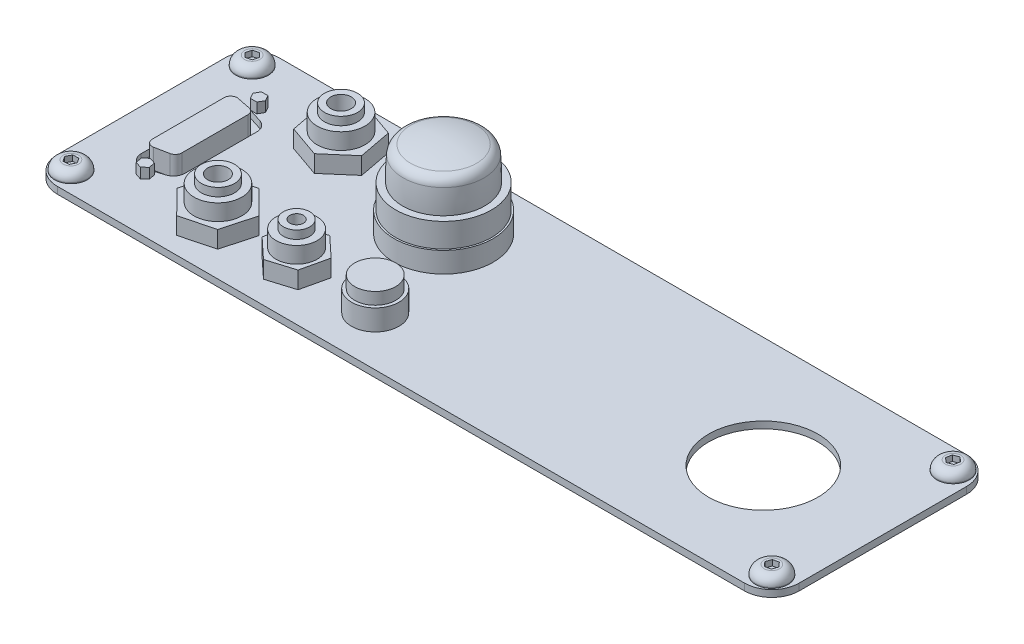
ISO-10303-21;
HEADER;
FILE_DESCRIPTION(('STEP AP214'),'2;1');
FILE_NAME('part.step','',(''),(''),'','','');
FILE_SCHEMA(('AUTOMOTIVE_DESIGN { 1 0 10303 214 1 1 1 1 }'));
ENDSEC;
DATA;
#1=APPLICATION_CONTEXT('core data for automotive mechanical design processes');
#2=APPLICATION_PROTOCOL_DEFINITION('international standard','automotive_design',2000,#1);
#3=PRODUCT_CONTEXT('',#1,'mechanical');
#4=PRODUCT('Part','Part','',(#3));
#5=PRODUCT_RELATED_PRODUCT_CATEGORY('part','',(#4));
#6=PRODUCT_DEFINITION_FORMATION('','',#4);
#7=PRODUCT_DEFINITION_CONTEXT('part definition',#1,'design');
#8=PRODUCT_DEFINITION('design','',#6,#7);
#9=PRODUCT_DEFINITION_SHAPE('','',#8);
#10=(LENGTH_UNIT() NAMED_UNIT(*) SI_UNIT(.MILLI.,.METRE.));
#11=(NAMED_UNIT(*) PLANE_ANGLE_UNIT() SI_UNIT($,.RADIAN.));
#12=(NAMED_UNIT(*) SI_UNIT($,.STERADIAN.) SOLID_ANGLE_UNIT());
#13=UNCERTAINTY_MEASURE_WITH_UNIT(LENGTH_MEASURE(1.E-05),#10,'distance_accuracy_value','');
#14=(GEOMETRIC_REPRESENTATION_CONTEXT(3) GLOBAL_UNCERTAINTY_ASSIGNED_CONTEXT((#13)) GLOBAL_UNIT_ASSIGNED_CONTEXT((#10,
#11,#12)) REPRESENTATION_CONTEXT('',''));
#15=CARTESIAN_POINT('',(0.,0.,0.));
#16=DIRECTION('',(0.,0.,1.));
#17=DIRECTION('',(1.,0.,0.));
#18=AXIS2_PLACEMENT_3D('',#15,#16,#17);
#19=CARTESIAN_POINT('',(-32.,-11.,-12.));
#20=DIRECTION('',(0.,0.,1.));
#21=DIRECTION('',(0.,-1.,0.));
#22=AXIS2_PLACEMENT_3D('',#19,#20,#21);
#23=SPHERICAL_SURFACE('',#22,35.);
#24=CARTESIAN_POINT('',(-32.,22.6431963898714,-12.));
#25=DIRECTION('',(0.,1.,0.));
#26=DIRECTION('',(0.,0.,1.));
#27=AXIS2_PLACEMENT_3D('',#24,#25,#26);
#28=CIRCLE('',#27,9.65066508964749);
#29=CARTESIAN_POINT('',(-32.,22.6431963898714,-2.3493349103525));
#30=VERTEX_POINT('',#29);
#31=EDGE_CURVE('E1081',#30,#30,#28,.F.);
#32=ORIENTED_EDGE('',*,*,#31,.F.);
#33=EDGE_LOOP('',(#32));
#34=FACE_BOUND('',#33,.T.);
#35=ADVANCED_FACE('F17',(#34),#23,.T.);
#36=CARTESIAN_POINT('',(-32.,19.7594938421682,-12.));
#37=DIRECTION('',(0.,1.,0.));
#38=DIRECTION('',(0.,0.,1.));
#39=AXIS2_PLACEMENT_3D('',#36,#37,#38);
#40=TOROIDAL_SURFACE('',#39,8.82346522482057,3.);
#41=CARTESIAN_POINT('',(-32.,20.0148533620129,-12.));
#42=DIRECTION('',(0.,1.,0.));
#43=DIRECTION('',(0.,0.,1.));
#44=AXIS2_PLACEMENT_3D('',#41,#42,#43);
#45=CIRCLE('',#44,11.8125773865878);
#46=CARTESIAN_POINT('',(-32.,20.0148533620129,-0.187422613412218));
#47=VERTEX_POINT('',#46);
#48=EDGE_CURVE('E1077',#47,#47,#45,.F.);
#49=ORIENTED_EDGE('',*,*,#48,.F.);
#50=EDGE_LOOP('',(#49));
#51=FACE_BOUND('',#50,.T.);
#52=ORIENTED_EDGE('',*,*,#31,.T.);
#53=EDGE_LOOP('',(#52));
#54=FACE_BOUND('',#53,.T.);
#55=ADVANCED_FACE('F1068',(#51,#54),#40,.T.);
#56=CARTESIAN_POINT('',(-32.,14.9076629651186,-59.9696658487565));
#57=DIRECTION('',(1.,0.,0.));
#58=DIRECTION('',(0.,0.,1.));
#59=AXIS2_PLACEMENT_3D('',#56,#57,#58);
#60=CIRCLE('',#59,60.);
#61=TRIMMED_CURVE('',#60,(PARAMETER_VALUE(-0.644343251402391)),
(PARAMETER_VALUE(0.64434325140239)),.T.,.PARAMETER.);
#62=CARTESIAN_POINT('',(-32.,14.9076629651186,-12.));
#63=DIRECTION('',(0.,1.,0.));
#64=AXIS1_PLACEMENT('',#62,#63);
#65=SURFACE_OF_REVOLUTION('',#61,#64);
#66=CARTESIAN_POINT('',(-32.,13.,-12.));
#67=DIRECTION('',(0.,1.,0.));
#68=DIRECTION('',(0.,0.,1.));
#69=AXIS2_PLACEMENT_3D('',#66,#67,#68);
#70=CIRCLE('',#69,12.);
#71=CARTESIAN_POINT('',(-32.,13.,0.));
#72=VERTEX_POINT('',#71);
#73=EDGE_CURVE('E1080',#72,#72,#70,.F.);
#74=ORIENTED_EDGE('',*,*,#73,.F.);
#75=EDGE_LOOP('',(#74));
#76=FACE_BOUND('',#75,.T.);
#77=ORIENTED_EDGE('',*,*,#48,.T.);
#78=EDGE_LOOP('',(#77));
#79=FACE_BOUND('',#78,.T.);
#80=ADVANCED_FACE('F1064',(#76,#79),#65,.F.);
#81=CARTESIAN_POINT('',(0.,1.1,0.));
#82=DIRECTION('',(0.,1.,0.));
#83=DIRECTION('',(0.,0.,1.));
#84=AXIS2_PLACEMENT_3D('',#81,#82,#83);
#85=PLANE('',#84);
#86=DIRECTION('',(-0.313288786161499,0.,0.949657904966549));
#87=VECTOR('',#86,1.);
#88=CARTESIAN_POINT('',(101.346829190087,1.1,25.207638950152));
#89=LINE('',#88,#87);
#90=CARTESIAN_POINT('',(101.346829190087,1.1,25.207638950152));
#91=VERTEX_POINT('',#90);
#92=CARTESIAN_POINT('',(100.804197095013,1.1,26.8524946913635));
#93=VERTEX_POINT('',#92);
#94=EDGE_CURVE('E2317',#91,#93,#89,.T.);
#95=ORIENTED_EDGE('',*,*,#94,.T.);
#96=DIRECTION('',(0.665783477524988,0.,0.746145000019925));
#97=VECTOR('',#96,1.);
#98=CARTESIAN_POINT('',(100.804197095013,1.1,26.8524946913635));
#99=LINE('',#98,#97);
#100=CARTESIAN_POINT('',(101.957367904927,1.1,28.1448557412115));
#101=VERTEX_POINT('',#100);
#102=EDGE_CURVE('E2322',#93,#101,#99,.T.);
#103=ORIENTED_EDGE('',*,*,#102,.T.);
#104=DIRECTION('',(0.979072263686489,0.,-0.203512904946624));
#105=VECTOR('',#104,1.);
#106=CARTESIAN_POINT('',(101.957367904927,1.1,28.1448557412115));
#107=LINE('',#106,#105);
#108=CARTESIAN_POINT('',(103.653170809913,1.1,27.792361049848));
#109=VERTEX_POINT('',#108);
#110=EDGE_CURVE('E1073',#101,#109,#107,.T.);
#111=ORIENTED_EDGE('',*,*,#110,.T.);
#112=DIRECTION('',(0.313288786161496,0.,-0.94965790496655));
#113=VECTOR('',#112,1.);
#114=CARTESIAN_POINT('',(103.653170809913,1.1,27.792361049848));
#115=LINE('',#114,#113);
#116=CARTESIAN_POINT('',(104.195802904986,1.1,26.1475053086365));
#117=VERTEX_POINT('',#116);
#118=EDGE_CURVE('E2295',#109,#117,#115,.T.);
#119=ORIENTED_EDGE('',*,*,#118,.T.);
#120=DIRECTION('',(-0.665783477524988,0.,-0.746145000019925));
#121=VECTOR('',#120,1.);
#122=CARTESIAN_POINT('',(104.195802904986,1.1,26.1475053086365));
#123=LINE('',#122,#121);
#124=CARTESIAN_POINT('',(103.042632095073,1.1,24.8551442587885));
#125=VERTEX_POINT('',#124);
#126=EDGE_CURVE('E2305',#117,#125,#123,.T.);
#127=ORIENTED_EDGE('',*,*,#126,.T.);
#128=DIRECTION('',(-0.97907226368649,0.,0.203512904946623));
#129=VECTOR('',#128,1.);
#130=CARTESIAN_POINT('',(103.042632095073,1.1,24.8551442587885));
#131=LINE('',#130,#129);
#132=EDGE_CURVE('E2311',#125,#91,#131,.T.);
#133=ORIENTED_EDGE('',*,*,#132,.T.);
#134=EDGE_LOOP('',(#95,#103,#111,#119,#127,#133));
#135=FACE_BOUND('',#134,.T.);
#136=ADVANCED_FACE('F1060',(#135),#85,.T.);
#137=CARTESIAN_POINT('',(0.,1.1,0.));
#138=DIRECTION('',(0.,1.,0.));
#139=DIRECTION('',(0.,0.,1.));
#140=AXIS2_PLACEMENT_3D('',#137,#138,#139);
#141=PLANE('',#140);
#142=DIRECTION('',(-0.16440184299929,0.,0.986393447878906));
#143=VECTOR('',#142,1.);
#144=CARTESIAN_POINT('',(101.162786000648,1.1,-27.6008445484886));
#145=LINE('',#144,#143);
#146=CARTESIAN_POINT('',(101.162786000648,1.1,-27.6008445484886));
#147=VERTEX_POINT('',#146);
#148=CARTESIAN_POINT('',(100.878033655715,1.1,-25.8923609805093));
#149=VERTEX_POINT('',#148);
#150=EDGE_CURVE('E2283',#147,#149,#145,.T.);
#151=ORIENTED_EDGE('',*,*,#150,.T.);
#152=DIRECTION('',(0.772040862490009,0.,0.63557289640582));
#153=VECTOR('',#152,1.);
#154=CARTESIAN_POINT('',(100.878033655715,1.1,-25.8923609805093));
#155=LINE('',#154,#153);
#156=CARTESIAN_POINT('',(102.215247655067,1.1,-24.7915164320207));
#157=VERTEX_POINT('',#156);
#158=EDGE_CURVE('E2289',#149,#157,#155,.T.);
#159=ORIENTED_EDGE('',*,*,#158,.T.);
#160=DIRECTION('',(0.936442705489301,0.,-0.350820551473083));
#161=VECTOR('',#160,1.);
#162=CARTESIAN_POINT('',(102.215247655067,1.1,-24.7915164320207));
#163=LINE('',#162,#161);
#164=CARTESIAN_POINT('',(103.837213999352,1.1,-25.3991554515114));
#165=VERTEX_POINT('',#164);
#166=EDGE_CURVE('E1459',#157,#165,#163,.T.);
#167=ORIENTED_EDGE('',*,*,#166,.T.);
#168=DIRECTION('',(0.16440184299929,0.,-0.986393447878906));
#169=VECTOR('',#168,1.);
#170=CARTESIAN_POINT('',(103.837213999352,1.1,-25.3991554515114));
#171=LINE('',#170,#169);
#172=CARTESIAN_POINT('',(104.121966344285,1.1,-27.1076390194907));
#173=VERTEX_POINT('',#172);
#174=EDGE_CURVE('E1468',#165,#173,#171,.T.);
#175=ORIENTED_EDGE('',*,*,#174,.T.);
#176=DIRECTION('',(-0.77204086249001,0.,-0.635572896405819));
#177=VECTOR('',#176,1.);
#178=CARTESIAN_POINT('',(104.121966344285,1.1,-27.1076390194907));
#179=LINE('',#178,#177);
#180=CARTESIAN_POINT('',(102.784752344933,1.1,-28.2084835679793));
#181=VERTEX_POINT('',#180);
#182=EDGE_CURVE('E1463',#173,#181,#179,.T.);
#183=ORIENTED_EDGE('',*,*,#182,.T.);
#184=DIRECTION('',(-0.9364427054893,0.,0.350820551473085));
#185=VECTOR('',#184,1.);
#186=CARTESIAN_POINT('',(102.784752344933,1.1,-28.2084835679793));
#187=LINE('',#186,#185);
#188=EDGE_CURVE('E1464',#181,#147,#187,.T.);
#189=ORIENTED_EDGE('',*,*,#188,.T.);
#190=EDGE_LOOP('',(#151,#159,#167,#175,#183,#189));
#191=FACE_BOUND('',#190,.T.);
#192=ADVANCED_FACE('F1056',(#191),#141,.T.);
#193=CARTESIAN_POINT('',(0.,1.1,0.));
#194=DIRECTION('',(0.,1.,0.));
#195=DIRECTION('',(0.,0.,1.));
#196=AXIS2_PLACEMENT_3D('',#193,#194,#195);
#197=PLANE('',#196);
#198=DIRECTION('',(-0.453909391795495,0.,0.891047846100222));
#199=VECTOR('',#198,1.);
#200=CARTESIAN_POINT('',(-103.443474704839,1.1,25.0474658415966));
#201=LINE('',#200,#199);
#202=CARTESIAN_POINT('',(-103.443474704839,1.1,25.0474658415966));
#203=VERTEX_POINT('',#202);
#204=CARTESIAN_POINT('',(-104.229668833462,1.1,26.590805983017));
#205=VERTEX_POINT('',#204);
#206=EDGE_CURVE('E1658',#203,#205,#201,.T.);
#207=ORIENTED_EDGE('',*,*,#206,.T.);
#208=DIRECTION('',(0.544715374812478,0.,0.838620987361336));
#209=VECTOR('',#208,1.);
#210=CARTESIAN_POINT('',(-104.229668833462,1.1,26.590805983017));
#211=LINE('',#210,#209);
#212=CARTESIAN_POINT('',(-103.286194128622,1.1,28.0433401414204));
#213=VERTEX_POINT('',#212);
#214=EDGE_CURVE('E1653',#205,#213,#211,.T.);
#215=ORIENTED_EDGE('',*,*,#214,.T.);
#216=DIRECTION('',(0.998624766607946,0.,-0.0524268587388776));
#217=VECTOR('',#216,1.);
#218=CARTESIAN_POINT('',(-103.286194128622,1.1,28.0433401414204));
#219=LINE('',#218,#217);
#220=CARTESIAN_POINT('',(-101.556525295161,1.1,27.9525341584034));
#221=VERTEX_POINT('',#220);
#222=EDGE_CURVE('E1480',#213,#221,#219,.T.);
#223=ORIENTED_EDGE('',*,*,#222,.T.);
#224=DIRECTION('',(0.453909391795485,0.,-0.891047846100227));
#225=VECTOR('',#224,1.);
#226=CARTESIAN_POINT('',(-101.556525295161,1.1,27.9525341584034));
#227=LINE('',#226,#225);
#228=CARTESIAN_POINT('',(-100.770331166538,1.1,26.409194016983));
#229=VERTEX_POINT('',#228);
#230=EDGE_CURVE('E1662',#221,#229,#227,.T.);
#231=ORIENTED_EDGE('',*,*,#230,.T.);
#232=DIRECTION('',(-0.544715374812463,0.,-0.838620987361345));
#233=VECTOR('',#232,1.);
#234=CARTESIAN_POINT('',(-100.770331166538,1.1,26.409194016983));
#235=LINE('',#234,#233);
#236=CARTESIAN_POINT('',(-101.713805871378,1.1,24.9566598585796));
#237=VERTEX_POINT('',#236);
#238=EDGE_CURVE('E1671',#229,#237,#235,.T.);
#239=ORIENTED_EDGE('',*,*,#238,.T.);
#240=DIRECTION('',(-0.998624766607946,0.,0.0524268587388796));
#241=VECTOR('',#240,1.);
#242=CARTESIAN_POINT('',(-101.713805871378,1.1,24.9566598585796));
#243=LINE('',#242,#241);
#244=EDGE_CURVE('E1680',#237,#203,#243,.T.);
#245=ORIENTED_EDGE('',*,*,#244,.T.);
#246=EDGE_LOOP('',(#207,#215,#223,#231,#239,#245));
#247=FACE_BOUND('',#246,.T.);
#248=ADVANCED_FACE('F1052',(#247),#197,.T.);
#249=CARTESIAN_POINT('',(0.,1.1,0.));
#250=DIRECTION('',(0.,1.,0.));
#251=DIRECTION('',(0.,0.,1.));
#252=AXIS2_PLACEMENT_3D('',#249,#250,#251);
#253=PLANE('',#252);
#254=DIRECTION('',(-0.246167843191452,0.,0.96922721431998));
#255=VECTOR('',#254,1.);
#256=CARTESIAN_POINT('',(-103.740653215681,1.1,-27.7086271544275));
#257=LINE('',#256,#255);
#258=CARTESIAN_POINT('',(-103.740653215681,1.1,-27.7086271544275));
#259=VERTEX_POINT('',#258);
#260=CARTESIAN_POINT('',(-104.167028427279,1.1,-26.0298763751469));
#261=VERTEX_POINT('',#260);
#262=EDGE_CURVE('E2254',#259,#261,#257,.T.);
#263=ORIENTED_EDGE('',*,*,#262,.T.);
#264=DIRECTION('',(0.716291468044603,0.,0.69780121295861));
#265=VECTOR('',#264,1.);
#266=CARTESIAN_POINT('',(-104.167028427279,1.1,-26.0298763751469));
#267=LINE('',#266,#265);
#268=CARTESIAN_POINT('',(-102.926375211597,1.1,-24.8212492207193));
#269=VERTEX_POINT('',#268);
#270=EDGE_CURVE('E2267',#261,#269,#267,.T.);
#271=ORIENTED_EDGE('',*,*,#270,.T.);
#272=DIRECTION('',(0.962459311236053,0.,-0.271426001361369));
#273=VECTOR('',#272,1.);
#274=CARTESIAN_POINT('',(-102.926375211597,1.1,-24.8212492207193));
#275=LINE('',#274,#273);
#276=CARTESIAN_POINT('',(-101.259346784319,1.1,-25.2913728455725));
#277=VERTEX_POINT('',#276);
#278=EDGE_CURVE('E1675',#269,#277,#275,.T.);
#279=ORIENTED_EDGE('',*,*,#278,.T.);
#280=DIRECTION('',(0.246167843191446,0.,-0.969227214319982));
#281=VECTOR('',#280,1.);
#282=CARTESIAN_POINT('',(-101.259346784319,1.1,-25.2913728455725));
#283=LINE('',#282,#281);
#284=CARTESIAN_POINT('',(-100.832971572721,1.1,-26.9701236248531));
#285=VERTEX_POINT('',#284);
#286=EDGE_CURVE('E2247',#277,#285,#283,.T.);
#287=ORIENTED_EDGE('',*,*,#286,.T.);
#288=DIRECTION('',(-0.716291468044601,0.,-0.697801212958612));
#289=VECTOR('',#288,1.);
#290=CARTESIAN_POINT('',(-100.832971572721,1.1,-26.9701236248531));
#291=LINE('',#290,#289);
#292=CARTESIAN_POINT('',(-102.073624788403,1.1,-28.1787507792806));
#293=VERTEX_POINT('',#292);
#294=EDGE_CURVE('E2242',#285,#293,#291,.T.);
#295=ORIENTED_EDGE('',*,*,#294,.T.);
#296=DIRECTION('',(-0.962459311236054,0.,0.271426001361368));
#297=VECTOR('',#296,1.);
#298=CARTESIAN_POINT('',(-102.073624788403,1.1,-28.1787507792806));
#299=LINE('',#298,#297);
#300=EDGE_CURVE('E2259',#293,#259,#299,.T.);
#301=ORIENTED_EDGE('',*,*,#300,.T.);
#302=EDGE_LOOP('',(#263,#271,#279,#287,#295,#301));
#303=FACE_BOUND('',#302,.T.);
#304=ADVANCED_FACE('F1048',(#303),#253,.T.);
#305=CARTESIAN_POINT('',(-32.,13.,-12.));
#306=DIRECTION('',(0.,1.,0.));
#307=DIRECTION('',(0.,0.,1.));
#308=AXIS2_PLACEMENT_3D('',#305,#306,#307);
#309=PLANE('',#308);
#310=CARTESIAN_POINT('',(-32.,13.,-12.));
#311=DIRECTION('',(0.,-1.,0.));
#312=DIRECTION('',(0.,0.,-1.));
#313=AXIS2_PLACEMENT_3D('',#310,#311,#312);
#314=CIRCLE('',#313,14.);
#315=CARTESIAN_POINT('',(-32.,13.,-26.));
#316=VERTEX_POINT('',#315);
#317=EDGE_CURVE('E1326',#316,#316,#314,.T.);
#318=ORIENTED_EDGE('',*,*,#317,.F.);
#319=EDGE_LOOP('',(#318));
#320=FACE_BOUND('',#319,.T.);
#321=ORIENTED_EDGE('',*,*,#73,.T.);
#322=EDGE_LOOP('',(#321));
#323=FACE_BOUND('',#322,.T.);
#324=ADVANCED_FACE('F1044',(#320,#323),#309,.T.);
#325=CARTESIAN_POINT('',(-22.,9.6,18.));
#326=DIRECTION('',(0.,1.,0.));
#327=DIRECTION('',(0.,0.,1.));
#328=AXIS2_PLACEMENT_3D('',#325,#326,#327);
#329=PLANE('',#328);
#330=CARTESIAN_POINT('',(-22.,9.6,18.));
#331=DIRECTION('',(0.,-1.,0.));
#332=DIRECTION('',(0.,0.,-1.));
#333=AXIS2_PLACEMENT_3D('',#330,#331,#332);
#334=CIRCLE('',#333,6.);
#335=CARTESIAN_POINT('',(-22.,9.6,12.));
#336=VERTEX_POINT('',#335);
#337=EDGE_CURVE('E1321',#336,#336,#334,.T.);
#338=ORIENTED_EDGE('',*,*,#337,.F.);
#339=EDGE_LOOP('',(#338));
#340=FACE_BOUND('',#339,.T.);
#341=ADVANCED_FACE('F1040',(#340),#329,.T.);
#342=CARTESIAN_POINT('',(101.957367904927,1.1,28.1448557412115));
#343=DIRECTION('',(0.203512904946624,0.,0.979072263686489));
#344=DIRECTION('',(0.979072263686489,0.,-0.203512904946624));
#345=AXIS2_PLACEMENT_3D('',#342,#343,#344);
#346=PLANE('',#345);
#347=DIRECTION('',(0.,1.,0.));
#348=VECTOR('',#347,1.);
#349=CARTESIAN_POINT('',(103.653170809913,1.1,27.792361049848));
#350=LINE('',#349,#348);
#351=CARTESIAN_POINT('',(103.653170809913,2.75,27.792361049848));
#352=VERTEX_POINT('',#351);
#353=EDGE_CURVE('E2298',#352,#109,#350,.F.);
#354=ORIENTED_EDGE('',*,*,#353,.T.);
#355=ORIENTED_EDGE('',*,*,#110,.F.);
#356=DIRECTION('',(0.,1.,0.));
#357=VECTOR('',#356,1.);
#358=CARTESIAN_POINT('',(101.957367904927,1.1,28.1448557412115));
#359=LINE('',#358,#357);
#360=CARTESIAN_POINT('',(101.957367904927,2.75,28.1448557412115));
#361=VERTEX_POINT('',#360);
#362=EDGE_CURVE('E2320',#101,#361,#359,.T.);
#363=ORIENTED_EDGE('',*,*,#362,.T.);
#364=DIRECTION('',(-0.97907226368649,0.,0.203512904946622));
#365=VECTOR('',#364,1.);
#366=CARTESIAN_POINT('',(103.653170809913,2.75,27.792361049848));
#367=LINE('',#366,#365);
#368=EDGE_CURVE('E1325',#352,#361,#367,.T.);
#369=ORIENTED_EDGE('',*,*,#368,.F.);
#370=EDGE_LOOP('',(#354,#355,#363,#369));
#371=FACE_BOUND('',#370,.T.);
#372=ADVANCED_FACE('F1036',(#371),#346,.F.);
#373=CARTESIAN_POINT('',(100.804197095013,1.1,26.8524946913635));
#374=DIRECTION('',(-0.746145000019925,0.,0.665783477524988));
#375=DIRECTION('',(0.665783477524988,0.,0.746145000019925));
#376=AXIS2_PLACEMENT_3D('',#373,#374,#375);
#377=PLANE('',#376);
#378=ORIENTED_EDGE('',*,*,#362,.F.);
#379=ORIENTED_EDGE('',*,*,#102,.F.);
#380=DIRECTION('',(0.,1.,0.));
#381=VECTOR('',#380,1.);
#382=CARTESIAN_POINT('',(100.804197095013,1.1,26.8524946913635));
#383=LINE('',#382,#381);
#384=CARTESIAN_POINT('',(100.804197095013,2.75,26.8524946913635));
#385=VERTEX_POINT('',#384);
#386=EDGE_CURVE('E2314',#93,#385,#383,.T.);
#387=ORIENTED_EDGE('',*,*,#386,.T.);
#388=DIRECTION('',(-0.665783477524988,0.,-0.746145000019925));
#389=VECTOR('',#388,1.);
#390=CARTESIAN_POINT('',(101.957367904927,2.75,28.1448557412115));
#391=LINE('',#390,#389);
#392=EDGE_CURVE('E2353',#361,#385,#391,.T.);
#393=ORIENTED_EDGE('',*,*,#392,.F.);
#394=EDGE_LOOP('',(#378,#379,#387,#393));
#395=FACE_BOUND('',#394,.T.);
#396=ADVANCED_FACE('F1032',(#395),#377,.F.);
#397=CARTESIAN_POINT('',(101.346829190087,1.1,25.207638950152));
#398=DIRECTION('',(-0.949657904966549,0.,-0.313288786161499));
#399=DIRECTION('',(-0.313288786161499,0.,0.949657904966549));
#400=AXIS2_PLACEMENT_3D('',#397,#398,#399);
#401=PLANE('',#400);
#402=ORIENTED_EDGE('',*,*,#386,.F.);
#403=ORIENTED_EDGE('',*,*,#94,.F.);
#404=DIRECTION('',(0.,1.,0.));
#405=VECTOR('',#404,1.);
#406=CARTESIAN_POINT('',(101.346829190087,1.1,25.207638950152));
#407=LINE('',#406,#405);
#408=CARTESIAN_POINT('',(101.346829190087,2.75,25.207638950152));
#409=VERTEX_POINT('',#408);
#410=EDGE_CURVE('E2308',#91,#409,#407,.T.);
#411=ORIENTED_EDGE('',*,*,#410,.T.);
#412=DIRECTION('',(0.313288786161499,0.,-0.949657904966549));
#413=VECTOR('',#412,1.);
#414=CARTESIAN_POINT('',(100.804197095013,2.75,26.8524946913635));
#415=LINE('',#414,#413);
#416=EDGE_CURVE('E2350',#385,#409,#415,.T.);
#417=ORIENTED_EDGE('',*,*,#416,.F.);
#418=EDGE_LOOP('',(#402,#403,#411,#417));
#419=FACE_BOUND('',#418,.T.);
#420=ADVANCED_FACE('F1028',(#419),#401,.F.);
#421=CARTESIAN_POINT('',(103.042632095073,1.1,24.8551442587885));
#422=DIRECTION('',(-0.203512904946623,0.,-0.97907226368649));
#423=DIRECTION('',(-0.97907226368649,0.,0.203512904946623));
#424=AXIS2_PLACEMENT_3D('',#421,#422,#423);
#425=PLANE('',#424);
#426=ORIENTED_EDGE('',*,*,#410,.F.);
#427=ORIENTED_EDGE('',*,*,#132,.F.);
#428=DIRECTION('',(0.,1.,0.));
#429=VECTOR('',#428,1.);
#430=CARTESIAN_POINT('',(103.042632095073,1.1,24.8551442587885));
#431=LINE('',#430,#429);
#432=CARTESIAN_POINT('',(103.042632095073,2.75,24.8551442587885));
#433=VERTEX_POINT('',#432);
#434=EDGE_CURVE('E2302',#125,#433,#431,.T.);
#435=ORIENTED_EDGE('',*,*,#434,.T.);
#436=DIRECTION('',(0.97907226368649,0.,-0.203512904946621));
#437=VECTOR('',#436,1.);
#438=CARTESIAN_POINT('',(101.346829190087,2.75,25.207638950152));
#439=LINE('',#438,#437);
#440=EDGE_CURVE('E2346',#409,#433,#439,.T.);
#441=ORIENTED_EDGE('',*,*,#440,.F.);
#442=EDGE_LOOP('',(#426,#427,#435,#441));
#443=FACE_BOUND('',#442,.T.);
#444=ADVANCED_FACE('F1024',(#443),#425,.F.);
#445=CARTESIAN_POINT('',(104.195802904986,1.1,26.1475053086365));
#446=DIRECTION('',(0.746145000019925,0.,-0.665783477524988));
#447=DIRECTION('',(-0.665783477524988,0.,-0.746145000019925));
#448=AXIS2_PLACEMENT_3D('',#445,#446,#447);
#449=PLANE('',#448);
#450=ORIENTED_EDGE('',*,*,#434,.F.);
#451=ORIENTED_EDGE('',*,*,#126,.F.);
#452=DIRECTION('',(0.,1.,0.));
#453=VECTOR('',#452,1.);
#454=CARTESIAN_POINT('',(104.195802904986,1.1,26.1475053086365));
#455=LINE('',#454,#453);
#456=CARTESIAN_POINT('',(104.195802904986,2.75,26.1475053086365));
#457=VERTEX_POINT('',#456);
#458=EDGE_CURVE('E2292',#117,#457,#455,.T.);
#459=ORIENTED_EDGE('',*,*,#458,.T.);
#460=DIRECTION('',(0.665783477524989,0.,0.746145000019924));
#461=VECTOR('',#460,1.);
#462=CARTESIAN_POINT('',(103.042632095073,2.75,24.8551442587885));
#463=LINE('',#462,#461);
#464=EDGE_CURVE('E2340',#433,#457,#463,.T.);
#465=ORIENTED_EDGE('',*,*,#464,.F.);
#466=EDGE_LOOP('',(#450,#451,#459,#465));
#467=FACE_BOUND('',#466,.T.);
#468=ADVANCED_FACE('F1020',(#467),#449,.F.);
#469=CARTESIAN_POINT('',(103.653170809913,1.1,27.792361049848));
#470=DIRECTION('',(0.94965790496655,0.,0.313288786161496));
#471=DIRECTION('',(0.313288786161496,0.,-0.94965790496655));
#472=AXIS2_PLACEMENT_3D('',#469,#470,#471);
#473=PLANE('',#472);
#474=ORIENTED_EDGE('',*,*,#458,.F.);
#475=ORIENTED_EDGE('',*,*,#118,.F.);
#476=ORIENTED_EDGE('',*,*,#353,.F.);
#477=DIRECTION('',(-0.313288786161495,0.,0.94965790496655));
#478=VECTOR('',#477,1.);
#479=CARTESIAN_POINT('',(104.195802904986,2.75,26.1475053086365));
#480=LINE('',#479,#478);
#481=EDGE_CURVE('E921',#457,#352,#480,.T.);
#482=ORIENTED_EDGE('',*,*,#481,.F.);
#483=EDGE_LOOP('',(#474,#475,#476,#482));
#484=FACE_BOUND('',#483,.T.);
#485=ADVANCED_FACE('F1016',(#484),#473,.F.);
#486=CARTESIAN_POINT('',(102.215247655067,1.1,-24.7915164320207));
#487=DIRECTION('',(0.350820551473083,0.,0.936442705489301));
#488=DIRECTION('',(0.936442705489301,0.,-0.350820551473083));
#489=AXIS2_PLACEMENT_3D('',#486,#487,#488);
#490=PLANE('',#489);
#491=DIRECTION('',(0.,1.,0.));
#492=VECTOR('',#491,1.);
#493=CARTESIAN_POINT('',(103.837213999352,1.1,-25.3991554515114));
#494=LINE('',#493,#492);
#495=CARTESIAN_POINT('',(103.837213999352,2.75,-25.3991554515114));
#496=VERTEX_POINT('',#495);
#497=EDGE_CURVE('E1466',#496,#165,#494,.F.);
#498=ORIENTED_EDGE('',*,*,#497,.T.);
#499=ORIENTED_EDGE('',*,*,#166,.F.);
#500=DIRECTION('',(0.,1.,0.));
#501=VECTOR('',#500,1.);
#502=CARTESIAN_POINT('',(102.215247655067,1.1,-24.7915164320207));
#503=LINE('',#502,#501);
#504=CARTESIAN_POINT('',(102.215247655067,2.75,-24.7915164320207));
#505=VERTEX_POINT('',#504);
#506=EDGE_CURVE('E2286',#157,#505,#503,.T.);
#507=ORIENTED_EDGE('',*,*,#506,.T.);
#508=DIRECTION('',(-0.936442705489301,0.,0.350820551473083));
#509=VECTOR('',#508,1.);
#510=CARTESIAN_POINT('',(103.837213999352,2.75,-25.3991554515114));
#511=LINE('',#510,#509);
#512=EDGE_CURVE('E1447',#496,#505,#511,.T.);
#513=ORIENTED_EDGE('',*,*,#512,.F.);
#514=EDGE_LOOP('',(#498,#499,#507,#513));
#515=FACE_BOUND('',#514,.T.);
#516=ADVANCED_FACE('F1012',(#515),#490,.F.);
#517=CARTESIAN_POINT('',(100.878033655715,1.1,-25.8923609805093));
#518=DIRECTION('',(-0.63557289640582,0.,0.772040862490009));
#519=DIRECTION('',(0.772040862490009,0.,0.63557289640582));
#520=AXIS2_PLACEMENT_3D('',#517,#518,#519);
#521=PLANE('',#520);
#522=ORIENTED_EDGE('',*,*,#506,.F.);
#523=ORIENTED_EDGE('',*,*,#158,.F.);
#524=DIRECTION('',(0.,1.,0.));
#525=VECTOR('',#524,1.);
#526=CARTESIAN_POINT('',(100.878033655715,1.1,-25.8923609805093));
#527=LINE('',#526,#525);
#528=CARTESIAN_POINT('',(100.878033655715,2.75,-25.8923609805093));
#529=VERTEX_POINT('',#528);
#530=EDGE_CURVE('E1473',#149,#529,#527,.T.);
#531=ORIENTED_EDGE('',*,*,#530,.T.);
#532=DIRECTION('',(-0.772040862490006,0.,-0.635572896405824));
#533=VECTOR('',#532,1.);
#534=CARTESIAN_POINT('',(102.215247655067,2.75,-24.7915164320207));
#535=LINE('',#534,#533);
#536=EDGE_CURVE('E1443',#505,#529,#535,.T.);
#537=ORIENTED_EDGE('',*,*,#536,.F.);
#538=EDGE_LOOP('',(#522,#523,#531,#537));
#539=FACE_BOUND('',#538,.T.);
#540=ADVANCED_FACE('F1008',(#539),#521,.F.);
#541=CARTESIAN_POINT('',(101.162786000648,1.1,-27.6008445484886));
#542=DIRECTION('',(-0.986393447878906,0.,-0.16440184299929));
#543=DIRECTION('',(-0.16440184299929,0.,0.986393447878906));
#544=AXIS2_PLACEMENT_3D('',#541,#542,#543);
#545=PLANE('',#544);
#546=ORIENTED_EDGE('',*,*,#530,.F.);
#547=ORIENTED_EDGE('',*,*,#150,.F.);
#548=DIRECTION('',(0.,1.,0.));
#549=VECTOR('',#548,1.);
#550=CARTESIAN_POINT('',(101.162786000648,1.1,-27.6008445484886));
#551=LINE('',#550,#549);
#552=CARTESIAN_POINT('',(101.162786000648,2.75,-27.6008445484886));
#553=VERTEX_POINT('',#552);
#554=EDGE_CURVE('E1461',#147,#553,#551,.T.);
#555=ORIENTED_EDGE('',*,*,#554,.T.);
#556=DIRECTION('',(0.164401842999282,0.,-0.986393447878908));
#557=VECTOR('',#556,1.);
#558=CARTESIAN_POINT('',(100.878033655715,2.75,-25.8923609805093));
#559=LINE('',#558,#557);
#560=EDGE_CURVE('E1439',#529,#553,#559,.T.);
#561=ORIENTED_EDGE('',*,*,#560,.F.);
#562=EDGE_LOOP('',(#546,#547,#555,#561));
#563=FACE_BOUND('',#562,.T.);
#564=ADVANCED_FACE('F1004',(#563),#545,.F.);
#565=CARTESIAN_POINT('',(102.784752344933,1.1,-28.2084835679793));
#566=DIRECTION('',(-0.350820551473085,0.,-0.9364427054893));
#567=DIRECTION('',(-0.9364427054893,0.,0.350820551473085));
#568=AXIS2_PLACEMENT_3D('',#565,#566,#567);
#569=PLANE('',#568);
#570=ORIENTED_EDGE('',*,*,#554,.F.);
#571=ORIENTED_EDGE('',*,*,#188,.F.);
#572=DIRECTION('',(0.,1.,0.));
#573=VECTOR('',#572,1.);
#574=CARTESIAN_POINT('',(102.784752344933,1.1,-28.2084835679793));
#575=LINE('',#574,#573);
#576=CARTESIAN_POINT('',(102.784752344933,2.75,-28.2084835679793));
#577=VERTEX_POINT('',#576);
#578=EDGE_CURVE('E1469',#181,#577,#575,.T.);
#579=ORIENTED_EDGE('',*,*,#578,.T.);
#580=DIRECTION('',(0.936442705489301,0.,-0.350820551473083));
#581=VECTOR('',#580,1.);
#582=CARTESIAN_POINT('',(101.162786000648,2.75,-27.6008445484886));
#583=LINE('',#582,#581);
#584=EDGE_CURVE('E1435',#553,#577,#583,.T.);
#585=ORIENTED_EDGE('',*,*,#584,.F.);
#586=EDGE_LOOP('',(#570,#571,#579,#585));
#587=FACE_BOUND('',#586,.T.);
#588=ADVANCED_FACE('F1000',(#587),#569,.F.);
#589=CARTESIAN_POINT('',(104.121966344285,1.1,-27.1076390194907));
#590=DIRECTION('',(0.635572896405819,0.,-0.77204086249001));
#591=DIRECTION('',(-0.77204086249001,0.,-0.635572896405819));
#592=AXIS2_PLACEMENT_3D('',#589,#590,#591);
#593=PLANE('',#592);
#594=ORIENTED_EDGE('',*,*,#578,.F.);
#595=ORIENTED_EDGE('',*,*,#182,.F.);
#596=DIRECTION('',(0.,1.,0.));
#597=VECTOR('',#596,1.);
#598=CARTESIAN_POINT('',(104.121966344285,1.1,-27.1076390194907));
#599=LINE('',#598,#597);
#600=CARTESIAN_POINT('',(104.121966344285,2.75,-27.1076390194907));
#601=VERTEX_POINT('',#600);
#602=EDGE_CURVE('E1479',#173,#601,#599,.T.);
#603=ORIENTED_EDGE('',*,*,#602,.T.);
#604=DIRECTION('',(0.77204086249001,0.,0.635572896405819));
#605=VECTOR('',#604,1.);
#606=CARTESIAN_POINT('',(102.784752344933,2.75,-28.2084835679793));
#607=LINE('',#606,#605);
#608=EDGE_CURVE('E1431',#577,#601,#607,.T.);
#609=ORIENTED_EDGE('',*,*,#608,.F.);
#610=EDGE_LOOP('',(#594,#595,#603,#609));
#611=FACE_BOUND('',#610,.T.);
#612=ADVANCED_FACE('F996',(#611),#593,.F.);
#613=CARTESIAN_POINT('',(103.837213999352,1.1,-25.3991554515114));
#614=DIRECTION('',(0.986393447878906,0.,0.16440184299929));
#615=DIRECTION('',(0.16440184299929,0.,-0.986393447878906));
#616=AXIS2_PLACEMENT_3D('',#613,#614,#615);
#617=PLANE('',#616);
#618=ORIENTED_EDGE('',*,*,#602,.F.);
#619=ORIENTED_EDGE('',*,*,#174,.F.);
#620=ORIENTED_EDGE('',*,*,#497,.F.);
#621=DIRECTION('',(-0.16440184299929,0.,0.986393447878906));
#622=VECTOR('',#621,1.);
#623=CARTESIAN_POINT('',(104.121966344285,2.75,-27.1076390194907));
#624=LINE('',#623,#622);
#625=EDGE_CURVE('E1397',#601,#496,#624,.T.);
#626=ORIENTED_EDGE('',*,*,#625,.F.);
#627=EDGE_LOOP('',(#618,#619,#620,#626));
#628=FACE_BOUND('',#627,.T.);
#629=ADVANCED_FACE('F992',(#628),#617,.F.);
#630=CARTESIAN_POINT('',(-103.286194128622,1.1,28.0433401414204));
#631=DIRECTION('',(0.0524268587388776,0.,0.998624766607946));
#632=DIRECTION('',(0.998624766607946,0.,-0.0524268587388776));
#633=AXIS2_PLACEMENT_3D('',#630,#631,#632);
#634=PLANE('',#633);
#635=DIRECTION('',(0.,1.,0.));
#636=VECTOR('',#635,1.);
#637=CARTESIAN_POINT('',(-101.556525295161,1.1,27.9525341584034));
#638=LINE('',#637,#636);
#639=CARTESIAN_POINT('',(-101.556525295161,2.75,27.9525341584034));
#640=VERTEX_POINT('',#639);
#641=EDGE_CURVE('E1665',#640,#221,#638,.F.);
#642=ORIENTED_EDGE('',*,*,#641,.T.);
#643=ORIENTED_EDGE('',*,*,#222,.F.);
#644=DIRECTION('',(0.,1.,0.));
#645=VECTOR('',#644,1.);
#646=CARTESIAN_POINT('',(-103.286194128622,1.1,28.0433401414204));
#647=LINE('',#646,#645);
#648=CARTESIAN_POINT('',(-103.286194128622,2.75,28.0433401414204));
#649=VERTEX_POINT('',#648);
#650=EDGE_CURVE('E1655',#213,#649,#647,.T.);
#651=ORIENTED_EDGE('',*,*,#650,.T.);
#652=DIRECTION('',(-0.998624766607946,0.,0.0524268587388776));
#653=VECTOR('',#652,1.);
#654=CARTESIAN_POINT('',(-101.556525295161,2.75,27.9525341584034));
#655=LINE('',#654,#653);
#656=EDGE_CURVE('E1394',#640,#649,#655,.T.);
#657=ORIENTED_EDGE('',*,*,#656,.F.);
#658=EDGE_LOOP('',(#642,#643,#651,#657));
#659=FACE_BOUND('',#658,.T.);
#660=ADVANCED_FACE('F988',(#659),#634,.F.);
#661=CARTESIAN_POINT('',(-104.229668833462,1.1,26.590805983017));
#662=DIRECTION('',(-0.838620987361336,0.,0.544715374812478));
#663=DIRECTION('',(0.544715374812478,0.,0.838620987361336));
#664=AXIS2_PLACEMENT_3D('',#661,#662,#663);
#665=PLANE('',#664);
#666=ORIENTED_EDGE('',*,*,#650,.F.);
#667=ORIENTED_EDGE('',*,*,#214,.F.);
#668=DIRECTION('',(0.,1.,0.));
#669=VECTOR('',#668,1.);
#670=CARTESIAN_POINT('',(-104.229668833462,1.1,26.590805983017));
#671=LINE('',#670,#669);
#672=CARTESIAN_POINT('',(-104.229668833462,2.75,26.590805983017));
#673=VERTEX_POINT('',#672);
#674=EDGE_CURVE('E1678',#205,#673,#671,.T.);
#675=ORIENTED_EDGE('',*,*,#674,.T.);
#676=DIRECTION('',(-0.544715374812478,0.,-0.838620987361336));
#677=VECTOR('',#676,1.);
#678=CARTESIAN_POINT('',(-103.286194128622,2.75,28.0433401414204));
#679=LINE('',#678,#677);
#680=EDGE_CURVE('E1390',#649,#673,#679,.T.);
#681=ORIENTED_EDGE('',*,*,#680,.F.);
#682=EDGE_LOOP('',(#666,#667,#675,#681));
#683=FACE_BOUND('',#682,.T.);
#684=ADVANCED_FACE('F984',(#683),#665,.F.);
#685=CARTESIAN_POINT('',(-103.443474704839,1.1,25.0474658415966));
#686=DIRECTION('',(-0.891047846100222,0.,-0.453909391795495));
#687=DIRECTION('',(-0.453909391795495,0.,0.891047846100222));
#688=AXIS2_PLACEMENT_3D('',#685,#686,#687);
#689=PLANE('',#688);
#690=ORIENTED_EDGE('',*,*,#674,.F.);
#691=ORIENTED_EDGE('',*,*,#206,.F.);
#692=DIRECTION('',(0.,1.,0.));
#693=VECTOR('',#692,1.);
#694=CARTESIAN_POINT('',(-103.443474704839,1.1,25.0474658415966));
#695=LINE('',#694,#693);
#696=CARTESIAN_POINT('',(-103.443474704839,2.75,25.0474658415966));
#697=VERTEX_POINT('',#696);
#698=EDGE_CURVE('E1673',#203,#697,#695,.T.);
#699=ORIENTED_EDGE('',*,*,#698,.T.);
#700=DIRECTION('',(0.453909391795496,0.,-0.891047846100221));
#701=VECTOR('',#700,1.);
#702=CARTESIAN_POINT('',(-104.229668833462,2.75,26.590805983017));
#703=LINE('',#702,#701);
#704=EDGE_CURVE('E1386',#673,#697,#703,.T.);
#705=ORIENTED_EDGE('',*,*,#704,.F.);
#706=EDGE_LOOP('',(#690,#691,#699,#705));
#707=FACE_BOUND('',#706,.T.);
#708=ADVANCED_FACE('F980',(#707),#689,.F.);
#709=CARTESIAN_POINT('',(-101.713805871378,1.1,24.9566598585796));
#710=DIRECTION('',(-0.0524268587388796,0.,-0.998624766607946));
#711=DIRECTION('',(-0.998624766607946,0.,0.0524268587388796));
#712=AXIS2_PLACEMENT_3D('',#709,#710,#711);
#713=PLANE('',#712);
#714=ORIENTED_EDGE('',*,*,#698,.F.);
#715=ORIENTED_EDGE('',*,*,#244,.F.);
#716=DIRECTION('',(0.,1.,0.));
#717=VECTOR('',#716,1.);
#718=CARTESIAN_POINT('',(-101.713805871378,1.1,24.9566598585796));
#719=LINE('',#718,#717);
#720=CARTESIAN_POINT('',(-101.713805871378,2.75,24.9566598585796));
#721=VERTEX_POINT('',#720);
#722=EDGE_CURVE('E1669',#237,#721,#719,.T.);
#723=ORIENTED_EDGE('',*,*,#722,.T.);
#724=DIRECTION('',(0.998624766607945,0.,-0.0524268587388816));
#725=VECTOR('',#724,1.);
#726=CARTESIAN_POINT('',(-103.443474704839,2.75,25.0474658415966));
#727=LINE('',#726,#725);
#728=EDGE_CURVE('E1382',#697,#721,#727,.T.);
#729=ORIENTED_EDGE('',*,*,#728,.F.);
#730=EDGE_LOOP('',(#714,#715,#723,#729));
#731=FACE_BOUND('',#730,.T.);
#732=ADVANCED_FACE('F976',(#731),#713,.F.);
#733=CARTESIAN_POINT('',(-100.770331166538,1.1,26.409194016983));
#734=DIRECTION('',(0.838620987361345,0.,-0.544715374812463));
#735=DIRECTION('',(-0.544715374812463,0.,-0.838620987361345));
#736=AXIS2_PLACEMENT_3D('',#733,#734,#735);
#737=PLANE('',#736);
#738=ORIENTED_EDGE('',*,*,#722,.F.);
#739=ORIENTED_EDGE('',*,*,#238,.F.);
#740=DIRECTION('',(0.,1.,0.));
#741=VECTOR('',#740,1.);
#742=CARTESIAN_POINT('',(-100.770331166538,1.1,26.409194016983));
#743=LINE('',#742,#741);
#744=CARTESIAN_POINT('',(-100.770331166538,2.75,26.409194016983));
#745=VERTEX_POINT('',#744);
#746=EDGE_CURVE('E1664',#229,#745,#743,.T.);
#747=ORIENTED_EDGE('',*,*,#746,.T.);
#748=DIRECTION('',(0.544715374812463,0.,0.838620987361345));
#749=VECTOR('',#748,1.);
#750=CARTESIAN_POINT('',(-101.713805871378,2.75,24.9566598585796));
#751=LINE('',#750,#749);
#752=EDGE_CURVE('E1378',#721,#745,#751,.T.);
#753=ORIENTED_EDGE('',*,*,#752,.F.);
#754=EDGE_LOOP('',(#738,#739,#747,#753));
#755=FACE_BOUND('',#754,.T.);
#756=ADVANCED_FACE('F972',(#755),#737,.F.);
#757=CARTESIAN_POINT('',(-101.556525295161,1.1,27.9525341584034));
#758=DIRECTION('',(0.891047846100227,0.,0.453909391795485));
#759=DIRECTION('',(0.453909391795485,0.,-0.891047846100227));
#760=AXIS2_PLACEMENT_3D('',#757,#758,#759);
#761=PLANE('',#760);
#762=ORIENTED_EDGE('',*,*,#746,.F.);
#763=ORIENTED_EDGE('',*,*,#230,.F.);
#764=ORIENTED_EDGE('',*,*,#641,.F.);
#765=DIRECTION('',(-0.453909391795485,0.,0.891047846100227));
#766=VECTOR('',#765,1.);
#767=CARTESIAN_POINT('',(-100.770331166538,2.75,26.409194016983));
#768=LINE('',#767,#766);
#769=EDGE_CURVE('E830',#745,#640,#768,.T.);
#770=ORIENTED_EDGE('',*,*,#769,.F.);
#771=EDGE_LOOP('',(#762,#763,#764,#770));
#772=FACE_BOUND('',#771,.T.);
#773=ADVANCED_FACE('F968',(#772),#761,.F.);
#774=CARTESIAN_POINT('',(-102.926375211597,1.1,-24.8212492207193));
#775=DIRECTION('',(0.271426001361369,0.,0.962459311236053));
#776=DIRECTION('',(0.962459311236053,0.,-0.271426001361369));
#777=AXIS2_PLACEMENT_3D('',#774,#775,#776);
#778=PLANE('',#777);
#779=DIRECTION('',(0.,1.,0.));
#780=VECTOR('',#779,1.);
#781=CARTESIAN_POINT('',(-101.259346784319,1.1,-25.2913728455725));
#782=LINE('',#781,#780);
#783=CARTESIAN_POINT('',(-101.259346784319,2.75,-25.2913728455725));
#784=VERTEX_POINT('',#783);
#785=EDGE_CURVE('E2249',#784,#277,#782,.F.);
#786=ORIENTED_EDGE('',*,*,#785,.T.);
#787=ORIENTED_EDGE('',*,*,#278,.F.);
#788=DIRECTION('',(0.,1.,0.));
#789=VECTOR('',#788,1.);
#790=CARTESIAN_POINT('',(-102.926375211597,1.1,-24.8212492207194));
#791=LINE('',#790,#789);
#792=CARTESIAN_POINT('',(-102.926375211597,2.75,-24.8212492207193));
#793=VERTEX_POINT('',#792);
#794=EDGE_CURVE('E2257',#269,#793,#791,.T.);
#795=ORIENTED_EDGE('',*,*,#794,.T.);
#796=DIRECTION('',(-0.962459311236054,0.,0.271426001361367));
#797=VECTOR('',#796,1.);
#798=CARTESIAN_POINT('',(-101.259346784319,2.75,-25.2913728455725));
#799=LINE('',#798,#797);
#800=EDGE_CURVE('E826',#784,#793,#799,.T.);
#801=ORIENTED_EDGE('',*,*,#800,.F.);
#802=EDGE_LOOP('',(#786,#787,#795,#801));
#803=FACE_BOUND('',#802,.T.);
#804=ADVANCED_FACE('F964',(#803),#778,.F.);
#805=CARTESIAN_POINT('',(-104.167028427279,1.1,-26.0298763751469));
#806=DIRECTION('',(-0.69780121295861,0.,0.716291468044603));
#807=DIRECTION('',(0.716291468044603,0.,0.69780121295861));
#808=AXIS2_PLACEMENT_3D('',#805,#806,#807);
#809=PLANE('',#808);
#810=ORIENTED_EDGE('',*,*,#794,.F.);
#811=ORIENTED_EDGE('',*,*,#270,.F.);
#812=DIRECTION('',(0.,1.,0.));
#813=VECTOR('',#812,1.);
#814=CARTESIAN_POINT('',(-104.167028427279,1.1,-26.0298763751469));
#815=LINE('',#814,#813);
#816=CARTESIAN_POINT('',(-104.167028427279,2.75,-26.0298763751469));
#817=VERTEX_POINT('',#816);
#818=EDGE_CURVE('E2256',#261,#817,#815,.T.);
#819=ORIENTED_EDGE('',*,*,#818,.T.);
#820=DIRECTION('',(-0.7162914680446,0.,-0.697801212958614));
#821=VECTOR('',#820,1.);
#822=CARTESIAN_POINT('',(-102.926375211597,2.75,-24.8212492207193));
#823=LINE('',#822,#821);
#824=EDGE_CURVE('E822',#793,#817,#823,.T.);
#825=ORIENTED_EDGE('',*,*,#824,.F.);
#826=EDGE_LOOP('',(#810,#811,#819,#825));
#827=FACE_BOUND('',#826,.T.);
#828=ADVANCED_FACE('F960',(#827),#809,.F.);
#829=CARTESIAN_POINT('',(-103.740653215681,1.1,-27.7086271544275));
#830=DIRECTION('',(-0.96922721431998,0.,-0.246167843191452));
#831=DIRECTION('',(-0.246167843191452,0.,0.96922721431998));
#832=AXIS2_PLACEMENT_3D('',#829,#830,#831);
#833=PLANE('',#832);
#834=ORIENTED_EDGE('',*,*,#818,.F.);
#835=ORIENTED_EDGE('',*,*,#262,.F.);
#836=DIRECTION('',(0.,1.,0.));
#837=VECTOR('',#836,1.);
#838=CARTESIAN_POINT('',(-103.740653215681,1.1,-27.7086271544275));
#839=LINE('',#838,#837);
#840=CARTESIAN_POINT('',(-103.740653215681,2.75,-27.7086271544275));
#841=VERTEX_POINT('',#840);
#842=EDGE_CURVE('E2245',#259,#841,#839,.T.);
#843=ORIENTED_EDGE('',*,*,#842,.T.);
#844=DIRECTION('',(0.246167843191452,0.,-0.96922721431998));
#845=VECTOR('',#844,1.);
#846=CARTESIAN_POINT('',(-104.167028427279,2.75,-26.0298763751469));
#847=LINE('',#846,#845);
#848=EDGE_CURVE('E818',#817,#841,#847,.T.);
#849=ORIENTED_EDGE('',*,*,#848,.F.);
#850=EDGE_LOOP('',(#834,#835,#843,#849));
#851=FACE_BOUND('',#850,.T.);
#852=ADVANCED_FACE('F956',(#851),#833,.F.);
#853=CARTESIAN_POINT('',(-102.073624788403,1.1,-28.1787507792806));
#854=DIRECTION('',(-0.271426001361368,0.,-0.962459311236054));
#855=DIRECTION('',(-0.962459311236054,0.,0.271426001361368));
#856=AXIS2_PLACEMENT_3D('',#853,#854,#855);
#857=PLANE('',#856);
#858=ORIENTED_EDGE('',*,*,#842,.F.);
#859=ORIENTED_EDGE('',*,*,#300,.F.);
#860=DIRECTION('',(0.,1.,0.));
#861=VECTOR('',#860,1.);
#862=CARTESIAN_POINT('',(-102.073624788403,1.1,-28.1787507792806));
#863=LINE('',#862,#861);
#864=CARTESIAN_POINT('',(-102.073624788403,2.75,-28.1787507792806));
#865=VERTEX_POINT('',#864);
#866=EDGE_CURVE('E2244',#293,#865,#863,.T.);
#867=ORIENTED_EDGE('',*,*,#866,.T.);
#868=DIRECTION('',(0.962459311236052,0.,-0.271426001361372));
#869=VECTOR('',#868,1.);
#870=CARTESIAN_POINT('',(-103.740653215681,2.75,-27.7086271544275));
#871=LINE('',#870,#869);
#872=EDGE_CURVE('E814',#841,#865,#871,.T.);
#873=ORIENTED_EDGE('',*,*,#872,.F.);
#874=EDGE_LOOP('',(#858,#859,#867,#873));
#875=FACE_BOUND('',#874,.T.);
#876=ADVANCED_FACE('F952',(#875),#857,.F.);
#877=CARTESIAN_POINT('',(-100.832971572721,1.1,-26.9701236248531));
#878=DIRECTION('',(0.697801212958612,0.,-0.716291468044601));
#879=DIRECTION('',(-0.716291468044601,0.,-0.697801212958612));
#880=AXIS2_PLACEMENT_3D('',#877,#878,#879);
#881=PLANE('',#880);
#882=ORIENTED_EDGE('',*,*,#866,.F.);
#883=ORIENTED_EDGE('',*,*,#294,.F.);
#884=DIRECTION('',(0.,1.,0.));
#885=VECTOR('',#884,1.);
#886=CARTESIAN_POINT('',(-100.832971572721,1.1,-26.9701236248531));
#887=LINE('',#886,#885);
#888=CARTESIAN_POINT('',(-100.832971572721,2.75,-26.9701236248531));
#889=VERTEX_POINT('',#888);
#890=EDGE_CURVE('E1330',#285,#889,#887,.T.);
#891=ORIENTED_EDGE('',*,*,#890,.T.);
#892=DIRECTION('',(0.716291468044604,0.,0.69780121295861));
#893=VECTOR('',#892,1.);
#894=CARTESIAN_POINT('',(-102.073624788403,2.75,-28.1787507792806));
#895=LINE('',#894,#893);
#896=EDGE_CURVE('E810',#865,#889,#895,.T.);
#897=ORIENTED_EDGE('',*,*,#896,.F.);
#898=EDGE_LOOP('',(#882,#883,#891,#897));
#899=FACE_BOUND('',#898,.T.);
#900=ADVANCED_FACE('F948',(#899),#881,.F.);
#901=CARTESIAN_POINT('',(-101.259346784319,1.1,-25.2913728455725));
#902=DIRECTION('',(0.969227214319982,0.,0.246167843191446));
#903=DIRECTION('',(0.246167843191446,0.,-0.969227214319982));
#904=AXIS2_PLACEMENT_3D('',#901,#902,#903);
#905=PLANE('',#904);
#906=ORIENTED_EDGE('',*,*,#890,.F.);
#907=ORIENTED_EDGE('',*,*,#286,.F.);
#908=ORIENTED_EDGE('',*,*,#785,.F.);
#909=DIRECTION('',(-0.246167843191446,0.,0.969227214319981));
#910=VECTOR('',#909,1.);
#911=CARTESIAN_POINT('',(-100.832971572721,2.75,-26.9701236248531));
#912=LINE('',#911,#910);
#913=EDGE_CURVE('E760',#889,#784,#912,.T.);
#914=ORIENTED_EDGE('',*,*,#913,.F.);
#915=EDGE_LOOP('',(#906,#907,#908,#914));
#916=FACE_BOUND('',#915,.T.);
#917=ADVANCED_FACE('F945',(#916),#905,.F.);
#918=CARTESIAN_POINT('',(-88.8,3.85,-9.68634019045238));
#919=DIRECTION('',(0.,1.,0.));
#920=DIRECTION('',(0.,0.,1.));
#921=AXIS2_PLACEMENT_3D('',#918,#919,#920);
#922=PLANE('',#921);
#923=CARTESIAN_POINT('',(-88.8,3.85,9.68604141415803));
#924=DIRECTION('',(0.,-1.,0.));
#925=DIRECTION('',(0.,0.,-1.));
#926=AXIS2_PLACEMENT_3D('',#923,#924,#925);
#927=CIRCLE('',#926,1.90000000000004);
#928=CARTESIAN_POINT('',(-86.9,3.85,9.68604141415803));
#929=VERTEX_POINT('',#928);
#930=CARTESIAN_POINT('',(-88.4212009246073,3.85,11.5478983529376));
#931=VERTEX_POINT('',#930);
#932=EDGE_CURVE('E1309',#929,#931,#927,.T.);
#933=ORIENTED_EDGE('',*,*,#932,.F.);
#934=DIRECTION('',(0.,0.,1.));
#935=VECTOR('',#934,1.);
#936=CARTESIAN_POINT('',(-86.9,3.85,9.68604141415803));
#937=LINE('',#936,#935);
#938=CARTESIAN_POINT('',(-86.9,3.85,-9.68634019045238));
#939=VERTEX_POINT('',#938);
#940=EDGE_CURVE('E1830',#929,#939,#937,.F.);
#941=ORIENTED_EDGE('',*,*,#940,.T.);
#942=CARTESIAN_POINT('',(-88.8,3.85,-9.68634019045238));
#943=DIRECTION('',(0.,-1.,0.));
#944=DIRECTION('',(0.,0.,-1.));
#945=AXIS2_PLACEMENT_3D('',#942,#943,#944);
#946=CIRCLE('',#945,1.89999999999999);
#947=CARTESIAN_POINT('',(-88.4212009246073,3.85,-11.5481971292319));
#948=VERTEX_POINT('',#947);
#949=EDGE_CURVE('E756',#948,#939,#946,.T.);
#950=ORIENTED_EDGE('',*,*,#949,.F.);
#951=DIRECTION('',(0.979924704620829,0.,0.1993679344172));
#952=VECTOR('',#951,1.);
#953=CARTESIAN_POINT('',(-88.4212009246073,3.85,-11.5481971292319));
#954=LINE('',#953,#952);
#955=CARTESIAN_POINT('',(-92.4212009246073,3.85,-12.3620063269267));
#956=VERTEX_POINT('',#955);
#957=EDGE_CURVE('E753',#948,#956,#954,.F.);
#958=ORIENTED_EDGE('',*,*,#957,.T.);
#959=CARTESIAN_POINT('',(-92.8,3.85,-10.5001493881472));
#960=DIRECTION('',(0.,-1.,0.));
#961=DIRECTION('',(0.,0.,-1.));
#962=AXIS2_PLACEMENT_3D('',#959,#960,#961);
#963=CIRCLE('',#962,1.89999999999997);
#964=CARTESIAN_POINT('',(-94.7,3.85,-10.5001493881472));
#965=VERTEX_POINT('',#964);
#966=EDGE_CURVE('E740',#965,#956,#963,.T.);
#967=ORIENTED_EDGE('',*,*,#966,.F.);
#968=DIRECTION('',(0.,0.,-1.));
#969=VECTOR('',#968,1.);
#970=CARTESIAN_POINT('',(-94.7,3.85,-10.5001493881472));
#971=LINE('',#970,#969);
#972=CARTESIAN_POINT('',(-94.7,3.85,10.4998506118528));
#973=VERTEX_POINT('',#972);
#974=EDGE_CURVE('E1319',#965,#973,#971,.F.);
#975=ORIENTED_EDGE('',*,*,#974,.T.);
#976=CARTESIAN_POINT('',(-92.8,3.85,10.4998506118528));
#977=DIRECTION('',(0.,-1.,0.));
#978=DIRECTION('',(0.,0.,-1.));
#979=AXIS2_PLACEMENT_3D('',#976,#977,#978);
#980=CIRCLE('',#979,1.90000000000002);
#981=CARTESIAN_POINT('',(-92.4212009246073,3.85,12.3617075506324));
#982=VERTEX_POINT('',#981);
#983=EDGE_CURVE('E1315',#982,#973,#980,.T.);
#984=ORIENTED_EDGE('',*,*,#983,.F.);
#985=DIRECTION('',(-0.97992470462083,0.,0.199367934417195));
#986=VECTOR('',#985,1.);
#987=CARTESIAN_POINT('',(-92.4212009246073,3.85,12.3617075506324));
#988=LINE('',#987,#986);
#989=EDGE_CURVE('E1314',#982,#931,#988,.F.);
#990=ORIENTED_EDGE('',*,*,#989,.T.);
#991=EDGE_LOOP('',(#933,#941,#950,#958,#967,#975,#984,#990));
#992=FACE_BOUND('',#991,.T.);
#993=ADVANCED_FACE('F754',(#992),#922,.T.);
#994=CARTESIAN_POINT('',(-32.,13.,-12.));
#995=DIRECTION('',(0.,-1.,0.));
#996=DIRECTION('',(0.,0.,-1.));
#997=AXIS2_PLACEMENT_3D('',#994,#995,#996);
#998=CYLINDRICAL_SURFACE('',#997,14.);
#999=ORIENTED_EDGE('',*,*,#317,.T.);
#1000=EDGE_LOOP('',(#999));
#1001=FACE_BOUND('',#1000,.T.);
#1002=CARTESIAN_POINT('',(-32.,6.,-12.));
#1003=DIRECTION('',(0.,-1.,0.));
#1004=DIRECTION('',(0.,0.,-1.));
#1005=AXIS2_PLACEMENT_3D('',#1002,#1003,#1004);
#1006=CIRCLE('',#1005,14.);
#1007=CARTESIAN_POINT('',(-32.,6.,-26.));
#1008=VERTEX_POINT('',#1007);
#1009=EDGE_CURVE('E1301',#1008,#1008,#1006,.F.);
#1010=ORIENTED_EDGE('',*,*,#1009,.T.);
#1011=EDGE_LOOP('',(#1010));
#1012=FACE_BOUND('',#1011,.T.);
#1013=ADVANCED_FACE('F938',(#1001,#1012),#998,.T.);
#1014=CARTESIAN_POINT('',(-22.,9.6,18.));
#1015=DIRECTION('',(0.,-1.,0.));
#1016=DIRECTION('',(0.,0.,-1.));
#1017=AXIS2_PLACEMENT_3D('',#1014,#1015,#1016);
#1018=CYLINDRICAL_SURFACE('',#1017,6.);
#1019=ORIENTED_EDGE('',*,*,#337,.T.);
#1020=EDGE_LOOP('',(#1019));
#1021=FACE_BOUND('',#1020,.T.);
#1022=CARTESIAN_POINT('',(-22.,6.1,18.));
#1023=DIRECTION('',(0.,-1.,0.));
#1024=DIRECTION('',(0.,0.,-1.));
#1025=AXIS2_PLACEMENT_3D('',#1022,#1023,#1024);
#1026=CIRCLE('',#1025,6.);
#1027=CARTESIAN_POINT('',(-22.,6.1,12.));
#1028=VERTEX_POINT('',#1027);
#1029=EDGE_CURVE('E908',#1028,#1028,#1026,.F.);
#1030=ORIENTED_EDGE('',*,*,#1029,.T.);
#1031=EDGE_LOOP('',(#1030));
#1032=FACE_BOUND('',#1031,.T.);
#1033=ADVANCED_FACE('F932',(#1021,#1032),#1018,.T.);
#1034=CARTESIAN_POINT('',(102.5,2.75,26.5));
#1035=DIRECTION('',(0.,1.,0.));
#1036=DIRECTION('',(0.,0.,1.));
#1037=AXIS2_PLACEMENT_3D('',#1034,#1035,#1036);
#1038=PLANE('',#1037);
#1039=ORIENTED_EDGE('',*,*,#464,.T.);
#1040=ORIENTED_EDGE('',*,*,#481,.T.);
#1041=ORIENTED_EDGE('',*,*,#368,.T.);
#1042=ORIENTED_EDGE('',*,*,#392,.T.);
#1043=ORIENTED_EDGE('',*,*,#416,.T.);
#1044=ORIENTED_EDGE('',*,*,#440,.T.);
#1045=EDGE_LOOP('',(#1039,#1040,#1041,#1042,#1043,#1044));
#1046=FACE_BOUND('',#1045,.T.);
#1047=CARTESIAN_POINT('',(102.5,2.75,26.5));
#1048=DIRECTION('',(0.,-1.,0.));
#1049=DIRECTION('',(0.,0.,-1.));
#1050=AXIS2_PLACEMENT_3D('',#1047,#1048,#1049);
#1051=CIRCLE('',#1050,2.25000000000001);
#1052=CARTESIAN_POINT('',(102.5,2.75,24.25));
#1053=VERTEX_POINT('',#1052);
#1054=CARTESIAN_POINT('',(102.5,2.75,28.75));
#1055=VERTEX_POINT('',#1054);
#1056=EDGE_CURVE('E902',#1053,#1055,#1051,.T.);
#1057=ORIENTED_EDGE('',*,*,#1056,.F.);
#1058=CARTESIAN_POINT('',(102.5,2.75,26.5));
#1059=DIRECTION('',(0.,-1.,0.));
#1060=DIRECTION('',(0.,0.,1.));
#1061=AXIS2_PLACEMENT_3D('',#1058,#1059,#1060);
#1062=CIRCLE('',#1061,2.25000000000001);
#1063=EDGE_CURVE('E904',#1055,#1053,#1062,.T.);
#1064=ORIENTED_EDGE('',*,*,#1063,.F.);
#1065=EDGE_LOOP('',(#1057,#1064));
#1066=FACE_BOUND('',#1065,.T.);
#1067=ADVANCED_FACE('F910',(#1046,#1066),#1038,.T.);
#1068=CARTESIAN_POINT('',(102.5,2.75,-26.5));
#1069=DIRECTION('',(0.,1.,0.));
#1070=DIRECTION('',(0.,0.,1.));
#1071=AXIS2_PLACEMENT_3D('',#1068,#1069,#1070);
#1072=PLANE('',#1071);
#1073=ORIENTED_EDGE('',*,*,#608,.T.);
#1074=ORIENTED_EDGE('',*,*,#625,.T.);
#1075=ORIENTED_EDGE('',*,*,#512,.T.);
#1076=ORIENTED_EDGE('',*,*,#536,.T.);
#1077=ORIENTED_EDGE('',*,*,#560,.T.);
#1078=ORIENTED_EDGE('',*,*,#584,.T.);
#1079=EDGE_LOOP('',(#1073,#1074,#1075,#1076,#1077,#1078));
#1080=FACE_BOUND('',#1079,.T.);
#1081=CARTESIAN_POINT('',(102.5,2.75,-26.5));
#1082=DIRECTION('',(0.,-1.,0.));
#1083=DIRECTION('',(0.,0.,-1.));
#1084=AXIS2_PLACEMENT_3D('',#1081,#1082,#1083);
#1085=CIRCLE('',#1084,2.25000000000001);
#1086=CARTESIAN_POINT('',(102.5,2.75,-28.75));
#1087=VERTEX_POINT('',#1086);
#1088=CARTESIAN_POINT('',(102.5,2.75,-24.25));
#1089=VERTEX_POINT('',#1088);
#1090=EDGE_CURVE('E912',#1087,#1089,#1085,.T.);
#1091=ORIENTED_EDGE('',*,*,#1090,.F.);
#1092=CARTESIAN_POINT('',(102.5,2.75,-26.5));
#1093=DIRECTION('',(0.,-1.,0.));
#1094=DIRECTION('',(0.,0.,1.));
#1095=AXIS2_PLACEMENT_3D('',#1092,#1093,#1094);
#1096=CIRCLE('',#1095,2.25000000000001);
#1097=EDGE_CURVE('E1361',#1089,#1087,#1096,.T.);
#1098=ORIENTED_EDGE('',*,*,#1097,.F.);
#1099=EDGE_LOOP('',(#1091,#1098));
#1100=FACE_BOUND('',#1099,.T.);
#1101=ADVANCED_FACE('F931',(#1080,#1100),#1072,.T.);
#1102=CARTESIAN_POINT('',(-102.5,2.75,26.5));
#1103=DIRECTION('',(0.,1.,0.));
#1104=DIRECTION('',(0.,0.,1.));
#1105=AXIS2_PLACEMENT_3D('',#1102,#1103,#1104);
#1106=PLANE('',#1105);
#1107=ORIENTED_EDGE('',*,*,#752,.T.);
#1108=ORIENTED_EDGE('',*,*,#769,.T.);
#1109=ORIENTED_EDGE('',*,*,#656,.T.);
#1110=ORIENTED_EDGE('',*,*,#680,.T.);
#1111=ORIENTED_EDGE('',*,*,#704,.T.);
#1112=ORIENTED_EDGE('',*,*,#728,.T.);
#1113=EDGE_LOOP('',(#1107,#1108,#1109,#1110,#1111,#1112));
#1114=FACE_BOUND('',#1113,.T.);
#1115=CARTESIAN_POINT('',(-102.5,2.75,26.5));
#1116=DIRECTION('',(0.,-1.,0.));
#1117=DIRECTION('',(0.,0.,-1.));
#1118=AXIS2_PLACEMENT_3D('',#1115,#1116,#1117);
#1119=CIRCLE('',#1118,2.25000000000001);
#1120=CARTESIAN_POINT('',(-102.5,2.75,24.25));
#1121=VERTEX_POINT('',#1120);
#1122=CARTESIAN_POINT('',(-102.5,2.75,28.75));
#1123=VERTEX_POINT('',#1122);
#1124=EDGE_CURVE('E1348',#1121,#1123,#1119,.T.);
#1125=ORIENTED_EDGE('',*,*,#1124,.F.);
#1126=CARTESIAN_POINT('',(-102.5,2.75,26.5));
#1127=DIRECTION('',(0.,-1.,0.));
#1128=DIRECTION('',(0.,0.,1.));
#1129=AXIS2_PLACEMENT_3D('',#1126,#1127,#1128);
#1130=CIRCLE('',#1129,2.25000000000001);
#1131=EDGE_CURVE('E1357',#1123,#1121,#1130,.T.);
#1132=ORIENTED_EDGE('',*,*,#1131,.F.);
#1133=EDGE_LOOP('',(#1125,#1132));
#1134=FACE_BOUND('',#1133,.T.);
#1135=ADVANCED_FACE('F793',(#1114,#1134),#1106,.T.);
#1136=CARTESIAN_POINT('',(-102.5,2.75,-26.5));
#1137=DIRECTION('',(0.,1.,0.));
#1138=DIRECTION('',(0.,0.,1.));
#1139=AXIS2_PLACEMENT_3D('',#1136,#1137,#1138);
#1140=PLANE('',#1139);
#1141=ORIENTED_EDGE('',*,*,#896,.T.);
#1142=ORIENTED_EDGE('',*,*,#913,.T.);
#1143=ORIENTED_EDGE('',*,*,#800,.T.);
#1144=ORIENTED_EDGE('',*,*,#824,.T.);
#1145=ORIENTED_EDGE('',*,*,#848,.T.);
#1146=ORIENTED_EDGE('',*,*,#872,.T.);
#1147=EDGE_LOOP('',(#1141,#1142,#1143,#1144,#1145,#1146));
#1148=FACE_BOUND('',#1147,.T.);
#1149=CARTESIAN_POINT('',(-102.5,2.75,-26.5));
#1150=DIRECTION('',(0.,-1.,0.));
#1151=DIRECTION('',(0.,0.,-1.));
#1152=AXIS2_PLACEMENT_3D('',#1149,#1150,#1151);
#1153=CIRCLE('',#1152,2.25000000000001);
#1154=CARTESIAN_POINT('',(-102.5,2.75,-28.75));
#1155=VERTEX_POINT('',#1154);
#1156=CARTESIAN_POINT('',(-102.5,2.75,-24.25));
#1157=VERTEX_POINT('',#1156);
#1158=EDGE_CURVE('E776',#1155,#1157,#1153,.T.);
#1159=ORIENTED_EDGE('',*,*,#1158,.F.);
#1160=CARTESIAN_POINT('',(-102.5,2.75,-26.5));
#1161=DIRECTION('',(0.,-1.,0.));
#1162=DIRECTION('',(0.,0.,1.));
#1163=AXIS2_PLACEMENT_3D('',#1160,#1161,#1162);
#1164=CIRCLE('',#1163,2.25000000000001);
#1165=EDGE_CURVE('E833',#1157,#1155,#1164,.T.);
#1166=ORIENTED_EDGE('',*,*,#1165,.F.);
#1167=EDGE_LOOP('',(#1159,#1166));
#1168=FACE_BOUND('',#1167,.T.);
#1169=ADVANCED_FACE('F783',(#1148,#1168),#1140,.T.);
#1170=CARTESIAN_POINT('',(-88.4212009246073,3.85,-11.5481971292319));
#1171=DIRECTION('',(-0.1993679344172,0.,0.979924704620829));
#1172=DIRECTION('',(0.979924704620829,0.,0.1993679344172));
#1173=AXIS2_PLACEMENT_3D('',#1170,#1171,#1172);
#1174=PLANE('',#1173);
#1175=DIRECTION('',(0.,1.,0.));
#1176=VECTOR('',#1175,1.);
#1177=CARTESIAN_POINT('',(-92.4212009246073,3.85,-12.3620063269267));
#1178=LINE('',#1177,#1176);
#1179=CARTESIAN_POINT('',(-92.4212009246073,-2.,-12.3620063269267));
#1180=VERTEX_POINT('',#1179);
#1181=EDGE_CURVE('E744',#956,#1180,#1178,.F.);
#1182=ORIENTED_EDGE('',*,*,#1181,.F.);
#1183=ORIENTED_EDGE('',*,*,#957,.F.);
#1184=DIRECTION('',(0.,-1.,0.));
#1185=VECTOR('',#1184,1.);
#1186=CARTESIAN_POINT('',(-88.4212009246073,3.85,-11.5481971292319));
#1187=LINE('',#1186,#1185);
#1188=CARTESIAN_POINT('',(-88.4212009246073,-2.,-11.5481971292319));
#1189=VERTEX_POINT('',#1188);
#1190=EDGE_CURVE('E1308',#1189,#948,#1187,.F.);
#1191=ORIENTED_EDGE('',*,*,#1190,.F.);
#1192=DIRECTION('',(-0.979924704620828,0.,-0.199367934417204));
#1193=VECTOR('',#1192,1.);
#1194=CARTESIAN_POINT('',(-88.4212009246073,-2.,-11.5481971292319));
#1195=LINE('',#1194,#1193);
#1196=EDGE_CURVE('E764',#1189,#1180,#1195,.T.);
#1197=ORIENTED_EDGE('',*,*,#1196,.T.);
#1198=EDGE_LOOP('',(#1182,#1183,#1191,#1197));
#1199=FACE_BOUND('',#1198,.T.);
#1200=ADVANCED_FACE('F762',(#1199),#1174,.F.);
#1201=CARTESIAN_POINT('',(-92.8,3.85,-10.5001493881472));
#1202=DIRECTION('',(0.,-1.,0.));
#1203=DIRECTION('',(0.,0.,-1.));
#1204=AXIS2_PLACEMENT_3D('',#1201,#1202,#1203);
#1205=CYLINDRICAL_SURFACE('',#1204,1.89999999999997);
#1206=CARTESIAN_POINT('',(-92.8,-2.,-10.5001493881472));
#1207=DIRECTION('',(0.,-1.,0.));
#1208=DIRECTION('',(0.,0.,-1.));
#1209=AXIS2_PLACEMENT_3D('',#1206,#1207,#1208);
#1210=CIRCLE('',#1209,1.89999999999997);
#1211=CARTESIAN_POINT('',(-94.7,-2.,-10.5001493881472));
#1212=VERTEX_POINT('',#1211);
#1213=EDGE_CURVE('E1283',#1180,#1212,#1210,.F.);
#1214=ORIENTED_EDGE('',*,*,#1213,.T.);
#1215=DIRECTION('',(0.,1.,0.));
#1216=VECTOR('',#1215,1.);
#1217=CARTESIAN_POINT('',(-94.7,3.85,-10.5001493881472));
#1218=LINE('',#1217,#1216);
#1219=EDGE_CURVE('E747',#1212,#965,#1218,.T.);
#1220=ORIENTED_EDGE('',*,*,#1219,.T.);
#1221=ORIENTED_EDGE('',*,*,#966,.T.);
#1222=ORIENTED_EDGE('',*,*,#1181,.T.);
#1223=EDGE_LOOP('',(#1214,#1220,#1221,#1222));
#1224=FACE_BOUND('',#1223,.T.);
#1225=ADVANCED_FACE('F742',(#1224),#1205,.T.);
#1226=CARTESIAN_POINT('',(-94.7,3.85,-10.5001493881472));
#1227=DIRECTION('',(1.,0.,0.));
#1228=DIRECTION('',(0.,0.,-1.));
#1229=AXIS2_PLACEMENT_3D('',#1226,#1227,#1228);
#1230=PLANE('',#1229);
#1231=DIRECTION('',(0.,-1.,0.));
#1232=VECTOR('',#1231,1.);
#1233=CARTESIAN_POINT('',(-94.7,3.85,10.4998506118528));
#1234=LINE('',#1233,#1232);
#1235=CARTESIAN_POINT('',(-94.7,-2.,10.4998506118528));
#1236=VERTEX_POINT('',#1235);
#1237=EDGE_CURVE('E1318',#973,#1236,#1234,.T.);
#1238=ORIENTED_EDGE('',*,*,#1237,.F.);
#1239=ORIENTED_EDGE('',*,*,#974,.F.);
#1240=ORIENTED_EDGE('',*,*,#1219,.F.);
#1241=DIRECTION('',(0.,0.,-1.));
#1242=VECTOR('',#1241,1.);
#1243=CARTESIAN_POINT('',(-94.7,-2.,0.));
#1244=LINE('',#1243,#1242);
#1245=EDGE_CURVE('E1282',#1212,#1236,#1244,.F.);
#1246=ORIENTED_EDGE('',*,*,#1245,.T.);
#1247=EDGE_LOOP('',(#1238,#1239,#1240,#1246));
#1248=FACE_BOUND('',#1247,.T.);
#1249=ADVANCED_FACE('F2667',(#1248),#1230,.F.);
#1250=CARTESIAN_POINT('',(-92.8,3.85,10.4998506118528));
#1251=DIRECTION('',(0.,-1.,0.));
#1252=DIRECTION('',(0.,0.,-1.));
#1253=AXIS2_PLACEMENT_3D('',#1250,#1251,#1252);
#1254=CYLINDRICAL_SURFACE('',#1253,1.90000000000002);
#1255=ORIENTED_EDGE('',*,*,#983,.T.);
#1256=ORIENTED_EDGE('',*,*,#1237,.T.);
#1257=CARTESIAN_POINT('',(-92.8,-2.,10.4998506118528));
#1258=DIRECTION('',(0.,-1.,0.));
#1259=DIRECTION('',(0.,0.,-1.));
#1260=AXIS2_PLACEMENT_3D('',#1257,#1258,#1259);
#1261=CIRCLE('',#1260,1.90000000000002);
#1262=CARTESIAN_POINT('',(-92.4212009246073,-2.,12.3617075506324));
#1263=VERTEX_POINT('',#1262);
#1264=EDGE_CURVE('E1279',#1236,#1263,#1261,.F.);
#1265=ORIENTED_EDGE('',*,*,#1264,.T.);
#1266=DIRECTION('',(0.,1.,0.));
#1267=VECTOR('',#1266,1.);
#1268=CARTESIAN_POINT('',(-92.4212009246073,3.85,12.3617075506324));
#1269=LINE('',#1268,#1267);
#1270=EDGE_CURVE('E1761',#1263,#982,#1269,.T.);
#1271=ORIENTED_EDGE('',*,*,#1270,.T.);
#1272=EDGE_LOOP('',(#1255,#1256,#1265,#1271));
#1273=FACE_BOUND('',#1272,.T.);
#1274=ADVANCED_FACE('F2660',(#1273),#1254,.T.);
#1275=CARTESIAN_POINT('',(-92.4212009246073,3.85,12.3617075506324));
#1276=DIRECTION('',(-0.199367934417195,0.,-0.97992470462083));
#1277=DIRECTION('',(-0.97992470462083,0.,0.199367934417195));
#1278=AXIS2_PLACEMENT_3D('',#1275,#1276,#1277);
#1279=PLANE('',#1278);
#1280=DIRECTION('',(0.,-1.,0.));
#1281=VECTOR('',#1280,1.);
#1282=CARTESIAN_POINT('',(-88.4212009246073,3.85,11.5478983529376));
#1283=LINE('',#1282,#1281);
#1284=CARTESIAN_POINT('',(-88.4212009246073,-2.,11.5478983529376));
#1285=VERTEX_POINT('',#1284);
#1286=EDGE_CURVE('E1313',#931,#1285,#1283,.T.);
#1287=ORIENTED_EDGE('',*,*,#1286,.F.);
#1288=ORIENTED_EDGE('',*,*,#989,.F.);
#1289=ORIENTED_EDGE('',*,*,#1270,.F.);
#1290=DIRECTION('',(0.97992470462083,0.,-0.199367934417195));
#1291=VECTOR('',#1290,1.);
#1292=CARTESIAN_POINT('',(-92.4212009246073,-2.,12.3617075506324));
#1293=LINE('',#1292,#1291);
#1294=EDGE_CURVE('E1278',#1263,#1285,#1293,.T.);
#1295=ORIENTED_EDGE('',*,*,#1294,.T.);
#1296=EDGE_LOOP('',(#1287,#1288,#1289,#1295));
#1297=FACE_BOUND('',#1296,.T.);
#1298=ADVANCED_FACE('F2651',(#1297),#1279,.F.);
#1299=CARTESIAN_POINT('',(-88.8,3.85,9.68604141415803));
#1300=DIRECTION('',(0.,-1.,0.));
#1301=DIRECTION('',(0.,0.,-1.));
#1302=AXIS2_PLACEMENT_3D('',#1299,#1300,#1301);
#1303=CYLINDRICAL_SURFACE('',#1302,1.90000000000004);
#1304=ORIENTED_EDGE('',*,*,#932,.T.);
#1305=ORIENTED_EDGE('',*,*,#1286,.T.);
#1306=CARTESIAN_POINT('',(-88.8,-2.,9.68604141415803));
#1307=DIRECTION('',(0.,-1.,0.));
#1308=DIRECTION('',(0.,0.,-1.));
#1309=AXIS2_PLACEMENT_3D('',#1306,#1307,#1308);
#1310=CIRCLE('',#1309,1.90000000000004);
#1311=CARTESIAN_POINT('',(-86.9,-2.,9.68604141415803));
#1312=VERTEX_POINT('',#1311);
#1313=EDGE_CURVE('E1275',#1285,#1312,#1310,.F.);
#1314=ORIENTED_EDGE('',*,*,#1313,.T.);
#1315=DIRECTION('',(0.,1.,0.));
#1316=VECTOR('',#1315,1.);
#1317=CARTESIAN_POINT('',(-86.9,3.85,9.68604141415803));
#1318=LINE('',#1317,#1316);
#1319=EDGE_CURVE('E1809',#1312,#929,#1318,.T.);
#1320=ORIENTED_EDGE('',*,*,#1319,.T.);
#1321=EDGE_LOOP('',(#1304,#1305,#1314,#1320));
#1322=FACE_BOUND('',#1321,.T.);
#1323=ADVANCED_FACE('F2644',(#1322),#1303,.T.);
#1324=CARTESIAN_POINT('',(-86.9,3.85,9.68604141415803));
#1325=DIRECTION('',(-1.,0.,0.));
#1326=DIRECTION('',(0.,0.,1.));
#1327=AXIS2_PLACEMENT_3D('',#1324,#1325,#1326);
#1328=PLANE('',#1327);
#1329=DIRECTION('',(0.,-1.,0.));
#1330=VECTOR('',#1329,1.);
#1331=CARTESIAN_POINT('',(-86.9,3.85,-9.68634019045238));
#1332=LINE('',#1331,#1330);
#1333=CARTESIAN_POINT('',(-86.9,-2.,-9.68634019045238));
#1334=VERTEX_POINT('',#1333);
#1335=EDGE_CURVE('E1305',#939,#1334,#1332,.T.);
#1336=ORIENTED_EDGE('',*,*,#1335,.F.);
#1337=ORIENTED_EDGE('',*,*,#940,.F.);
#1338=ORIENTED_EDGE('',*,*,#1319,.F.);
#1339=DIRECTION('',(0.,0.,-1.));
#1340=VECTOR('',#1339,1.);
#1341=CARTESIAN_POINT('',(-86.9,-2.,0.));
#1342=LINE('',#1341,#1340);
#1343=EDGE_CURVE('E1274',#1312,#1334,#1342,.T.);
#1344=ORIENTED_EDGE('',*,*,#1343,.T.);
#1345=EDGE_LOOP('',(#1336,#1337,#1338,#1344));
#1346=FACE_BOUND('',#1345,.T.);
#1347=ADVANCED_FACE('F2637',(#1346),#1328,.F.);
#1348=CARTESIAN_POINT('',(-88.8,3.85,-9.68634019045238));
#1349=DIRECTION('',(0.,-1.,0.));
#1350=DIRECTION('',(0.,0.,-1.));
#1351=AXIS2_PLACEMENT_3D('',#1348,#1349,#1350);
#1352=CYLINDRICAL_SURFACE('',#1351,1.89999999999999);
#1353=ORIENTED_EDGE('',*,*,#949,.T.);
#1354=ORIENTED_EDGE('',*,*,#1335,.T.);
#1355=CARTESIAN_POINT('',(-88.8,-2.,-9.68634019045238));
#1356=DIRECTION('',(0.,-1.,0.));
#1357=DIRECTION('',(0.,0.,-1.));
#1358=AXIS2_PLACEMENT_3D('',#1355,#1356,#1357);
#1359=CIRCLE('',#1358,1.89999999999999);
#1360=EDGE_CURVE('E1269',#1334,#1189,#1359,.F.);
#1361=ORIENTED_EDGE('',*,*,#1360,.T.);
#1362=ORIENTED_EDGE('',*,*,#1190,.T.);
#1363=EDGE_LOOP('',(#1353,#1354,#1361,#1362));
#1364=FACE_BOUND('',#1363,.T.);
#1365=ADVANCED_FACE('F2628',(#1364),#1352,.T.);
#1366=CARTESIAN_POINT('',(-68.,9.75,-18.));
#1367=DIRECTION('',(0.,-1.,0.));
#1368=DIRECTION('',(0.,0.,-1.));
#1369=AXIS2_PLACEMENT_3D('',#1366,#1367,#1368);
#1370=CYLINDRICAL_SURFACE('',#1369,7.);
#1371=CARTESIAN_POINT('',(-68.,5.,-18.));
#1372=DIRECTION('',(0.,-1.,0.));
#1373=DIRECTION('',(0.,0.,-1.));
#1374=AXIS2_PLACEMENT_3D('',#1371,#1372,#1373);
#1375=CIRCLE('',#1374,7.);
#1376=CARTESIAN_POINT('',(-68.,5.,-25.));
#1377=VERTEX_POINT('',#1376);
#1378=EDGE_CURVE('E1289',#1377,#1377,#1375,.F.);
#1379=ORIENTED_EDGE('',*,*,#1378,.T.);
#1380=EDGE_LOOP('',(#1379));
#1381=FACE_BOUND('',#1380,.T.);
#1382=CARTESIAN_POINT('',(-68.,9.75,-18.));
#1383=DIRECTION('',(0.,-1.,0.));
#1384=DIRECTION('',(0.,0.,-1.));
#1385=AXIS2_PLACEMENT_3D('',#1382,#1383,#1384);
#1386=CIRCLE('',#1385,7.);
#1387=CARTESIAN_POINT('',(-68.,9.75,-25.));
#1388=VERTEX_POINT('',#1387);
#1389=EDGE_CURVE('E1264',#1388,#1388,#1386,.F.);
#1390=ORIENTED_EDGE('',*,*,#1389,.F.);
#1391=EDGE_LOOP('',(#1390));
#1392=FACE_BOUND('',#1391,.T.);
#1393=ADVANCED_FACE('F2620',(#1381,#1392),#1370,.T.);
#1394=CARTESIAN_POINT('',(-68.,9.75,18.));
#1395=DIRECTION('',(0.,-1.,0.));
#1396=DIRECTION('',(0.,0.,-1.));
#1397=AXIS2_PLACEMENT_3D('',#1394,#1395,#1396);
#1398=CYLINDRICAL_SURFACE('',#1397,7.);
#1399=CARTESIAN_POINT('',(-68.,5.,18.));
#1400=DIRECTION('',(0.,-1.,0.));
#1401=DIRECTION('',(0.,0.,-1.));
#1402=AXIS2_PLACEMENT_3D('',#1399,#1400,#1401);
#1403=CIRCLE('',#1402,7.);
#1404=CARTESIAN_POINT('',(-68.,5.,11.));
#1405=VERTEX_POINT('',#1404);
#1406=EDGE_CURVE('E1293',#1405,#1405,#1403,.F.);
#1407=ORIENTED_EDGE('',*,*,#1406,.T.);
#1408=EDGE_LOOP('',(#1407));
#1409=FACE_BOUND('',#1408,.T.);
#1410=CARTESIAN_POINT('',(-68.,9.75,18.));
#1411=DIRECTION('',(0.,-1.,0.));
#1412=DIRECTION('',(0.,0.,-1.));
#1413=AXIS2_PLACEMENT_3D('',#1410,#1411,#1412);
#1414=CIRCLE('',#1413,7.);
#1415=CARTESIAN_POINT('',(-68.,9.75,11.));
#1416=VERTEX_POINT('',#1415);
#1417=EDGE_CURVE('E1260',#1416,#1416,#1414,.F.);
#1418=ORIENTED_EDGE('',*,*,#1417,.F.);
#1419=EDGE_LOOP('',(#1418));
#1420=FACE_BOUND('',#1419,.T.);
#1421=ADVANCED_FACE('F2611',(#1409,#1420),#1398,.T.);
#1422=CARTESIAN_POINT('',(-45.,9.75,18.));
#1423=DIRECTION('',(0.,-1.,0.));
#1424=DIRECTION('',(0.,0.,-1.));
#1425=AXIS2_PLACEMENT_3D('',#1422,#1423,#1424);
#1426=CYLINDRICAL_SURFACE('',#1425,5.99999999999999);
#1427=CARTESIAN_POINT('',(-45.,5.,18.));
#1428=DIRECTION('',(0.,-1.,0.));
#1429=DIRECTION('',(0.,0.,-1.));
#1430=AXIS2_PLACEMENT_3D('',#1427,#1428,#1429);
#1431=CIRCLE('',#1430,5.99999999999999);
#1432=CARTESIAN_POINT('',(-45.,5.,12.));
#1433=VERTEX_POINT('',#1432);
#1434=EDGE_CURVE('E1297',#1433,#1433,#1431,.F.);
#1435=ORIENTED_EDGE('',*,*,#1434,.T.);
#1436=EDGE_LOOP('',(#1435));
#1437=FACE_BOUND('',#1436,.T.);
#1438=CARTESIAN_POINT('',(-45.,9.75,18.));
#1439=DIRECTION('',(0.,-1.,0.));
#1440=DIRECTION('',(0.,0.,-1.));
#1441=AXIS2_PLACEMENT_3D('',#1438,#1439,#1440);
#1442=CIRCLE('',#1441,5.99999999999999);
#1443=CARTESIAN_POINT('',(-45.,9.75,12.));
#1444=VERTEX_POINT('',#1443);
#1445=EDGE_CURVE('E1256',#1444,#1444,#1442,.F.);
#1446=ORIENTED_EDGE('',*,*,#1445,.F.);
#1447=EDGE_LOOP('',(#1446));
#1448=FACE_BOUND('',#1447,.T.);
#1449=ADVANCED_FACE('F2604',(#1437,#1448),#1426,.T.);
#1450=CARTESIAN_POINT('',(-32.,6.,-12.));
#1451=DIRECTION('',(0.,-1.,0.));
#1452=DIRECTION('',(0.,0.,-1.));
#1453=AXIS2_PLACEMENT_3D('',#1450,#1451,#1452);
#1454=PLANE('',#1453);
#1455=ORIENTED_EDGE('',*,*,#1009,.F.);
#1456=EDGE_LOOP('',(#1455));
#1457=FACE_BOUND('',#1456,.T.);
#1458=CARTESIAN_POINT('',(-32.,6.,-12.));
#1459=DIRECTION('',(0.,-1.,0.));
#1460=DIRECTION('',(0.,0.,-1.));
#1461=AXIS2_PLACEMENT_3D('',#1458,#1459,#1460);
#1462=CIRCLE('',#1461,14.5);
#1463=CARTESIAN_POINT('',(-32.,6.,-26.5));
#1464=VERTEX_POINT('',#1463);
#1465=EDGE_CURVE('E1251',#1464,#1464,#1462,.T.);
#1466=ORIENTED_EDGE('',*,*,#1465,.F.);
#1467=EDGE_LOOP('',(#1466));
#1468=FACE_BOUND('',#1467,.T.);
#1469=ADVANCED_FACE('F2596',(#1457,#1468),#1454,.F.);
#1470=CARTESIAN_POINT('',(0.,5.,0.));
#1471=DIRECTION('',(0.,-1.,0.));
#1472=DIRECTION('',(0.,0.,-1.));
#1473=AXIS2_PLACEMENT_3D('',#1470,#1471,#1472);
#1474=PLANE('',#1473);
#1475=ORIENTED_EDGE('',*,*,#1434,.F.);
#1476=EDGE_LOOP('',(#1475));
#1477=FACE_BOUND('',#1476,.T.);
#1478=DIRECTION('',(-0.956157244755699,0.,0.292853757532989));
#1479=VECTOR('',#1478,1.);
#1480=CARTESIAN_POINT('',(-50.9142398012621,5.,12.4904536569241));
#1481=LINE('',#1480,#1479);
#1482=CARTESIAN_POINT('',(-50.9142398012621,5.,12.4904536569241));
#1483=VERTEX_POINT('',#1482);
#1484=CARTESIAN_POINT('',(-43.1857128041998,5.,10.1233449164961));
#1485=VERTEX_POINT('',#1484);
#1486=EDGE_CURVE('E1583',#1483,#1485,#1481,.F.);
#1487=ORIENTED_EDGE('',*,*,#1486,.F.);
#1488=DIRECTION('',(-0.224459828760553,0.,0.974483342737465));
#1489=VECTOR('',#1488,1.);
#1490=CARTESIAN_POINT('',(-52.7285269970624,5.,20.3671087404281));
#1491=LINE('',#1490,#1489);
#1492=CARTESIAN_POINT('',(-52.7285269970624,5.,20.3671087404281));
#1493=VERTEX_POINT('',#1492);
#1494=EDGE_CURVE('E1255',#1493,#1483,#1491,.F.);
#1495=ORIENTED_EDGE('',*,*,#1494,.F.);
#1496=DIRECTION('',(0.731697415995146,0.,0.681629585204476));
#1497=VECTOR('',#1496,1.);
#1498=CARTESIAN_POINT('',(-46.8142871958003,5.,25.876655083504));
#1499=LINE('',#1498,#1497);
#1500=CARTESIAN_POINT('',(-46.8142871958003,5.,25.876655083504));
#1501=VERTEX_POINT('',#1500);
#1502=EDGE_CURVE('E1571',#1501,#1493,#1499,.F.);
#1503=ORIENTED_EDGE('',*,*,#1502,.F.);
#1504=DIRECTION('',(0.956157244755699,0.,-0.292853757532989));
#1505=VECTOR('',#1504,1.);
#1506=CARTESIAN_POINT('',(-39.0857601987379,5.,23.5095463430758));
#1507=LINE('',#1506,#1505);
#1508=CARTESIAN_POINT('',(-39.0857601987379,5.,23.5095463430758));
#1509=VERTEX_POINT('',#1508);
#1510=EDGE_CURVE('E1570',#1509,#1501,#1507,.F.);
#1511=ORIENTED_EDGE('',*,*,#1510,.F.);
#1512=DIRECTION('',(0.224459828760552,0.,-0.974483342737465));
#1513=VECTOR('',#1512,1.);
#1514=CARTESIAN_POINT('',(-37.2714730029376,5.,15.6328912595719));
#1515=LINE('',#1514,#1513);
#1516=CARTESIAN_POINT('',(-37.2714730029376,5.,15.6328912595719));
#1517=VERTEX_POINT('',#1516);
#1518=EDGE_CURVE('E1936',#1517,#1509,#1515,.F.);
#1519=ORIENTED_EDGE('',*,*,#1518,.F.);
#1520=DIRECTION('',(-0.731697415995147,0.,-0.681629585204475));
#1521=VECTOR('',#1520,1.);
#1522=CARTESIAN_POINT('',(-43.1857128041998,5.,10.1233449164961));
#1523=LINE('',#1522,#1521);
#1524=EDGE_CURVE('E1928',#1485,#1517,#1523,.F.);
#1525=ORIENTED_EDGE('',*,*,#1524,.F.);
#1526=EDGE_LOOP('',(#1487,#1495,#1503,#1511,#1519,#1525));
#1527=FACE_BOUND('',#1526,.T.);
#1528=ADVANCED_FACE('F2588',(#1477,#1527),#1474,.F.);
#1529=CARTESIAN_POINT('',(0.,5.,0.));
#1530=DIRECTION('',(0.,-1.,0.));
#1531=DIRECTION('',(0.,0.,-1.));
#1532=AXIS2_PLACEMENT_3D('',#1529,#1530,#1531);
#1533=PLANE('',#1532);
#1534=ORIENTED_EDGE('',*,*,#1406,.F.);
#1535=EDGE_LOOP('',(#1534));
#1536=FACE_BOUND('',#1535,.T.);
#1537=DIRECTION('',(-0.967602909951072,0.,0.252476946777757));
#1538=VECTOR('',#1537,1.);
#1539=CARTESIAN_POINT('',(-74.8945433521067,5.,11.0144001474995));
#1540=LINE('',#1539,#1538);
#1541=CARTESIAN_POINT('',(-74.8945433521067,5.,11.0144001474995));
#1542=VERTEX_POINT('',#1541);
#1543=CARTESIAN_POINT('',(-65.3975647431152,5.,8.53635038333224));
#1544=VERTEX_POINT('',#1543);
#1545=EDGE_CURVE('E1509',#1542,#1544,#1540,.F.);
#1546=ORIENTED_EDGE('',*,*,#1545,.F.);
#1547=DIRECTION('',(-0.265150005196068,0.,0.964207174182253));
#1548=VECTOR('',#1547,1.);
#1549=CARTESIAN_POINT('',(-77.4969786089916,5.,20.4780497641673));
#1550=LINE('',#1549,#1548);
#1551=CARTESIAN_POINT('',(-77.4969786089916,5.,20.4780497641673));
#1552=VERTEX_POINT('',#1551);
#1553=EDGE_CURVE('E1631',#1552,#1542,#1550,.F.);
#1554=ORIENTED_EDGE('',*,*,#1553,.F.);
#1555=DIRECTION('',(0.702452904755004,0.,0.711730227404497));
#1556=VECTOR('',#1555,1.);
#1557=CARTESIAN_POINT('',(-70.6024352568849,5.,27.4636496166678));
#1558=LINE('',#1557,#1556);
#1559=CARTESIAN_POINT('',(-70.6024352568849,5.,27.4636496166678));
#1560=VERTEX_POINT('',#1559);
#1561=EDGE_CURVE('E1629',#1560,#1552,#1558,.F.);
#1562=ORIENTED_EDGE('',*,*,#1561,.F.);
#1563=DIRECTION('',(0.967602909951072,0.,-0.252476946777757));
#1564=VECTOR('',#1563,1.);
#1565=CARTESIAN_POINT('',(-61.1054566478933,5.,24.9855998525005));
#1566=LINE('',#1565,#1564);
#1567=CARTESIAN_POINT('',(-61.1054566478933,5.,24.9855998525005));
#1568=VERTEX_POINT('',#1567);
#1569=EDGE_CURVE('E1628',#1568,#1560,#1566,.F.);
#1570=ORIENTED_EDGE('',*,*,#1569,.F.);
#1571=DIRECTION('',(0.265150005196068,0.,-0.964207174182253));
#1572=VECTOR('',#1571,1.);
#1573=CARTESIAN_POINT('',(-58.5030213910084,5.,15.5219502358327));
#1574=LINE('',#1573,#1572);
#1575=CARTESIAN_POINT('',(-58.5030213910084,5.,15.5219502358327));
#1576=VERTEX_POINT('',#1575);
#1577=EDGE_CURVE('E1540',#1576,#1568,#1574,.F.);
#1578=ORIENTED_EDGE('',*,*,#1577,.F.);
#1579=DIRECTION('',(-0.702452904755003,0.,-0.711730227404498));
#1580=VECTOR('',#1579,1.);
#1581=CARTESIAN_POINT('',(-65.3975647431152,5.,8.53635038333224));
#1582=LINE('',#1581,#1580);
#1583=EDGE_CURVE('E1519',#1544,#1576,#1582,.F.);
#1584=ORIENTED_EDGE('',*,*,#1583,.F.);
#1585=EDGE_LOOP('',(#1546,#1554,#1562,#1570,#1578,#1584));
#1586=FACE_BOUND('',#1585,.T.);
#1587=ADVANCED_FACE('F2580',(#1536,#1586),#1533,.F.);
#1588=CARTESIAN_POINT('',(0.,5.,0.));
#1589=DIRECTION('',(0.,-1.,0.));
#1590=DIRECTION('',(0.,0.,-1.));
#1591=AXIS2_PLACEMENT_3D('',#1588,#1589,#1590);
#1592=PLANE('',#1591);
#1593=ORIENTED_EDGE('',*,*,#1378,.F.);
#1594=EDGE_LOOP('',(#1593));
#1595=FACE_BOUND('',#1594,.T.);
#1596=DIRECTION('',(-0.944162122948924,0.,-0.329481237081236));
#1597=VECTOR('',#1596,1.);
#1598=CARTESIAN_POINT('',(-69.8328636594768,5.,-27.642299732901));
#1599=LINE('',#1598,#1597);
#1600=CARTESIAN_POINT('',(-69.8328636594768,5.,-27.642299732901));
#1601=VERTEX_POINT('',#1600);
#1602=CARTESIAN_POINT('',(-60.5659553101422,5.,-24.4084563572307));
#1603=VERTEX_POINT('',#1602);
#1604=EDGE_CURVE('E1611',#1601,#1603,#1599,.F.);
#1605=ORIENTED_EDGE('',*,*,#1604,.F.);
#1606=DIRECTION('',(-0.757420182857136,0.,0.652927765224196));
#1607=VECTOR('',#1606,1.);
#1608=CARTESIAN_POINT('',(-77.2669083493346,5.,-21.2338433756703));
#1609=LINE('',#1608,#1607);
#1610=CARTESIAN_POINT('',(-77.2669083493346,5.,-21.2338433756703));
#1611=VERTEX_POINT('',#1610);
#1612=EDGE_CURVE('E1517',#1611,#1601,#1609,.F.);
#1613=ORIENTED_EDGE('',*,*,#1612,.F.);
#1614=DIRECTION('',(0.186741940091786,0.,0.982409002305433));
#1615=VECTOR('',#1614,1.);
#1616=CARTESIAN_POINT('',(-75.4340446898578,5.,-11.5915436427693));
#1617=LINE('',#1616,#1615);
#1618=CARTESIAN_POINT('',(-75.4340446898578,5.,-11.5915436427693));
#1619=VERTEX_POINT('',#1618);
#1620=EDGE_CURVE('E1555',#1619,#1611,#1617,.F.);
#1621=ORIENTED_EDGE('',*,*,#1620,.F.);
#1622=DIRECTION('',(0.944162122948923,0.,0.329481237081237));
#1623=VECTOR('',#1622,1.);
#1624=CARTESIAN_POINT('',(-66.1671363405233,5.,-8.35770026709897));
#1625=LINE('',#1624,#1623);
#1626=CARTESIAN_POINT('',(-66.1671363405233,5.,-8.35770026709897));
#1627=VERTEX_POINT('',#1626);
#1628=EDGE_CURVE('E1529',#1627,#1619,#1625,.F.);
#1629=ORIENTED_EDGE('',*,*,#1628,.F.);
#1630=DIRECTION('',(0.757420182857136,0.,-0.652927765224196));
#1631=VECTOR('',#1630,1.);
#1632=CARTESIAN_POINT('',(-58.7330916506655,5.,-14.7661566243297));
#1633=LINE('',#1632,#1631);
#1634=CARTESIAN_POINT('',(-58.7330916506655,5.,-14.7661566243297));
#1635=VERTEX_POINT('',#1634);
#1636=EDGE_CURVE('E1528',#1635,#1627,#1633,.F.);
#1637=ORIENTED_EDGE('',*,*,#1636,.F.);
#1638=DIRECTION('',(-0.186741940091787,0.,-0.982409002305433));
#1639=VECTOR('',#1638,1.);
#1640=CARTESIAN_POINT('',(-60.5659553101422,5.,-24.4084563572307));
#1641=LINE('',#1640,#1639);
#1642=EDGE_CURVE('E1577',#1603,#1635,#1641,.F.);
#1643=ORIENTED_EDGE('',*,*,#1642,.F.);
#1644=EDGE_LOOP('',(#1605,#1613,#1621,#1629,#1637,#1643));
#1645=FACE_BOUND('',#1644,.T.);
#1646=ADVANCED_FACE('F2572',(#1595,#1645),#1592,.F.);
#1647=CARTESIAN_POINT('',(-22.,6.1,18.));
#1648=DIRECTION('',(0.,-1.,0.));
#1649=DIRECTION('',(0.,0.,-1.));
#1650=AXIS2_PLACEMENT_3D('',#1647,#1648,#1649);
#1651=PLANE('',#1650);
#1652=ORIENTED_EDGE('',*,*,#1029,.F.);
#1653=EDGE_LOOP('',(#1652));
#1654=FACE_BOUND('',#1653,.T.);
#1655=CARTESIAN_POINT('',(-22.,6.1,18.));
#1656=DIRECTION('',(0.,-1.,0.));
#1657=DIRECTION('',(0.,0.,-1.));
#1658=AXIS2_PLACEMENT_3D('',#1655,#1656,#1657);
#1659=CIRCLE('',#1658,6.94);
#1660=CARTESIAN_POINT('',(-22.,6.1,11.06));
#1661=VERTEX_POINT('',#1660);
#1662=EDGE_CURVE('E1245',#1661,#1661,#1659,.T.);
#1663=ORIENTED_EDGE('',*,*,#1662,.F.);
#1664=EDGE_LOOP('',(#1663));
#1665=FACE_BOUND('',#1664,.T.);
#1666=ADVANCED_FACE('F2565',(#1654,#1665),#1651,.F.);
#1667=CARTESIAN_POINT('',(0.,3.,0.));
#1668=DIRECTION('',(0.,1.,0.));
#1669=DIRECTION('',(0.,0.,1.));
#1670=AXIS2_PLACEMENT_3D('',#1667,#1668,#1669);
#1671=PLANE('',#1670);
#1672=DIRECTION('',(-0.49999999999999,0.,-0.866025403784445));
#1673=VECTOR('',#1672,1.);
#1674=CARTESIAN_POINT('',(-92.4763883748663,3.,-16.65));
#1675=LINE('',#1674,#1673);
#1676=CARTESIAN_POINT('',(-92.4763883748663,3.,-16.65));
#1677=VERTEX_POINT('',#1676);
#1678=CARTESIAN_POINT('',(-91.5381941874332,3.,-15.025));
#1679=VERTEX_POINT('',#1678);
#1680=EDGE_CURVE('E1895',#1677,#1679,#1675,.F.);
#1681=ORIENTED_EDGE('',*,*,#1680,.T.);
#1682=DIRECTION('',(-1.,0.,0.));
#1683=VECTOR('',#1682,1.);
#1684=CARTESIAN_POINT('',(-91.5381941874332,3.,-15.025));
#1685=LINE('',#1684,#1683);
#1686=CARTESIAN_POINT('',(-89.6618058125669,3.,-15.025));
#1687=VERTEX_POINT('',#1686);
#1688=EDGE_CURVE('E1888',#1679,#1687,#1685,.F.);
#1689=ORIENTED_EDGE('',*,*,#1688,.T.);
#1690=DIRECTION('',(-0.500000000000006,0.,0.866025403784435));
#1691=VECTOR('',#1690,1.);
#1692=CARTESIAN_POINT('',(-89.6618058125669,3.,-15.025));
#1693=LINE('',#1692,#1691);
#1694=CARTESIAN_POINT('',(-88.7236116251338,3.,-16.65));
#1695=VERTEX_POINT('',#1694);
#1696=EDGE_CURVE('E1881',#1687,#1695,#1693,.F.);
#1697=ORIENTED_EDGE('',*,*,#1696,.T.);
#1698=DIRECTION('',(0.499999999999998,0.,0.86602540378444));
#1699=VECTOR('',#1698,1.);
#1700=CARTESIAN_POINT('',(-88.7236116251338,3.,-16.65));
#1701=LINE('',#1700,#1699);
#1702=CARTESIAN_POINT('',(-89.6618058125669,3.,-18.275));
#1703=VERTEX_POINT('',#1702);
#1704=EDGE_CURVE('E1249',#1695,#1703,#1701,.F.);
#1705=ORIENTED_EDGE('',*,*,#1704,.T.);
#1706=DIRECTION('',(1.,0.,0.));
#1707=VECTOR('',#1706,1.);
#1708=CARTESIAN_POINT('',(-89.6618058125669,3.,-18.275));
#1709=LINE('',#1708,#1707);
#1710=CARTESIAN_POINT('',(-91.5381941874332,3.,-18.275));
#1711=VERTEX_POINT('',#1710);
#1712=EDGE_CURVE('E1909',#1703,#1711,#1709,.F.);
#1713=ORIENTED_EDGE('',*,*,#1712,.T.);
#1714=DIRECTION('',(0.499999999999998,0.,-0.86602540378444));
#1715=VECTOR('',#1714,1.);
#1716=CARTESIAN_POINT('',(-91.5381941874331,3.,-18.275));
#1717=LINE('',#1716,#1715);
#1718=EDGE_CURVE('E1902',#1711,#1677,#1717,.F.);
#1719=ORIENTED_EDGE('',*,*,#1718,.T.);
#1720=EDGE_LOOP('',(#1681,#1689,#1697,#1705,#1713,#1719));
#1721=FACE_BOUND('',#1720,.T.);
#1722=ADVANCED_FACE('F2558',(#1721),#1671,.T.);
#1723=CARTESIAN_POINT('',(102.5,0.249999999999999,28.75));
#1724=DIRECTION('',(1.,0.,0.));
#1725=DIRECTION('',(0.,0.,1.));
#1726=AXIS2_PLACEMENT_3D('',#1723,#1724,#1725);
#1727=CIRCLE('',#1726,2.5);
#1728=TRIMMED_CURVE('',#1727,(PARAMETER_VALUE(-2.69056584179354)),
(PARAMETER_VALUE(2.69056584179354)),.T.,.PARAMETER.);
#1729=CARTESIAN_POINT('',(102.5,0.249999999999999,26.5));
#1730=DIRECTION('',(0.,1.,0.));
#1731=AXIS1_PLACEMENT('',#1729,#1730);
#1732=SURFACE_OF_REVOLUTION('',#1728,#1731);
#1733=CARTESIAN_POINT('',(102.5,0.249999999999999,26.5));
#1734=DIRECTION('',(0.,1.,0.));
#1735=DIRECTION('',(0.,0.,1.));
#1736=AXIS2_PLACEMENT_3D('',#1733,#1734,#1735);
#1737=CIRCLE('',#1736,4.75);
#1738=CARTESIAN_POINT('',(102.5,0.249999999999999,31.25));
#1739=VERTEX_POINT('',#1738);
#1740=EDGE_CURVE('E1877',#1739,#1739,#1737,.F.);
#1741=ORIENTED_EDGE('',*,*,#1740,.F.);
#1742=EDGE_LOOP('',(#1741));
#1743=FACE_BOUND('',#1742,.T.);
#1744=ORIENTED_EDGE('',*,*,#1063,.T.);
#1745=ORIENTED_EDGE('',*,*,#1056,.T.);
#1746=EDGE_LOOP('',(#1744,#1745));
#1747=FACE_BOUND('',#1746,.T.);
#1748=ADVANCED_FACE('F880',(#1743,#1747),#1732,.F.);
#1749=CARTESIAN_POINT('',(102.5,0.249999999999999,-24.25));
#1750=DIRECTION('',(1.,0.,0.));
#1751=DIRECTION('',(0.,0.,1.));
#1752=AXIS2_PLACEMENT_3D('',#1749,#1750,#1751);
#1753=CIRCLE('',#1752,2.5);
#1754=TRIMMED_CURVE('',#1753,(PARAMETER_VALUE(-2.69056584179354)),
(PARAMETER_VALUE(2.69056584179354)),.T.,.PARAMETER.);
#1755=CARTESIAN_POINT('',(102.5,0.249999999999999,-26.5));
#1756=DIRECTION('',(0.,1.,0.));
#1757=AXIS1_PLACEMENT('',#1755,#1756);
#1758=SURFACE_OF_REVOLUTION('',#1754,#1757);
#1759=CARTESIAN_POINT('',(102.5,0.249999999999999,-26.5));
#1760=DIRECTION('',(0.,1.,0.));
#1761=DIRECTION('',(0.,0.,1.));
#1762=AXIS2_PLACEMENT_3D('',#1759,#1760,#1761);
#1763=CIRCLE('',#1762,4.75);
#1764=CARTESIAN_POINT('',(102.5,0.249999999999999,-21.75));
#1765=VERTEX_POINT('',#1764);
#1766=EDGE_CURVE('E873',#1765,#1765,#1763,.F.);
#1767=ORIENTED_EDGE('',*,*,#1766,.F.);
#1768=EDGE_LOOP('',(#1767));
#1769=FACE_BOUND('',#1768,.T.);
#1770=ORIENTED_EDGE('',*,*,#1097,.T.);
#1771=ORIENTED_EDGE('',*,*,#1090,.T.);
#1772=EDGE_LOOP('',(#1770,#1771));
#1773=FACE_BOUND('',#1772,.T.);
#1774=ADVANCED_FACE('F877',(#1769,#1773),#1758,.F.);
#1775=CARTESIAN_POINT('',(-102.5,0.249999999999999,28.75));
#1776=DIRECTION('',(1.,0.,0.));
#1777=DIRECTION('',(0.,0.,1.));
#1778=AXIS2_PLACEMENT_3D('',#1775,#1776,#1777);
#1779=CIRCLE('',#1778,2.5);
#1780=TRIMMED_CURVE('',#1779,(PARAMETER_VALUE(-2.69056584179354)),
(PARAMETER_VALUE(2.69056584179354)),.T.,.PARAMETER.);
#1781=CARTESIAN_POINT('',(-102.5,0.249999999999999,26.5));
#1782=DIRECTION('',(0.,1.,0.));
#1783=AXIS1_PLACEMENT('',#1781,#1782);
#1784=SURFACE_OF_REVOLUTION('',#1780,#1783);
#1785=CARTESIAN_POINT('',(-102.5,0.249999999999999,26.5));
#1786=DIRECTION('',(0.,1.,0.));
#1787=DIRECTION('',(0.,0.,1.));
#1788=AXIS2_PLACEMENT_3D('',#1785,#1786,#1787);
#1789=CIRCLE('',#1788,4.75);
#1790=CARTESIAN_POINT('',(-102.5,0.249999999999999,31.25));
#1791=VERTEX_POINT('',#1790);
#1792=EDGE_CURVE('E867',#1791,#1791,#1789,.F.);
#1793=ORIENTED_EDGE('',*,*,#1792,.F.);
#1794=EDGE_LOOP('',(#1793));
#1795=FACE_BOUND('',#1794,.T.);
#1796=ORIENTED_EDGE('',*,*,#1131,.T.);
#1797=ORIENTED_EDGE('',*,*,#1124,.T.);
#1798=EDGE_LOOP('',(#1796,#1797));
#1799=FACE_BOUND('',#1798,.T.);
#1800=ADVANCED_FACE('F851',(#1795,#1799),#1784,.F.);
#1801=CARTESIAN_POINT('',(-102.5,0.249999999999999,-24.25));
#1802=DIRECTION('',(1.,0.,0.));
#1803=DIRECTION('',(0.,0.,1.));
#1804=AXIS2_PLACEMENT_3D('',#1801,#1802,#1803);
#1805=CIRCLE('',#1804,2.5);
#1806=TRIMMED_CURVE('',#1805,(PARAMETER_VALUE(-2.69056584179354)),
(PARAMETER_VALUE(2.69056584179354)),.T.,.PARAMETER.);
#1807=CARTESIAN_POINT('',(-102.5,0.249999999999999,-26.5));
#1808=DIRECTION('',(0.,1.,0.));
#1809=AXIS1_PLACEMENT('',#1807,#1808);
#1810=SURFACE_OF_REVOLUTION('',#1806,#1809);
#1811=CARTESIAN_POINT('',(-102.5,0.249999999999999,-26.5));
#1812=DIRECTION('',(0.,1.,0.));
#1813=DIRECTION('',(0.,0.,1.));
#1814=AXIS2_PLACEMENT_3D('',#1811,#1812,#1813);
#1815=CIRCLE('',#1814,4.75);
#1816=CARTESIAN_POINT('',(-102.5,0.249999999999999,-21.75));
#1817=VERTEX_POINT('',#1816);
#1818=EDGE_CURVE('E863',#1817,#1817,#1815,.F.);
#1819=ORIENTED_EDGE('',*,*,#1818,.F.);
#1820=EDGE_LOOP('',(#1819));
#1821=FACE_BOUND('',#1820,.T.);
#1822=ORIENTED_EDGE('',*,*,#1165,.T.);
#1823=ORIENTED_EDGE('',*,*,#1158,.T.);
#1824=EDGE_LOOP('',(#1822,#1823));
#1825=FACE_BOUND('',#1824,.T.);
#1826=ADVANCED_FACE('F839',(#1821,#1825),#1810,.F.);
#1827=CARTESIAN_POINT('',(0.,-2.,0.));
#1828=DIRECTION('',(0.,-1.,0.));
#1829=DIRECTION('',(0.,0.,-1.));
#1830=AXIS2_PLACEMENT_3D('',#1827,#1828,#1829);
#1831=PLANE('',#1830);
#1832=DIRECTION('',(0.953716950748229,0.,-0.300705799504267));
#1833=VECTOR('',#1832,1.);
#1834=CARTESIAN_POINT('',(-92.0776002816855,-2.,15.1930120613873));
#1835=LINE('',#1834,#1833);
#1836=CARTESIAN_POINT('',(-90.919371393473,-2.,14.8278238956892));
#1837=VERTEX_POINT('',#1836);
#1838=CARTESIAN_POINT('',(-87.4776002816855,-2.,13.742637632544));
#1839=VERTEX_POINT('',#1838);
#1840=EDGE_CURVE('E866',#1837,#1839,#1835,.T.);
#1841=ORIENTED_EDGE('',*,*,#1840,.T.);
#1842=CARTESIAN_POINT('',(-88.5,-2.,10.5));
#1843=DIRECTION('',(0.,1.,0.));
#1844=DIRECTION('',(0.,0.,1.));
#1845=AXIS2_PLACEMENT_3D('',#1842,#1843,#1844);
#1846=CIRCLE('',#1845,3.39999999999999);
#1847=CARTESIAN_POINT('',(-85.1,-2.,10.5));
#1848=VERTEX_POINT('',#1847);
#1849=EDGE_CURVE('E1240',#1839,#1848,#1846,.T.);
#1850=ORIENTED_EDGE('',*,*,#1849,.T.);
#1851=DIRECTION('',(0.,0.,-1.));
#1852=VECTOR('',#1851,1.);
#1853=CARTESIAN_POINT('',(-85.1,-2.,10.5));
#1854=LINE('',#1853,#1852);
#1855=CARTESIAN_POINT('',(-85.1,-2.,-10.5));
#1856=VERTEX_POINT('',#1855);
#1857=EDGE_CURVE('E1837',#1848,#1856,#1854,.T.);
#1858=ORIENTED_EDGE('',*,*,#1857,.T.);
#1859=CARTESIAN_POINT('',(-88.5000000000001,-2.,-10.5));
#1860=DIRECTION('',(0.,1.,0.));
#1861=DIRECTION('',(0.,0.,1.));
#1862=AXIS2_PLACEMENT_3D('',#1859,#1860,#1861);
#1863=CIRCLE('',#1862,3.40000000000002);
#1864=CARTESIAN_POINT('',(-87.4776002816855,-2.,-13.742637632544));
#1865=VERTEX_POINT('',#1864);
#1866=EDGE_CURVE('E1235',#1856,#1865,#1863,.T.);
#1867=ORIENTED_EDGE('',*,*,#1866,.T.);
#1868=DIRECTION('',(-0.953716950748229,0.,-0.300705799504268));
#1869=VECTOR('',#1868,1.);
#1870=CARTESIAN_POINT('',(-87.4776002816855,-2.,-13.742637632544));
#1871=LINE('',#1870,#1869);
#1872=CARTESIAN_POINT('',(-92.0776002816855,-2.,-15.1930120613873));
#1873=VERTEX_POINT('',#1872);
#1874=EDGE_CURVE('E1865',#1865,#1873,#1871,.T.);
#1875=ORIENTED_EDGE('',*,*,#1874,.T.);
#1876=CARTESIAN_POINT('',(-93.1,-2.,-11.9503744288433));
#1877=DIRECTION('',(0.,1.,0.));
#1878=DIRECTION('',(0.,0.,1.));
#1879=AXIS2_PLACEMENT_3D('',#1876,#1877,#1878);
#1880=CIRCLE('',#1879,3.4);
#1881=CARTESIAN_POINT('',(-96.5,-2.,-11.9503744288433));
#1882=VERTEX_POINT('',#1881);
#1883=EDGE_CURVE('E1231',#1873,#1882,#1880,.T.);
#1884=ORIENTED_EDGE('',*,*,#1883,.T.);
#1885=DIRECTION('',(0.,0.,1.));
#1886=VECTOR('',#1885,1.);
#1887=CARTESIAN_POINT('',(-96.5,-2.,-11.9503744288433));
#1888=LINE('',#1887,#1886);
#1889=CARTESIAN_POINT('',(-96.5,-2.,11.9503744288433));
#1890=VERTEX_POINT('',#1889);
#1891=EDGE_CURVE('E1767',#1882,#1890,#1888,.T.);
#1892=ORIENTED_EDGE('',*,*,#1891,.T.);
#1893=CARTESIAN_POINT('',(-93.1,-2.,11.9503744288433));
#1894=DIRECTION('',(0.,1.,0.));
#1895=DIRECTION('',(0.,0.,1.));
#1896=AXIS2_PLACEMENT_3D('',#1893,#1894,#1895);
#1897=CIRCLE('',#1896,3.39999999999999);
#1898=CARTESIAN_POINT('',(-92.0776002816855,-2.,15.1930120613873));
#1899=VERTEX_POINT('',#1898);
#1900=EDGE_CURVE('E1226',#1890,#1899,#1897,.T.);
#1901=ORIENTED_EDGE('',*,*,#1900,.T.);
#1902=DIRECTION('',(0.953716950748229,0.,-0.300705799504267));
#1903=VECTOR('',#1902,1.);
#1904=CARTESIAN_POINT('',(-92.0776002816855,-2.,15.1930120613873));
#1905=LINE('',#1904,#1903);
#1906=CARTESIAN_POINT('',(-91.0296123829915,-2.,14.8625827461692));
#1907=VERTEX_POINT('',#1906);
#1908=EDGE_CURVE('E1268',#1899,#1907,#1905,.T.);
#1909=ORIENTED_EDGE('',*,*,#1908,.T.);
#1910=DIRECTION('',(-0.750211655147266,0.,0.661197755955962));
#1911=VECTOR('',#1910,1.);
#1912=CARTESIAN_POINT('',(-90.9706021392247,-2.,14.8105741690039));
#1913=LINE('',#1912,#1911);
#1914=CARTESIAN_POINT('',(-90.9706021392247,-2.,14.8105741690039));
#1915=VERTEX_POINT('',#1914);
#1916=EDGE_CURVE('E1273',#1915,#1907,#1913,.T.);
#1917=ORIENTED_EDGE('',*,*,#1916,.F.);
#1918=DIRECTION('',(-0.947719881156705,0.,-0.319103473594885));
#1919=VECTOR('',#1918,1.);
#1920=CARTESIAN_POINT('',(-90.919371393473,-2.,14.8278238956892));
#1921=LINE('',#1920,#1919);
#1922=EDGE_CURVE('E1746',#1837,#1915,#1921,.T.);
#1923=ORIENTED_EDGE('',*,*,#1922,.F.);
#1924=EDGE_LOOP('',(#1841,#1850,#1858,#1867,#1875,#1884,#1892,#1901,#1909,#1917,#1923));
#1925=FACE_BOUND('',#1924,.T.);
#1926=ORIENTED_EDGE('',*,*,#1343,.F.);
#1927=ORIENTED_EDGE('',*,*,#1313,.F.);
#1928=ORIENTED_EDGE('',*,*,#1294,.F.);
#1929=ORIENTED_EDGE('',*,*,#1264,.F.);
#1930=ORIENTED_EDGE('',*,*,#1245,.F.);
#1931=ORIENTED_EDGE('',*,*,#1213,.F.);
#1932=ORIENTED_EDGE('',*,*,#1196,.F.);
#1933=ORIENTED_EDGE('',*,*,#1360,.F.);
#1934=EDGE_LOOP('',(#1926,#1927,#1928,#1929,#1930,#1931,#1932,#1933));
#1935=FACE_BOUND('',#1934,.T.);
#1936=ADVANCED_FACE('F850',(#1925,#1935),#1831,.F.);
#1937=CARTESIAN_POINT('',(-92.0776002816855,-2.,15.1930120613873));
#1938=DIRECTION('',(0.300705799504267,0.,0.953716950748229));
#1939=DIRECTION('',(0.953716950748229,0.,-0.300705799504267));
#1940=AXIS2_PLACEMENT_3D('',#1937,#1938,#1939);
#1941=PLANE('',#1940);
#1942=ORIENTED_EDGE('',*,*,#1908,.F.);
#1943=DIRECTION('',(0.,1.,0.));
#1944=VECTOR('',#1943,1.);
#1945=CARTESIAN_POINT('',(-92.0776002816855,-2.,15.1930120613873));
#1946=LINE('',#1945,#1944);
#1947=CARTESIAN_POINT('',(-92.0776002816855,0.,15.1930120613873));
#1948=VERTEX_POINT('',#1947);
#1949=EDGE_CURVE('E1735',#1948,#1899,#1946,.F.);
#1950=ORIENTED_EDGE('',*,*,#1949,.F.);
#1951=DIRECTION('',(0.953716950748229,0.,-0.300705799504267));
#1952=VECTOR('',#1951,1.);
#1953=CARTESIAN_POINT('',(-92.0776002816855,0.,15.1930120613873));
#1954=LINE('',#1953,#1952);
#1955=CARTESIAN_POINT('',(-91.0296123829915,0.,14.8625827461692));
#1956=VERTEX_POINT('',#1955);
#1957=EDGE_CURVE('E1739',#1956,#1948,#1954,.F.);
#1958=ORIENTED_EDGE('',*,*,#1957,.F.);
#1959=DIRECTION('',(0.,1.,0.));
#1960=VECTOR('',#1959,1.);
#1961=CARTESIAN_POINT('',(-91.0296123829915,3.,14.8625827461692));
#1962=LINE('',#1961,#1960);
#1963=EDGE_CURVE('E1741',#1956,#1907,#1962,.F.);
#1964=ORIENTED_EDGE('',*,*,#1963,.T.);
#1965=EDGE_LOOP('',(#1942,#1950,#1958,#1964));
#1966=FACE_BOUND('',#1965,.T.);
#1967=ADVANCED_FACE('F2122',(#1966),#1941,.F.);
#1968=CARTESIAN_POINT('',(0.,3.,0.));
#1969=DIRECTION('',(0.,1.,0.));
#1970=DIRECTION('',(0.,0.,1.));
#1971=AXIS2_PLACEMENT_3D('',#1968,#1969,#1970);
#1972=PLANE('',#1971);
#1973=DIRECTION('',(-0.197508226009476,0.,-0.980301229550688));
#1974=VECTOR('',#1973,1.);
#1975=CARTESIAN_POINT('',(-92.3782905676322,3.,16.0512379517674));
#1976=LINE('',#1975,#1974);
#1977=CARTESIAN_POINT('',(-92.3782905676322,3.,16.0512379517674));
#1978=VERTEX_POINT('',#1977);
#1979=CARTESIAN_POINT('',(-92.0076884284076,3.,17.8906637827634));
#1980=VERTEX_POINT('',#1979);
#1981=EDGE_CURVE('E1731',#1978,#1980,#1976,.F.);
#1982=ORIENTED_EDGE('',*,*,#1981,.T.);
#1983=DIRECTION('',(-0.947719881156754,0.,-0.319103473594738));
#1984=VECTOR('',#1983,1.);
#1985=CARTESIAN_POINT('',(-92.0076884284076,3.,17.8906637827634));
#1986=LINE('',#1985,#1984);
#1987=CARTESIAN_POINT('',(-90.2293978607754,3.,18.489425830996));
#1988=VERTEX_POINT('',#1987);
#1989=EDGE_CURVE('E1724',#1980,#1988,#1986,.F.);
#1990=ORIENTED_EDGE('',*,*,#1989,.T.);
#1991=DIRECTION('',(-0.750211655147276,0.,0.661197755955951));
#1992=VECTOR('',#1991,1.);
#1993=CARTESIAN_POINT('',(-90.2293978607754,3.,18.489425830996));
#1994=LINE('',#1993,#1992);
#1995=CARTESIAN_POINT('',(-88.8217094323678,3.,17.2487620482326));
#1996=VERTEX_POINT('',#1995);
#1997=EDGE_CURVE('E1723',#1988,#1996,#1994,.F.);
#1998=ORIENTED_EDGE('',*,*,#1997,.T.);
#1999=DIRECTION('',(0.197508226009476,0.,0.980301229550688));
#2000=VECTOR('',#1999,1.);
#2001=CARTESIAN_POINT('',(-88.8217094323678,3.,17.2487620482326));
#2002=LINE('',#2001,#2000);
#2003=CARTESIAN_POINT('',(-89.1923115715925,3.,15.4093362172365));
#2004=VERTEX_POINT('',#2003);
#2005=EDGE_CURVE('E1787',#1996,#2004,#2002,.F.);
#2006=ORIENTED_EDGE('',*,*,#2005,.T.);
#2007=DIRECTION('',(0.947719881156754,0.,0.319103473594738));
#2008=VECTOR('',#2007,1.);
#2009=CARTESIAN_POINT('',(-89.1923115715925,3.,15.4093362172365));
#2010=LINE('',#2009,#2008);
#2011=CARTESIAN_POINT('',(-90.9706021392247,3.,14.8105741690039));
#2012=VERTEX_POINT('',#2011);
#2013=EDGE_CURVE('E1756',#2004,#2012,#2010,.F.);
#2014=ORIENTED_EDGE('',*,*,#2013,.T.);
#2015=DIRECTION('',(0.750211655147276,0.,-0.661197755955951));
#2016=VECTOR('',#2015,1.);
#2017=CARTESIAN_POINT('',(-90.9706021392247,3.,14.8105741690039));
#2018=LINE('',#2017,#2016);
#2019=EDGE_CURVE('E1229',#2012,#1978,#2018,.F.);
#2020=ORIENTED_EDGE('',*,*,#2019,.T.);
#2021=EDGE_LOOP('',(#1982,#1990,#1998,#2006,#2014,#2020));
#2022=FACE_BOUND('',#2021,.T.);
#2023=ADVANCED_FACE('F2524',(#2022),#1972,.T.);
#2024=CARTESIAN_POINT('',(-68.,9.75,-18.));
#2025=DIRECTION('',(0.,1.,0.));
#2026=DIRECTION('',(0.,0.,1.));
#2027=AXIS2_PLACEMENT_3D('',#2024,#2025,#2026);
#2028=PLANE('',#2027);
#2029=CARTESIAN_POINT('',(-68.,9.75,-18.));
#2030=DIRECTION('',(0.,-1.,0.));
#2031=DIRECTION('',(0.,0.,-1.));
#2032=AXIS2_PLACEMENT_3D('',#2029,#2030,#2031);
#2033=CIRCLE('',#2032,4.85000000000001);
#2034=CARTESIAN_POINT('',(-68.,9.75,-22.85));
#2035=VERTEX_POINT('',#2034);
#2036=EDGE_CURVE('E1221',#2035,#2035,#2033,.F.);
#2037=ORIENTED_EDGE('',*,*,#2036,.F.);
#2038=EDGE_LOOP('',(#2037));
#2039=FACE_BOUND('',#2038,.T.);
#2040=ORIENTED_EDGE('',*,*,#1389,.T.);
#2041=EDGE_LOOP('',(#2040));
#2042=FACE_BOUND('',#2041,.T.);
#2043=ADVANCED_FACE('F2520',(#2039,#2042),#2028,.T.);
#2044=CARTESIAN_POINT('',(-68.,9.75,18.));
#2045=DIRECTION('',(0.,1.,0.));
#2046=DIRECTION('',(0.,0.,1.));
#2047=AXIS2_PLACEMENT_3D('',#2044,#2045,#2046);
#2048=PLANE('',#2047);
#2049=CARTESIAN_POINT('',(-68.,9.75,18.));
#2050=DIRECTION('',(0.,-1.,0.));
#2051=DIRECTION('',(0.,0.,-1.));
#2052=AXIS2_PLACEMENT_3D('',#2049,#2050,#2051);
#2053=CIRCLE('',#2052,4.85);
#2054=CARTESIAN_POINT('',(-68.,9.75,13.15));
#2055=VERTEX_POINT('',#2054);
#2056=EDGE_CURVE('E1217',#2055,#2055,#2053,.F.);
#2057=ORIENTED_EDGE('',*,*,#2056,.F.);
#2058=EDGE_LOOP('',(#2057));
#2059=FACE_BOUND('',#2058,.T.);
#2060=ORIENTED_EDGE('',*,*,#1417,.T.);
#2061=EDGE_LOOP('',(#2060));
#2062=FACE_BOUND('',#2061,.T.);
#2063=ADVANCED_FACE('F2516',(#2059,#2062),#2048,.T.);
#2064=CARTESIAN_POINT('',(-45.,9.75,18.));
#2065=DIRECTION('',(0.,1.,0.));
#2066=DIRECTION('',(0.,0.,1.));
#2067=AXIS2_PLACEMENT_3D('',#2064,#2065,#2066);
#2068=PLANE('',#2067);
#2069=CARTESIAN_POINT('',(-45.,9.75,18.));
#2070=DIRECTION('',(0.,-1.,0.));
#2071=DIRECTION('',(0.,0.,-1.));
#2072=AXIS2_PLACEMENT_3D('',#2069,#2070,#2071);
#2073=CIRCLE('',#2072,3.85);
#2074=CARTESIAN_POINT('',(-45.,9.75,14.15));
#2075=VERTEX_POINT('',#2074);
#2076=EDGE_CURVE('E1213',#2075,#2075,#2073,.F.);
#2077=ORIENTED_EDGE('',*,*,#2076,.F.);
#2078=EDGE_LOOP('',(#2077));
#2079=FACE_BOUND('',#2078,.T.);
#2080=ORIENTED_EDGE('',*,*,#1445,.T.);
#2081=EDGE_LOOP('',(#2080));
#2082=FACE_BOUND('',#2081,.T.);
#2083=ADVANCED_FACE('F2512',(#2079,#2082),#2068,.T.);
#2084=CARTESIAN_POINT('',(-32.,6.,-12.));
#2085=DIRECTION('',(0.,-1.,0.));
#2086=DIRECTION('',(0.,0.,-1.));
#2087=AXIS2_PLACEMENT_3D('',#2084,#2085,#2086);
#2088=CYLINDRICAL_SURFACE('',#2087,14.5);
#2089=CARTESIAN_POINT('',(-32.,0.,-12.));
#2090=DIRECTION('',(0.,-1.,0.));
#2091=DIRECTION('',(0.,0.,-1.));
#2092=AXIS2_PLACEMENT_3D('',#2089,#2090,#2091);
#2093=CIRCLE('',#2092,14.5);
#2094=CARTESIAN_POINT('',(-32.,0.,-26.5));
#2095=VERTEX_POINT('',#2094);
#2096=EDGE_CURVE('E1208',#2095,#2095,#2093,.F.);
#2097=ORIENTED_EDGE('',*,*,#2096,.T.);
#2098=EDGE_LOOP('',(#2097));
#2099=FACE_BOUND('',#2098,.T.);
#2100=ORIENTED_EDGE('',*,*,#1465,.T.);
#2101=EDGE_LOOP('',(#2100));
#2102=FACE_BOUND('',#2101,.T.);
#2103=ADVANCED_FACE('F2508',(#2099,#2102),#2088,.T.);
#2104=CARTESIAN_POINT('',(-52.7285269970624,5.,20.3671087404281));
#2105=DIRECTION('',(-0.974483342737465,0.,-0.224459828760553));
#2106=DIRECTION('',(-0.224459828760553,0.,0.974483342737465));
#2107=AXIS2_PLACEMENT_3D('',#2104,#2105,#2106);
#2108=PLANE('',#2107);
#2109=ORIENTED_EDGE('',*,*,#1494,.T.);
#2110=DIRECTION('',(0.,1.,0.));
#2111=VECTOR('',#2110,1.);
#2112=CARTESIAN_POINT('',(-50.9142398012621,5.,12.4904536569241));
#2113=LINE('',#2112,#2111);
#2114=CARTESIAN_POINT('',(-50.9142398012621,0.,12.4904536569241));
#2115=VERTEX_POINT('',#2114);
#2116=EDGE_CURVE('E1580',#2115,#1483,#2113,.T.);
#2117=ORIENTED_EDGE('',*,*,#2116,.F.);
#2118=DIRECTION('',(-0.224459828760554,0.,0.974483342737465));
#2119=VECTOR('',#2118,1.);
#2120=CARTESIAN_POINT('',(-50.9142398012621,0.,12.4904536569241));
#2121=LINE('',#2120,#2119);
#2122=CARTESIAN_POINT('',(-52.7285269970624,0.,20.3671087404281));
#2123=VERTEX_POINT('',#2122);
#2124=EDGE_CURVE('E1212',#2115,#2123,#2121,.T.);
#2125=ORIENTED_EDGE('',*,*,#2124,.T.);
#2126=DIRECTION('',(0.,1.,0.));
#2127=VECTOR('',#2126,1.);
#2128=CARTESIAN_POINT('',(-52.7285269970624,5.,20.3671087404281));
#2129=LINE('',#2128,#2127);
#2130=EDGE_CURVE('E1567',#1493,#2123,#2129,.F.);
#2131=ORIENTED_EDGE('',*,*,#2130,.F.);
#2132=EDGE_LOOP('',(#2109,#2117,#2125,#2131));
#2133=FACE_BOUND('',#2132,.T.);
#2134=ADVANCED_FACE('F2504',(#2133),#2108,.T.);
#2135=CARTESIAN_POINT('',(-46.8142871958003,5.,25.876655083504));
#2136=DIRECTION('',(-0.681629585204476,0.,0.731697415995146));
#2137=DIRECTION('',(0.731697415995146,0.,0.681629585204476));
#2138=AXIS2_PLACEMENT_3D('',#2135,#2136,#2137);
#2139=PLANE('',#2138);
#2140=ORIENTED_EDGE('',*,*,#1502,.T.);
#2141=ORIENTED_EDGE('',*,*,#2130,.T.);
#2142=DIRECTION('',(0.731697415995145,0.,0.681629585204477));
#2143=VECTOR('',#2142,1.);
#2144=CARTESIAN_POINT('',(-52.7285269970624,0.,20.3671087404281));
#2145=LINE('',#2144,#2143);
#2146=CARTESIAN_POINT('',(-46.8142871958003,0.,25.876655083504));
#2147=VERTEX_POINT('',#2146);
#2148=EDGE_CURVE('E1588',#2123,#2147,#2145,.T.);
#2149=ORIENTED_EDGE('',*,*,#2148,.T.);
#2150=DIRECTION('',(0.,1.,0.));
#2151=VECTOR('',#2150,1.);
#2152=CARTESIAN_POINT('',(-46.8142871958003,5.,25.876655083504));
#2153=LINE('',#2152,#2151);
#2154=EDGE_CURVE('E1940',#1501,#2147,#2153,.F.);
#2155=ORIENTED_EDGE('',*,*,#2154,.F.);
#2156=EDGE_LOOP('',(#2140,#2141,#2149,#2155));
#2157=FACE_BOUND('',#2156,.T.);
#2158=ADVANCED_FACE('F2500',(#2157),#2139,.T.);
#2159=CARTESIAN_POINT('',(-39.0857601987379,5.,23.5095463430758));
#2160=DIRECTION('',(0.292853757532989,0.,0.956157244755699));
#2161=DIRECTION('',(0.956157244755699,0.,-0.292853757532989));
#2162=AXIS2_PLACEMENT_3D('',#2159,#2160,#2161);
#2163=PLANE('',#2162);
#2164=ORIENTED_EDGE('',*,*,#1510,.T.);
#2165=ORIENTED_EDGE('',*,*,#2154,.T.);
#2166=DIRECTION('',(0.956157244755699,0.,-0.292853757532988));
#2167=VECTOR('',#2166,1.);
#2168=CARTESIAN_POINT('',(-46.8142871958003,0.,25.876655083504));
#2169=LINE('',#2168,#2167);
#2170=CARTESIAN_POINT('',(-39.0857601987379,0.,23.5095463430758));
#2171=VERTEX_POINT('',#2170);
#2172=EDGE_CURVE('E2183',#2147,#2171,#2169,.T.);
#2173=ORIENTED_EDGE('',*,*,#2172,.T.);
#2174=DIRECTION('',(0.,1.,0.));
#2175=VECTOR('',#2174,1.);
#2176=CARTESIAN_POINT('',(-39.0857601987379,5.,23.5095463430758));
#2177=LINE('',#2176,#2175);
#2178=EDGE_CURVE('E1932',#1509,#2171,#2177,.F.);
#2179=ORIENTED_EDGE('',*,*,#2178,.F.);
#2180=EDGE_LOOP('',(#2164,#2165,#2173,#2179));
#2181=FACE_BOUND('',#2180,.T.);
#2182=ADVANCED_FACE('F2496',(#2181),#2163,.T.);
#2183=CARTESIAN_POINT('',(-37.2714730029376,5.,15.6328912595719));
#2184=DIRECTION('',(0.974483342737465,0.,0.224459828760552));
#2185=DIRECTION('',(0.224459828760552,0.,-0.974483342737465));
#2186=AXIS2_PLACEMENT_3D('',#2183,#2184,#2185);
#2187=PLANE('',#2186);
#2188=ORIENTED_EDGE('',*,*,#1518,.T.);
#2189=ORIENTED_EDGE('',*,*,#2178,.T.);
#2190=DIRECTION('',(0.224459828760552,0.,-0.974483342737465));
#2191=VECTOR('',#2190,1.);
#2192=CARTESIAN_POINT('',(-39.0857601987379,0.,23.5095463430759));
#2193=LINE('',#2192,#2191);
#2194=CARTESIAN_POINT('',(-37.2714730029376,0.,15.6328912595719));
#2195=VERTEX_POINT('',#2194);
#2196=EDGE_CURVE('E2180',#2171,#2195,#2193,.T.);
#2197=ORIENTED_EDGE('',*,*,#2196,.T.);
#2198=DIRECTION('',(0.,1.,0.));
#2199=VECTOR('',#2198,1.);
#2200=CARTESIAN_POINT('',(-37.2714730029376,5.,15.6328912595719));
#2201=LINE('',#2200,#2199);
#2202=EDGE_CURVE('E1584',#1517,#2195,#2201,.F.);
#2203=ORIENTED_EDGE('',*,*,#2202,.F.);
#2204=EDGE_LOOP('',(#2188,#2189,#2197,#2203));
#2205=FACE_BOUND('',#2204,.T.);
#2206=ADVANCED_FACE('F2492',(#2205),#2187,.T.);
#2207=CARTESIAN_POINT('',(-43.1857128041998,5.,10.1233449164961));
#2208=DIRECTION('',(0.681629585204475,0.,-0.731697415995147));
#2209=DIRECTION('',(-0.731697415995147,0.,-0.681629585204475));
#2210=AXIS2_PLACEMENT_3D('',#2207,#2208,#2209);
#2211=PLANE('',#2210);
#2212=ORIENTED_EDGE('',*,*,#1524,.T.);
#2213=ORIENTED_EDGE('',*,*,#2202,.T.);
#2214=DIRECTION('',(-0.731697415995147,0.,-0.681629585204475));
#2215=VECTOR('',#2214,1.);
#2216=CARTESIAN_POINT('',(-37.2714730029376,0.,15.6328912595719));
#2217=LINE('',#2216,#2215);
#2218=CARTESIAN_POINT('',(-43.1857128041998,0.,10.1233449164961));
#2219=VERTEX_POINT('',#2218);
#2220=EDGE_CURVE('E2177',#2195,#2219,#2217,.T.);
#2221=ORIENTED_EDGE('',*,*,#2220,.T.);
#2222=DIRECTION('',(0.,1.,0.));
#2223=VECTOR('',#2222,1.);
#2224=CARTESIAN_POINT('',(-43.1857128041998,5.,10.1233449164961));
#2225=LINE('',#2224,#2223);
#2226=EDGE_CURVE('E1601',#1485,#2219,#2225,.F.);
#2227=ORIENTED_EDGE('',*,*,#2226,.F.);
#2228=EDGE_LOOP('',(#2212,#2213,#2221,#2227));
#2229=FACE_BOUND('',#2228,.T.);
#2230=ADVANCED_FACE('F2488',(#2229),#2211,.T.);
#2231=CARTESIAN_POINT('',(-50.9142398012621,5.,12.4904536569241));
#2232=DIRECTION('',(-0.292853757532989,0.,-0.956157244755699));
#2233=DIRECTION('',(-0.956157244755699,0.,0.292853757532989));
#2234=AXIS2_PLACEMENT_3D('',#2231,#2232,#2233);
#2235=PLANE('',#2234);
#2236=ORIENTED_EDGE('',*,*,#1486,.T.);
#2237=ORIENTED_EDGE('',*,*,#2226,.T.);
#2238=DIRECTION('',(-0.956157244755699,0.,0.292853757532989));
#2239=VECTOR('',#2238,1.);
#2240=CARTESIAN_POINT('',(-43.1857128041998,0.,10.1233449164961));
#2241=LINE('',#2240,#2239);
#2242=EDGE_CURVE('E1813',#2219,#2115,#2241,.T.);
#2243=ORIENTED_EDGE('',*,*,#2242,.T.);
#2244=ORIENTED_EDGE('',*,*,#2116,.T.);
#2245=EDGE_LOOP('',(#2236,#2237,#2243,#2244));
#2246=FACE_BOUND('',#2245,.T.);
#2247=ADVANCED_FACE('F2484',(#2246),#2235,.T.);
#2248=CARTESIAN_POINT('',(-77.4969786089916,5.,20.4780497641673));
#2249=DIRECTION('',(-0.964207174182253,0.,-0.265150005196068));
#2250=DIRECTION('',(-0.265150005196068,0.,0.964207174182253));
#2251=AXIS2_PLACEMENT_3D('',#2248,#2249,#2250);
#2252=PLANE('',#2251);
#2253=ORIENTED_EDGE('',*,*,#1553,.T.);
#2254=DIRECTION('',(0.,1.,0.));
#2255=VECTOR('',#2254,1.);
#2256=CARTESIAN_POINT('',(-74.8945433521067,5.,11.0144001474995));
#2257=LINE('',#2256,#2255);
#2258=CARTESIAN_POINT('',(-74.8945433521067,0.,11.0144001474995));
#2259=VERTEX_POINT('',#2258);
#2260=EDGE_CURVE('E1513',#2259,#1542,#2257,.T.);
#2261=ORIENTED_EDGE('',*,*,#2260,.F.);
#2262=DIRECTION('',(-0.265150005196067,0.,0.964207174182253));
#2263=VECTOR('',#2262,1.);
#2264=CARTESIAN_POINT('',(-74.8945433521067,0.,11.0144001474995));
#2265=LINE('',#2264,#2263);
#2266=CARTESIAN_POINT('',(-77.4969786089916,0.,20.4780497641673));
#2267=VERTEX_POINT('',#2266);
#2268=EDGE_CURVE('E1643',#2259,#2267,#2265,.T.);
#2269=ORIENTED_EDGE('',*,*,#2268,.T.);
#2270=DIRECTION('',(0.,1.,0.));
#2271=VECTOR('',#2270,1.);
#2272=CARTESIAN_POINT('',(-77.4969786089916,5.,20.4780497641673));
#2273=LINE('',#2272,#2271);
#2274=EDGE_CURVE('E1625',#1552,#2267,#2273,.F.);
#2275=ORIENTED_EDGE('',*,*,#2274,.F.);
#2276=EDGE_LOOP('',(#2253,#2261,#2269,#2275));
#2277=FACE_BOUND('',#2276,.T.);
#2278=ADVANCED_FACE('F2480',(#2277),#2252,.T.);
#2279=CARTESIAN_POINT('',(-70.6024352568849,5.,27.4636496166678));
#2280=DIRECTION('',(-0.711730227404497,0.,0.702452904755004));
#2281=DIRECTION('',(0.702452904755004,0.,0.711730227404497));
#2282=AXIS2_PLACEMENT_3D('',#2279,#2280,#2281);
#2283=PLANE('',#2282);
#2284=ORIENTED_EDGE('',*,*,#1561,.T.);
#2285=ORIENTED_EDGE('',*,*,#2274,.T.);
#2286=DIRECTION('',(0.702452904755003,0.,0.711730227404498));
#2287=VECTOR('',#2286,1.);
#2288=CARTESIAN_POINT('',(-77.4969786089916,0.,20.4780497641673));
#2289=LINE('',#2288,#2287);
#2290=CARTESIAN_POINT('',(-70.6024352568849,0.,27.4636496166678));
#2291=VERTEX_POINT('',#2290);
#2292=EDGE_CURVE('E1620',#2267,#2291,#2289,.T.);
#2293=ORIENTED_EDGE('',*,*,#2292,.T.);
#2294=DIRECTION('',(0.,1.,0.));
#2295=VECTOR('',#2294,1.);
#2296=CARTESIAN_POINT('',(-70.6024352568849,5.,27.4636496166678));
#2297=LINE('',#2296,#2295);
#2298=EDGE_CURVE('E1543',#1560,#2291,#2297,.F.);
#2299=ORIENTED_EDGE('',*,*,#2298,.F.);
#2300=EDGE_LOOP('',(#2284,#2285,#2293,#2299));
#2301=FACE_BOUND('',#2300,.T.);
#2302=ADVANCED_FACE('F2476',(#2301),#2283,.T.);
#2303=CARTESIAN_POINT('',(-61.1054566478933,5.,24.9855998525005));
#2304=DIRECTION('',(0.252476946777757,0.,0.967602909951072));
#2305=DIRECTION('',(0.967602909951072,0.,-0.252476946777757));
#2306=AXIS2_PLACEMENT_3D('',#2303,#2304,#2305);
#2307=PLANE('',#2306);
#2308=ORIENTED_EDGE('',*,*,#1569,.T.);
#2309=ORIENTED_EDGE('',*,*,#2298,.T.);
#2310=DIRECTION('',(0.967602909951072,0.,-0.252476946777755));
#2311=VECTOR('',#2310,1.);
#2312=CARTESIAN_POINT('',(-70.6024352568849,0.,27.4636496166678));
#2313=LINE('',#2312,#2311);
#2314=CARTESIAN_POINT('',(-61.1054566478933,0.,24.9855998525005));
#2315=VERTEX_POINT('',#2314);
#2316=EDGE_CURVE('E1553',#2291,#2315,#2313,.T.);
#2317=ORIENTED_EDGE('',*,*,#2316,.T.);
#2318=DIRECTION('',(0.,1.,0.));
#2319=VECTOR('',#2318,1.);
#2320=CARTESIAN_POINT('',(-61.1054566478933,5.,24.9855998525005));
#2321=LINE('',#2320,#2319);
#2322=EDGE_CURVE('E1523',#1568,#2315,#2321,.F.);
#2323=ORIENTED_EDGE('',*,*,#2322,.F.);
#2324=EDGE_LOOP('',(#2308,#2309,#2317,#2323));
#2325=FACE_BOUND('',#2324,.T.);
#2326=ADVANCED_FACE('F2472',(#2325),#2307,.T.);
#2327=CARTESIAN_POINT('',(-58.5030213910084,5.,15.5219502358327));
#2328=DIRECTION('',(0.964207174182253,0.,0.265150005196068));
#2329=DIRECTION('',(0.265150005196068,0.,-0.964207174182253));
#2330=AXIS2_PLACEMENT_3D('',#2327,#2328,#2329);
#2331=PLANE('',#2330);
#2332=ORIENTED_EDGE('',*,*,#1577,.T.);
#2333=ORIENTED_EDGE('',*,*,#2322,.T.);
#2334=DIRECTION('',(0.265150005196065,0.,-0.964207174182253));
#2335=VECTOR('',#2334,1.);
#2336=CARTESIAN_POINT('',(-61.1054566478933,0.,24.9855998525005));
#2337=LINE('',#2336,#2335);
#2338=CARTESIAN_POINT('',(-58.5030213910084,0.,15.5219502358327));
#2339=VERTEX_POINT('',#2338);
#2340=EDGE_CURVE('E1538',#2315,#2339,#2337,.T.);
#2341=ORIENTED_EDGE('',*,*,#2340,.T.);
#2342=DIRECTION('',(0.,1.,0.));
#2343=VECTOR('',#2342,1.);
#2344=CARTESIAN_POINT('',(-58.5030213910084,5.,15.5219502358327));
#2345=LINE('',#2344,#2343);
#2346=EDGE_CURVE('E1522',#1576,#2339,#2345,.F.);
#2347=ORIENTED_EDGE('',*,*,#2346,.F.);
#2348=EDGE_LOOP('',(#2332,#2333,#2341,#2347));
#2349=FACE_BOUND('',#2348,.T.);
#2350=ADVANCED_FACE('F2468',(#2349),#2331,.T.);
#2351=CARTESIAN_POINT('',(-65.3975647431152,5.,8.53635038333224));
#2352=DIRECTION('',(0.711730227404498,0.,-0.702452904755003));
#2353=DIRECTION('',(-0.702452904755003,0.,-0.711730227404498));
#2354=AXIS2_PLACEMENT_3D('',#2351,#2352,#2353);
#2355=PLANE('',#2354);
#2356=ORIENTED_EDGE('',*,*,#1583,.T.);
#2357=ORIENTED_EDGE('',*,*,#2346,.T.);
#2358=DIRECTION('',(-0.702452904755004,0.,-0.711730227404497));
#2359=VECTOR('',#2358,1.);
#2360=CARTESIAN_POINT('',(-58.5030213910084,0.,15.5219502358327));
#2361=LINE('',#2360,#2359);
#2362=CARTESIAN_POINT('',(-65.3975647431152,0.,8.53635038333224));
#2363=VERTEX_POINT('',#2362);
#2364=EDGE_CURVE('E1535',#2339,#2363,#2361,.T.);
#2365=ORIENTED_EDGE('',*,*,#2364,.T.);
#2366=DIRECTION('',(0.,1.,0.));
#2367=VECTOR('',#2366,1.);
#2368=CARTESIAN_POINT('',(-65.3975647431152,5.,8.53635038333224));
#2369=LINE('',#2368,#2367);
#2370=EDGE_CURVE('E1512',#1544,#2363,#2369,.F.);
#2371=ORIENTED_EDGE('',*,*,#2370,.F.);
#2372=EDGE_LOOP('',(#2356,#2357,#2365,#2371));
#2373=FACE_BOUND('',#2372,.T.);
#2374=ADVANCED_FACE('F2464',(#2373),#2355,.T.);
#2375=CARTESIAN_POINT('',(-74.8945433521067,5.,11.0144001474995));
#2376=DIRECTION('',(-0.252476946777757,0.,-0.967602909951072));
#2377=DIRECTION('',(-0.967602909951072,0.,0.252476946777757));
#2378=AXIS2_PLACEMENT_3D('',#2375,#2376,#2377);
#2379=PLANE('',#2378);
#2380=ORIENTED_EDGE('',*,*,#1545,.T.);
#2381=ORIENTED_EDGE('',*,*,#2370,.T.);
#2382=DIRECTION('',(-0.967602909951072,0.,0.252476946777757));
#2383=VECTOR('',#2382,1.);
#2384=CARTESIAN_POINT('',(-65.3975647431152,0.,8.53635038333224));
#2385=LINE('',#2384,#2383);
#2386=EDGE_CURVE('E1531',#2363,#2259,#2385,.T.);
#2387=ORIENTED_EDGE('',*,*,#2386,.T.);
#2388=ORIENTED_EDGE('',*,*,#2260,.T.);
#2389=EDGE_LOOP('',(#2380,#2381,#2387,#2388));
#2390=FACE_BOUND('',#2389,.T.);
#2391=ADVANCED_FACE('F2460',(#2390),#2379,.T.);
#2392=CARTESIAN_POINT('',(-77.2669083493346,5.,-21.2338433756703));
#2393=DIRECTION('',(-0.652927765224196,0.,-0.757420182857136));
#2394=DIRECTION('',(-0.757420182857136,0.,0.652927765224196));
#2395=AXIS2_PLACEMENT_3D('',#2392,#2393,#2394);
#2396=PLANE('',#2395);
#2397=ORIENTED_EDGE('',*,*,#1612,.T.);
#2398=DIRECTION('',(0.,1.,0.));
#2399=VECTOR('',#2398,1.);
#2400=CARTESIAN_POINT('',(-69.8328636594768,5.,-27.642299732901));
#2401=LINE('',#2400,#2399);
#2402=CARTESIAN_POINT('',(-69.8328636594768,0.,-27.642299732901));
#2403=VERTEX_POINT('',#2402);
#2404=EDGE_CURVE('E1594',#2403,#1601,#2401,.T.);
#2405=ORIENTED_EDGE('',*,*,#2404,.F.);
#2406=DIRECTION('',(-0.757420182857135,0.,0.652927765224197));
#2407=VECTOR('',#2406,1.);
#2408=CARTESIAN_POINT('',(-69.8328636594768,0.,-27.642299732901));
#2409=LINE('',#2408,#2407);
#2410=CARTESIAN_POINT('',(-77.2669083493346,0.,-21.2338433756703));
#2411=VERTEX_POINT('',#2410);
#2412=EDGE_CURVE('E1534',#2403,#2411,#2409,.T.);
#2413=ORIENTED_EDGE('',*,*,#2412,.T.);
#2414=DIRECTION('',(0.,1.,0.));
#2415=VECTOR('',#2414,1.);
#2416=CARTESIAN_POINT('',(-77.2669083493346,5.,-21.2338433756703));
#2417=LINE('',#2416,#2415);
#2418=EDGE_CURVE('E1550',#1611,#2411,#2417,.F.);
#2419=ORIENTED_EDGE('',*,*,#2418,.F.);
#2420=EDGE_LOOP('',(#2397,#2405,#2413,#2419));
#2421=FACE_BOUND('',#2420,.T.);
#2422=ADVANCED_FACE('F2456',(#2421),#2396,.T.);
#2423=CARTESIAN_POINT('',(-75.4340446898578,5.,-11.5915436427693));
#2424=DIRECTION('',(-0.982409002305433,0.,0.186741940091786));
#2425=DIRECTION('',(0.186741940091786,0.,0.982409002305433));
#2426=AXIS2_PLACEMENT_3D('',#2423,#2424,#2425);
#2427=PLANE('',#2426);
#2428=ORIENTED_EDGE('',*,*,#1620,.T.);
#2429=ORIENTED_EDGE('',*,*,#2418,.T.);
#2430=DIRECTION('',(0.186741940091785,0.,0.982409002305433));
#2431=VECTOR('',#2430,1.);
#2432=CARTESIAN_POINT('',(-77.2669083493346,0.,-21.2338433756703));
#2433=LINE('',#2432,#2431);
#2434=CARTESIAN_POINT('',(-75.4340446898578,0.,-11.5915436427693));
#2435=VERTEX_POINT('',#2434);
#2436=EDGE_CURVE('E1565',#2411,#2435,#2433,.T.);
#2437=ORIENTED_EDGE('',*,*,#2436,.T.);
#2438=DIRECTION('',(0.,1.,0.));
#2439=VECTOR('',#2438,1.);
#2440=CARTESIAN_POINT('',(-75.4340446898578,5.,-11.5915436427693));
#2441=LINE('',#2440,#2439);
#2442=EDGE_CURVE('E1525',#1619,#2435,#2441,.F.);
#2443=ORIENTED_EDGE('',*,*,#2442,.F.);
#2444=EDGE_LOOP('',(#2428,#2429,#2437,#2443));
#2445=FACE_BOUND('',#2444,.T.);
#2446=ADVANCED_FACE('F2452',(#2445),#2427,.T.);
#2447=CARTESIAN_POINT('',(-66.1671363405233,5.,-8.35770026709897));
#2448=DIRECTION('',(-0.329481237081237,0.,0.944162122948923));
#2449=DIRECTION('',(0.944162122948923,0.,0.329481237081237));
#2450=AXIS2_PLACEMENT_3D('',#2447,#2448,#2449);
#2451=PLANE('',#2450);
#2452=ORIENTED_EDGE('',*,*,#1628,.T.);
#2453=ORIENTED_EDGE('',*,*,#2442,.T.);
#2454=DIRECTION('',(0.944162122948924,0.,0.329481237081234));
#2455=VECTOR('',#2454,1.);
#2456=CARTESIAN_POINT('',(-75.4340446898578,0.,-11.5915436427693));
#2457=LINE('',#2456,#2455);
#2458=CARTESIAN_POINT('',(-66.1671363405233,0.,-8.35770026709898));
#2459=VERTEX_POINT('',#2458);
#2460=EDGE_CURVE('E1562',#2435,#2459,#2457,.T.);
#2461=ORIENTED_EDGE('',*,*,#2460,.T.);
#2462=DIRECTION('',(0.,1.,0.));
#2463=VECTOR('',#2462,1.);
#2464=CARTESIAN_POINT('',(-66.1671363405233,5.,-8.35770026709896));
#2465=LINE('',#2464,#2463);
#2466=EDGE_CURVE('E1575',#1627,#2459,#2465,.F.);
#2467=ORIENTED_EDGE('',*,*,#2466,.F.);
#2468=EDGE_LOOP('',(#2452,#2453,#2461,#2467));
#2469=FACE_BOUND('',#2468,.T.);
#2470=ADVANCED_FACE('F2448',(#2469),#2451,.T.);
#2471=CARTESIAN_POINT('',(-58.7330916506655,5.,-14.7661566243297));
#2472=DIRECTION('',(0.652927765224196,0.,0.757420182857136));
#2473=DIRECTION('',(0.757420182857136,0.,-0.652927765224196));
#2474=AXIS2_PLACEMENT_3D('',#2471,#2472,#2473);
#2475=PLANE('',#2474);
#2476=ORIENTED_EDGE('',*,*,#1636,.T.);
#2477=ORIENTED_EDGE('',*,*,#2466,.T.);
#2478=DIRECTION('',(0.757420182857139,0.,-0.652927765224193));
#2479=VECTOR('',#2478,1.);
#2480=CARTESIAN_POINT('',(-66.1671363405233,0.,-8.35770026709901));
#2481=LINE('',#2480,#2479);
#2482=CARTESIAN_POINT('',(-58.7330916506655,0.,-14.7661566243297));
#2483=VERTEX_POINT('',#2482);
#2484=EDGE_CURVE('E1564',#2459,#2483,#2481,.T.);
#2485=ORIENTED_EDGE('',*,*,#2484,.T.);
#2486=DIRECTION('',(0.,1.,0.));
#2487=VECTOR('',#2486,1.);
#2488=CARTESIAN_POINT('',(-58.7330916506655,5.,-14.7661566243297));
#2489=LINE('',#2488,#2487);
#2490=EDGE_CURVE('E1591',#1635,#2483,#2489,.F.);
#2491=ORIENTED_EDGE('',*,*,#2490,.F.);
#2492=EDGE_LOOP('',(#2476,#2477,#2485,#2491));
#2493=FACE_BOUND('',#2492,.T.);
#2494=ADVANCED_FACE('F2444',(#2493),#2475,.T.);
#2495=CARTESIAN_POINT('',(-60.5659553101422,5.,-24.4084563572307));
#2496=DIRECTION('',(0.982409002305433,0.,-0.186741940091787));
#2497=DIRECTION('',(-0.186741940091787,0.,-0.982409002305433));
#2498=AXIS2_PLACEMENT_3D('',#2495,#2496,#2497);
#2499=PLANE('',#2498);
#2500=ORIENTED_EDGE('',*,*,#1642,.T.);
#2501=ORIENTED_EDGE('',*,*,#2490,.T.);
#2502=DIRECTION('',(-0.186741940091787,0.,-0.982409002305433));
#2503=VECTOR('',#2502,1.);
#2504=CARTESIAN_POINT('',(-58.7330916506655,0.,-14.7661566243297));
#2505=LINE('',#2504,#2503);
#2506=CARTESIAN_POINT('',(-60.5659553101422,0.,-24.4084563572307));
#2507=VERTEX_POINT('',#2506);
#2508=EDGE_CURVE('E1604',#2483,#2507,#2505,.T.);
#2509=ORIENTED_EDGE('',*,*,#2508,.T.);
#2510=DIRECTION('',(0.,1.,0.));
#2511=VECTOR('',#2510,1.);
#2512=CARTESIAN_POINT('',(-60.5659553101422,5.,-24.4084563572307));
#2513=LINE('',#2512,#2511);
#2514=EDGE_CURVE('E1250',#1603,#2507,#2513,.F.);
#2515=ORIENTED_EDGE('',*,*,#2514,.F.);
#2516=EDGE_LOOP('',(#2500,#2501,#2509,#2515));
#2517=FACE_BOUND('',#2516,.T.);
#2518=ADVANCED_FACE('F2440',(#2517),#2499,.T.);
#2519=CARTESIAN_POINT('',(-69.8328636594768,5.,-27.642299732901));
#2520=DIRECTION('',(0.329481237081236,0.,-0.944162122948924));
#2521=DIRECTION('',(-0.944162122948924,0.,-0.329481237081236));
#2522=AXIS2_PLACEMENT_3D('',#2519,#2520,#2521);
#2523=PLANE('',#2522);
#2524=ORIENTED_EDGE('',*,*,#1604,.T.);
#2525=ORIENTED_EDGE('',*,*,#2514,.T.);
#2526=DIRECTION('',(-0.944162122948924,0.,-0.329481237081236));
#2527=VECTOR('',#2526,1.);
#2528=CARTESIAN_POINT('',(-60.5659553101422,0.,-24.4084563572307));
#2529=LINE('',#2528,#2527);
#2530=EDGE_CURVE('E1207',#2507,#2403,#2529,.T.);
#2531=ORIENTED_EDGE('',*,*,#2530,.T.);
#2532=ORIENTED_EDGE('',*,*,#2404,.T.);
#2533=EDGE_LOOP('',(#2524,#2525,#2531,#2532));
#2534=FACE_BOUND('',#2533,.T.);
#2535=ADVANCED_FACE('F2436',(#2534),#2523,.T.);
#2536=CARTESIAN_POINT('',(-22.,6.1,18.));
#2537=DIRECTION('',(0.,-1.,0.));
#2538=DIRECTION('',(0.,0.,-1.));
#2539=AXIS2_PLACEMENT_3D('',#2536,#2537,#2538);
#2540=CYLINDRICAL_SURFACE('',#2539,6.94);
#2541=CARTESIAN_POINT('',(-22.,0.,18.));
#2542=DIRECTION('',(0.,-1.,0.));
#2543=DIRECTION('',(0.,0.,-1.));
#2544=AXIS2_PLACEMENT_3D('',#2541,#2542,#2543);
#2545=CIRCLE('',#2544,6.94);
#2546=CARTESIAN_POINT('',(-22.,0.,11.06));
#2547=VERTEX_POINT('',#2546);
#2548=EDGE_CURVE('E1202',#2547,#2547,#2545,.F.);
#2549=ORIENTED_EDGE('',*,*,#2548,.T.);
#2550=EDGE_LOOP('',(#2549));
#2551=FACE_BOUND('',#2550,.T.);
#2552=ORIENTED_EDGE('',*,*,#1662,.T.);
#2553=EDGE_LOOP('',(#2552));
#2554=FACE_BOUND('',#2553,.T.);
#2555=ADVANCED_FACE('F2432',(#2551,#2554),#2540,.T.);
#2556=CARTESIAN_POINT('',(-88.7236116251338,3.,-16.65));
#2557=DIRECTION('',(-0.86602540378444,0.,0.499999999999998));
#2558=DIRECTION('',(0.499999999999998,0.,0.86602540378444));
#2559=AXIS2_PLACEMENT_3D('',#2556,#2557,#2558);
#2560=PLANE('',#2559);
#2561=DIRECTION('',(-0.499999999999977,0.,-0.866025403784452));
#2562=VECTOR('',#2561,1.);
#2563=CARTESIAN_POINT('',(-88.7236116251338,0.,-16.65));
#2564=LINE('',#2563,#2562);
#2565=CARTESIAN_POINT('',(-88.7236116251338,0.,-16.65));
#2566=VERTEX_POINT('',#2565);
#2567=CARTESIAN_POINT('',(-89.6618058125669,0.,-18.275));
#2568=VERTEX_POINT('',#2567);
#2569=EDGE_CURVE('E1206',#2566,#2568,#2564,.T.);
#2570=ORIENTED_EDGE('',*,*,#2569,.T.);
#2571=DIRECTION('',(0.,1.,0.));
#2572=VECTOR('',#2571,1.);
#2573=CARTESIAN_POINT('',(-89.6618058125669,3.,-18.275));
#2574=LINE('',#2573,#2572);
#2575=EDGE_CURVE('E1905',#2568,#1703,#2574,.T.);
#2576=ORIENTED_EDGE('',*,*,#2575,.T.);
#2577=ORIENTED_EDGE('',*,*,#1704,.F.);
#2578=DIRECTION('',(0.,1.,0.));
#2579=VECTOR('',#2578,1.);
#2580=CARTESIAN_POINT('',(-88.7236116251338,3.,-16.65));
#2581=LINE('',#2580,#2579);
#2582=EDGE_CURVE('E1878',#1695,#2566,#2581,.F.);
#2583=ORIENTED_EDGE('',*,*,#2582,.T.);
#2584=EDGE_LOOP('',(#2570,#2576,#2577,#2583));
#2585=FACE_BOUND('',#2584,.T.);
#2586=ADVANCED_FACE('F2428',(#2585),#2560,.F.);
#2587=CARTESIAN_POINT('',(-89.6618058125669,3.,-18.275));
#2588=DIRECTION('',(0.,0.,1.));
#2589=DIRECTION('',(1.,0.,0.));
#2590=AXIS2_PLACEMENT_3D('',#2587,#2588,#2589);
#2591=PLANE('',#2590);
#2592=DIRECTION('',(1.,0.,0.));
#2593=VECTOR('',#2592,1.);
#2594=CARTESIAN_POINT('',(100.5,0.,-18.275));
#2595=LINE('',#2594,#2593);
#2596=CARTESIAN_POINT('',(-91.5381941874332,0.,-18.275));
#2597=VERTEX_POINT('',#2596);
#2598=EDGE_CURVE('E2164',#2568,#2597,#2595,.F.);
#2599=ORIENTED_EDGE('',*,*,#2598,.T.);
#2600=DIRECTION('',(0.,1.,0.));
#2601=VECTOR('',#2600,1.);
#2602=CARTESIAN_POINT('',(-91.5381941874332,3.,-18.275));
#2603=LINE('',#2602,#2601);
#2604=EDGE_CURVE('E1898',#2597,#1711,#2603,.T.);
#2605=ORIENTED_EDGE('',*,*,#2604,.T.);
#2606=ORIENTED_EDGE('',*,*,#1712,.F.);
#2607=ORIENTED_EDGE('',*,*,#2575,.F.);
#2608=EDGE_LOOP('',(#2599,#2605,#2606,#2607));
#2609=FACE_BOUND('',#2608,.T.);
#2610=ADVANCED_FACE('F2424',(#2609),#2591,.F.);
#2611=CARTESIAN_POINT('',(-91.5381941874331,3.,-18.275));
#2612=DIRECTION('',(0.86602540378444,0.,0.499999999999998));
#2613=DIRECTION('',(0.499999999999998,0.,-0.86602540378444));
#2614=AXIS2_PLACEMENT_3D('',#2611,#2612,#2613);
#2615=PLANE('',#2614);
#2616=DIRECTION('',(-0.499999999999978,0.,0.866025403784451));
#2617=VECTOR('',#2616,1.);
#2618=CARTESIAN_POINT('',(-91.5381941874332,0.,-18.275));
#2619=LINE('',#2618,#2617);
#2620=CARTESIAN_POINT('',(-92.4763883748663,0.,-16.65));
#2621=VERTEX_POINT('',#2620);
#2622=EDGE_CURVE('E2161',#2597,#2621,#2619,.T.);
#2623=ORIENTED_EDGE('',*,*,#2622,.T.);
#2624=DIRECTION('',(0.,1.,0.));
#2625=VECTOR('',#2624,1.);
#2626=CARTESIAN_POINT('',(-92.4763883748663,3.,-16.65));
#2627=LINE('',#2626,#2625);
#2628=EDGE_CURVE('E1891',#2621,#1677,#2627,.T.);
#2629=ORIENTED_EDGE('',*,*,#2628,.T.);
#2630=ORIENTED_EDGE('',*,*,#1718,.F.);
#2631=ORIENTED_EDGE('',*,*,#2604,.F.);
#2632=EDGE_LOOP('',(#2623,#2629,#2630,#2631));
#2633=FACE_BOUND('',#2632,.T.);
#2634=ADVANCED_FACE('F2420',(#2633),#2615,.F.);
#2635=CARTESIAN_POINT('',(-92.4763883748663,3.,-16.65));
#2636=DIRECTION('',(0.866025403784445,0.,-0.49999999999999));
#2637=DIRECTION('',(-0.49999999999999,0.,-0.866025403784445));
#2638=AXIS2_PLACEMENT_3D('',#2635,#2636,#2637);
#2639=PLANE('',#2638);
#2640=DIRECTION('',(0.499999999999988,0.,0.866025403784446));
#2641=VECTOR('',#2640,1.);
#2642=CARTESIAN_POINT('',(-92.4763883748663,0.,-16.65));
#2643=LINE('',#2642,#2641);
#2644=CARTESIAN_POINT('',(-91.5381941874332,0.,-15.025));
#2645=VERTEX_POINT('',#2644);
#2646=EDGE_CURVE('E2158',#2621,#2645,#2643,.T.);
#2647=ORIENTED_EDGE('',*,*,#2646,.T.);
#2648=DIRECTION('',(0.,1.,0.));
#2649=VECTOR('',#2648,1.);
#2650=CARTESIAN_POINT('',(-91.5381941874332,3.,-15.025));
#2651=LINE('',#2650,#2649);
#2652=EDGE_CURVE('E1884',#2645,#1679,#2651,.T.);
#2653=ORIENTED_EDGE('',*,*,#2652,.T.);
#2654=ORIENTED_EDGE('',*,*,#1680,.F.);
#2655=ORIENTED_EDGE('',*,*,#2628,.F.);
#2656=EDGE_LOOP('',(#2647,#2653,#2654,#2655));
#2657=FACE_BOUND('',#2656,.T.);
#2658=ADVANCED_FACE('F2416',(#2657),#2639,.F.);
#2659=CARTESIAN_POINT('',(-91.5381941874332,3.,-15.025));
#2660=DIRECTION('',(0.,0.,-1.));
#2661=DIRECTION('',(-1.,0.,0.));
#2662=AXIS2_PLACEMENT_3D('',#2659,#2660,#2661);
#2663=PLANE('',#2662);
#2664=DIRECTION('',(1.,0.,0.));
#2665=VECTOR('',#2664,1.);
#2666=CARTESIAN_POINT('',(100.5,0.,-15.025));
#2667=LINE('',#2666,#2665);
#2668=CARTESIAN_POINT('',(-89.6618058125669,0.,-15.025));
#2669=VERTEX_POINT('',#2668);
#2670=EDGE_CURVE('E2155',#2645,#2669,#2667,.T.);
#2671=ORIENTED_EDGE('',*,*,#2670,.T.);
#2672=DIRECTION('',(0.,1.,0.));
#2673=VECTOR('',#2672,1.);
#2674=CARTESIAN_POINT('',(-89.6618058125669,3.,-15.025));
#2675=LINE('',#2674,#2673);
#2676=EDGE_CURVE('E1873',#2669,#1687,#2675,.T.);
#2677=ORIENTED_EDGE('',*,*,#2676,.T.);
#2678=ORIENTED_EDGE('',*,*,#1688,.F.);
#2679=ORIENTED_EDGE('',*,*,#2652,.F.);
#2680=EDGE_LOOP('',(#2671,#2677,#2678,#2679));
#2681=FACE_BOUND('',#2680,.T.);
#2682=ADVANCED_FACE('F2412',(#2681),#2663,.F.);
#2683=CARTESIAN_POINT('',(-89.6618058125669,3.,-15.025));
#2684=DIRECTION('',(-0.866025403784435,0.,-0.500000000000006));
#2685=DIRECTION('',(-0.500000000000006,0.,0.866025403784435));
#2686=AXIS2_PLACEMENT_3D('',#2683,#2684,#2685);
#2687=PLANE('',#2686);
#2688=DIRECTION('',(0.499999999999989,0.,-0.866025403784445));
#2689=VECTOR('',#2688,1.);
#2690=CARTESIAN_POINT('',(-89.6618058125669,0.,-15.025));
#2691=LINE('',#2690,#2689);
#2692=EDGE_CURVE('E1201',#2669,#2566,#2691,.T.);
#2693=ORIENTED_EDGE('',*,*,#2692,.T.);
#2694=ORIENTED_EDGE('',*,*,#2582,.F.);
#2695=ORIENTED_EDGE('',*,*,#1696,.F.);
#2696=ORIENTED_EDGE('',*,*,#2676,.F.);
#2697=EDGE_LOOP('',(#2693,#2694,#2695,#2696));
#2698=FACE_BOUND('',#2697,.T.);
#2699=ADVANCED_FACE('F2405',(#2698),#2687,.F.);
#2700=CARTESIAN_POINT('',(102.5,-15.4350288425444,26.5));
#2701=DIRECTION('',(0.,1.,0.));
#2702=DIRECTION('',(0.,0.,1.));
#2703=AXIS2_PLACEMENT_3D('',#2700,#2701,#2702);
#2704=CYLINDRICAL_SURFACE('',#2703,4.75);
#2705=CARTESIAN_POINT('',(102.5,0.,26.5));
#2706=DIRECTION('',(0.,1.,0.));
#2707=DIRECTION('',(0.,0.,1.));
#2708=AXIS2_PLACEMENT_3D('',#2705,#2706,#2707);
#2709=CIRCLE('',#2708,4.75);
#2710=CARTESIAN_POINT('',(102.5,0.,31.25));
#2711=VERTEX_POINT('',#2710);
#2712=EDGE_CURVE('E1197',#2711,#2711,#2709,.T.);
#2713=ORIENTED_EDGE('',*,*,#2712,.T.);
#2714=EDGE_LOOP('',(#2713));
#2715=FACE_BOUND('',#2714,.T.);
#2716=ORIENTED_EDGE('',*,*,#1740,.T.);
#2717=EDGE_LOOP('',(#2716));
#2718=FACE_BOUND('',#2717,.T.);
#2719=ADVANCED_FACE('F2395',(#2715,#2718),#2704,.T.);
#2720=CARTESIAN_POINT('',(102.5,-15.4350288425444,-26.5));
#2721=DIRECTION('',(0.,1.,0.));
#2722=DIRECTION('',(0.,0.,1.));
#2723=AXIS2_PLACEMENT_3D('',#2720,#2721,#2722);
#2724=CYLINDRICAL_SURFACE('',#2723,4.75);
#2725=CARTESIAN_POINT('',(102.5,0.,-26.5));
#2726=DIRECTION('',(0.,1.,0.));
#2727=DIRECTION('',(0.,0.,1.));
#2728=AXIS2_PLACEMENT_3D('',#2725,#2726,#2727);
#2729=CIRCLE('',#2728,4.75);
#2730=CARTESIAN_POINT('',(102.5,0.,-21.75));
#2731=VERTEX_POINT('',#2730);
#2732=EDGE_CURVE('E1193',#2731,#2731,#2729,.T.);
#2733=ORIENTED_EDGE('',*,*,#2732,.T.);
#2734=EDGE_LOOP('',(#2733));
#2735=FACE_BOUND('',#2734,.T.);
#2736=ORIENTED_EDGE('',*,*,#1766,.T.);
#2737=EDGE_LOOP('',(#2736));
#2738=FACE_BOUND('',#2737,.T.);
#2739=ADVANCED_FACE('F2392',(#2735,#2738),#2724,.T.);
#2740=CARTESIAN_POINT('',(-102.5,-15.4350288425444,26.5));
#2741=DIRECTION('',(0.,1.,0.));
#2742=DIRECTION('',(0.,0.,1.));
#2743=AXIS2_PLACEMENT_3D('',#2740,#2741,#2742);
#2744=CYLINDRICAL_SURFACE('',#2743,4.75);
#2745=CARTESIAN_POINT('',(-102.5,0.,26.5));
#2746=DIRECTION('',(0.,1.,0.));
#2747=DIRECTION('',(0.,0.,1.));
#2748=AXIS2_PLACEMENT_3D('',#2745,#2746,#2747);
#2749=CIRCLE('',#2748,4.75);
#2750=CARTESIAN_POINT('',(-102.5,0.,31.25));
#2751=VERTEX_POINT('',#2750);
#2752=EDGE_CURVE('E1189',#2751,#2751,#2749,.T.);
#2753=ORIENTED_EDGE('',*,*,#2752,.T.);
#2754=EDGE_LOOP('',(#2753));
#2755=FACE_BOUND('',#2754,.T.);
#2756=ORIENTED_EDGE('',*,*,#1792,.T.);
#2757=EDGE_LOOP('',(#2756));
#2758=FACE_BOUND('',#2757,.T.);
#2759=ADVANCED_FACE('F2394',(#2755,#2758),#2744,.T.);
#2760=CARTESIAN_POINT('',(-102.5,-15.4350288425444,-26.5));
#2761=DIRECTION('',(0.,1.,0.));
#2762=DIRECTION('',(0.,0.,1.));
#2763=AXIS2_PLACEMENT_3D('',#2760,#2761,#2762);
#2764=CYLINDRICAL_SURFACE('',#2763,4.75);
#2765=CARTESIAN_POINT('',(-102.5,0.,-26.5));
#2766=DIRECTION('',(0.,1.,0.));
#2767=DIRECTION('',(0.,0.,1.));
#2768=AXIS2_PLACEMENT_3D('',#2765,#2766,#2767);
#2769=CIRCLE('',#2768,4.75);
#2770=CARTESIAN_POINT('',(-102.5,0.,-21.75));
#2771=VERTEX_POINT('',#2770);
#2772=EDGE_CURVE('E1185',#2771,#2771,#2769,.T.);
#2773=ORIENTED_EDGE('',*,*,#2772,.T.);
#2774=EDGE_LOOP('',(#2773));
#2775=FACE_BOUND('',#2774,.T.);
#2776=ORIENTED_EDGE('',*,*,#1818,.T.);
#2777=EDGE_LOOP('',(#2776));
#2778=FACE_BOUND('',#2777,.T.);
#2779=ADVANCED_FACE('F2402',(#2775,#2778),#2764,.T.);
#2780=CARTESIAN_POINT('',(-92.0776002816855,-2.,15.1930120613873));
#2781=DIRECTION('',(0.300705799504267,0.,0.953716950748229));
#2782=DIRECTION('',(0.953716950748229,0.,-0.300705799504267));
#2783=AXIS2_PLACEMENT_3D('',#2780,#2781,#2782);
#2784=PLANE('',#2783);
#2785=DIRECTION('',(0.953716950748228,0.,-0.300705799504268));
#2786=VECTOR('',#2785,1.);
#2787=CARTESIAN_POINT('',(-90.919371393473,0.,14.8278238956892));
#2788=LINE('',#2787,#2786);
#2789=CARTESIAN_POINT('',(-90.919371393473,0.,14.8278238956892));
#2790=VERTEX_POINT('',#2789);
#2791=CARTESIAN_POINT('',(-87.4776002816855,0.,13.742637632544));
#2792=VERTEX_POINT('',#2791);
#2793=EDGE_CURVE('E1184',#2790,#2792,#2788,.T.);
#2794=ORIENTED_EDGE('',*,*,#2793,.T.);
#2795=DIRECTION('',(0.,1.,0.));
#2796=VECTOR('',#2795,1.);
#2797=CARTESIAN_POINT('',(-87.4776002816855,-2.,13.742637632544));
#2798=LINE('',#2797,#2796);
#2799=EDGE_CURVE('E1244',#2792,#1839,#2798,.F.);
#2800=ORIENTED_EDGE('',*,*,#2799,.T.);
#2801=ORIENTED_EDGE('',*,*,#1840,.F.);
#2802=DIRECTION('',(0.,1.,0.));
#2803=VECTOR('',#2802,1.);
#2804=CARTESIAN_POINT('',(-90.919371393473,3.,14.8278238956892));
#2805=LINE('',#2804,#2803);
#2806=EDGE_CURVE('E1750',#1837,#2790,#2805,.T.);
#2807=ORIENTED_EDGE('',*,*,#2806,.T.);
#2808=EDGE_LOOP('',(#2794,#2800,#2801,#2807));
#2809=FACE_BOUND('',#2808,.T.);
#2810=ADVANCED_FACE('F2129',(#2809),#2784,.F.);
#2811=CARTESIAN_POINT('',(-88.5,-2.,10.5));
#2812=DIRECTION('',(0.,1.,0.));
#2813=DIRECTION('',(0.,0.,1.));
#2814=AXIS2_PLACEMENT_3D('',#2811,#2812,#2813);
#2815=CYLINDRICAL_SURFACE('',#2814,3.39999999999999);
#2816=DIRECTION('',(0.,1.,0.));
#2817=VECTOR('',#2816,1.);
#2818=CARTESIAN_POINT('',(-85.1,-2.,10.5));
#2819=LINE('',#2818,#2817);
#2820=CARTESIAN_POINT('',(-85.1,0.,10.5));
#2821=VERTEX_POINT('',#2820);
#2822=EDGE_CURVE('E1243',#2821,#1848,#2819,.F.);
#2823=ORIENTED_EDGE('',*,*,#2822,.T.);
#2824=ORIENTED_EDGE('',*,*,#1849,.F.);
#2825=ORIENTED_EDGE('',*,*,#2799,.F.);
#2826=CARTESIAN_POINT('',(-88.5,0.,10.5));
#2827=DIRECTION('',(0.,1.,0.));
#2828=DIRECTION('',(0.,0.,1.));
#2829=AXIS2_PLACEMENT_3D('',#2826,#2827,#2828);
#2830=CIRCLE('',#2829,3.39999999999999);
#2831=EDGE_CURVE('E1181',#2792,#2821,#2830,.T.);
#2832=ORIENTED_EDGE('',*,*,#2831,.T.);
#2833=EDGE_LOOP('',(#2823,#2824,#2825,#2832));
#2834=FACE_BOUND('',#2833,.T.);
#2835=ADVANCED_FACE('F2139',(#2834),#2815,.F.);
#2836=CARTESIAN_POINT('',(-85.1,-2.,10.5));
#2837=DIRECTION('',(1.,0.,0.));
#2838=DIRECTION('',(0.,0.,-1.));
#2839=AXIS2_PLACEMENT_3D('',#2836,#2837,#2838);
#2840=PLANE('',#2839);
#2841=DIRECTION('',(0.,1.,0.));
#2842=VECTOR('',#2841,1.);
#2843=CARTESIAN_POINT('',(-85.1,-2.,-10.5));
#2844=LINE('',#2843,#2842);
#2845=CARTESIAN_POINT('',(-85.1,0.,-10.5));
#2846=VERTEX_POINT('',#2845);
#2847=EDGE_CURVE('E1239',#2846,#1856,#2844,.F.);
#2848=ORIENTED_EDGE('',*,*,#2847,.T.);
#2849=ORIENTED_EDGE('',*,*,#1857,.F.);
#2850=ORIENTED_EDGE('',*,*,#2822,.F.);
#2851=DIRECTION('',(0.,0.,-1.));
#2852=VECTOR('',#2851,1.);
#2853=CARTESIAN_POINT('',(-85.1,0.,24.5));
#2854=LINE('',#2853,#2852);
#2855=EDGE_CURVE('E1180',#2821,#2846,#2854,.T.);
#2856=ORIENTED_EDGE('',*,*,#2855,.T.);
#2857=EDGE_LOOP('',(#2848,#2849,#2850,#2856));
#2858=FACE_BOUND('',#2857,.T.);
#2859=ADVANCED_FACE('F2144',(#2858),#2840,.F.);
#2860=CARTESIAN_POINT('',(-88.5000000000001,-2.,-10.5));
#2861=DIRECTION('',(0.,1.,0.));
#2862=DIRECTION('',(0.,0.,1.));
#2863=AXIS2_PLACEMENT_3D('',#2860,#2861,#2862);
#2864=CYLINDRICAL_SURFACE('',#2863,3.40000000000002);
#2865=DIRECTION('',(0.,1.,0.));
#2866=VECTOR('',#2865,1.);
#2867=CARTESIAN_POINT('',(-87.4776002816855,-2.,-13.742637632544));
#2868=LINE('',#2867,#2866);
#2869=CARTESIAN_POINT('',(-87.4776002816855,0.,-13.742637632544));
#2870=VERTEX_POINT('',#2869);
#2871=EDGE_CURVE('E1238',#2870,#1865,#2868,.F.);
#2872=ORIENTED_EDGE('',*,*,#2871,.T.);
#2873=ORIENTED_EDGE('',*,*,#1866,.F.);
#2874=ORIENTED_EDGE('',*,*,#2847,.F.);
#2875=CARTESIAN_POINT('',(-88.5000000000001,0.,-10.5));
#2876=DIRECTION('',(0.,1.,0.));
#2877=DIRECTION('',(0.,0.,1.));
#2878=AXIS2_PLACEMENT_3D('',#2875,#2876,#2877);
#2879=CIRCLE('',#2878,3.40000000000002);
#2880=EDGE_CURVE('E1177',#2846,#2870,#2879,.T.);
#2881=ORIENTED_EDGE('',*,*,#2880,.T.);
#2882=EDGE_LOOP('',(#2872,#2873,#2874,#2881));
#2883=FACE_BOUND('',#2882,.T.);
#2884=ADVANCED_FACE('F1976',(#2883),#2864,.F.);
#2885=CARTESIAN_POINT('',(-87.4776002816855,-2.,-13.742637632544));
#2886=DIRECTION('',(0.300705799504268,0.,-0.953716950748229));
#2887=DIRECTION('',(-0.953716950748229,0.,-0.300705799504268));
#2888=AXIS2_PLACEMENT_3D('',#2885,#2886,#2887);
#2889=PLANE('',#2888);
#2890=DIRECTION('',(0.,1.,0.));
#2891=VECTOR('',#2890,1.);
#2892=CARTESIAN_POINT('',(-92.0776002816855,-2.,-15.1930120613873));
#2893=LINE('',#2892,#2891);
#2894=CARTESIAN_POINT('',(-92.0776002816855,0.,-15.1930120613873));
#2895=VERTEX_POINT('',#2894);
#2896=EDGE_CURVE('E1234',#2895,#1873,#2893,.F.);
#2897=ORIENTED_EDGE('',*,*,#2896,.T.);
#2898=ORIENTED_EDGE('',*,*,#1874,.F.);
#2899=ORIENTED_EDGE('',*,*,#2871,.F.);
#2900=DIRECTION('',(-0.95371695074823,0.,-0.300705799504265));
#2901=VECTOR('',#2900,1.);
#2902=CARTESIAN_POINT('',(-87.4776002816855,0.,-13.742637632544));
#2903=LINE('',#2902,#2901);
#2904=EDGE_CURVE('E1176',#2870,#2895,#2903,.T.);
#2905=ORIENTED_EDGE('',*,*,#2904,.T.);
#2906=EDGE_LOOP('',(#2897,#2898,#2899,#2905));
#2907=FACE_BOUND('',#2906,.T.);
#2908=ADVANCED_FACE('F1961',(#2907),#2889,.F.);
#2909=CARTESIAN_POINT('',(-93.1,-2.,-11.9503744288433));
#2910=DIRECTION('',(0.,1.,0.));
#2911=DIRECTION('',(0.,0.,1.));
#2912=AXIS2_PLACEMENT_3D('',#2909,#2910,#2911);
#2913=CYLINDRICAL_SURFACE('',#2912,3.4);
#2914=DIRECTION('',(0.,1.,0.));
#2915=VECTOR('',#2914,1.);
#2916=CARTESIAN_POINT('',(-96.5,-2.,-11.9503744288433));
#2917=LINE('',#2916,#2915);
#2918=CARTESIAN_POINT('',(-96.5,0.,-11.9503744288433));
#2919=VERTEX_POINT('',#2918);
#2920=EDGE_CURVE('E1233',#2919,#1882,#2917,.F.);
#2921=ORIENTED_EDGE('',*,*,#2920,.T.);
#2922=ORIENTED_EDGE('',*,*,#1883,.F.);
#2923=ORIENTED_EDGE('',*,*,#2896,.F.);
#2924=CARTESIAN_POINT('',(-93.1,0.,-11.9503744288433));
#2925=DIRECTION('',(0.,1.,0.));
#2926=DIRECTION('',(0.,0.,1.));
#2927=AXIS2_PLACEMENT_3D('',#2924,#2925,#2926);
#2928=CIRCLE('',#2927,3.4);
#2929=EDGE_CURVE('E1173',#2895,#2919,#2928,.T.);
#2930=ORIENTED_EDGE('',*,*,#2929,.T.);
#2931=EDGE_LOOP('',(#2921,#2922,#2923,#2930));
#2932=FACE_BOUND('',#2931,.T.);
#2933=ADVANCED_FACE('F1964',(#2932),#2913,.F.);
#2934=CARTESIAN_POINT('',(-96.5,-2.,-11.9503744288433));
#2935=DIRECTION('',(-1.,0.,0.));
#2936=DIRECTION('',(0.,0.,1.));
#2937=AXIS2_PLACEMENT_3D('',#2934,#2935,#2936);
#2938=PLANE('',#2937);
#2939=DIRECTION('',(0.,1.,0.));
#2940=VECTOR('',#2939,1.);
#2941=CARTESIAN_POINT('',(-96.5,-2.,11.9503744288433));
#2942=LINE('',#2941,#2940);
#2943=CARTESIAN_POINT('',(-96.5,0.,11.9503744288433));
#2944=VERTEX_POINT('',#2943);
#2945=EDGE_CURVE('E1230',#2944,#1890,#2942,.F.);
#2946=ORIENTED_EDGE('',*,*,#2945,.T.);
#2947=ORIENTED_EDGE('',*,*,#1891,.F.);
#2948=ORIENTED_EDGE('',*,*,#2920,.F.);
#2949=DIRECTION('',(0.,0.,-1.));
#2950=VECTOR('',#2949,1.);
#2951=CARTESIAN_POINT('',(-96.5,0.,24.5));
#2952=LINE('',#2951,#2950);
#2953=EDGE_CURVE('E1172',#2919,#2944,#2952,.F.);
#2954=ORIENTED_EDGE('',*,*,#2953,.T.);
#2955=EDGE_LOOP('',(#2946,#2947,#2948,#2954));
#2956=FACE_BOUND('',#2955,.T.);
#2957=ADVANCED_FACE('F1966',(#2956),#2938,.F.);
#2958=CARTESIAN_POINT('',(-93.1,-2.,11.9503744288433));
#2959=DIRECTION('',(0.,1.,0.));
#2960=DIRECTION('',(0.,0.,1.));
#2961=AXIS2_PLACEMENT_3D('',#2958,#2959,#2960);
#2962=CYLINDRICAL_SURFACE('',#2961,3.39999999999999);
#2963=ORIENTED_EDGE('',*,*,#1900,.F.);
#2964=ORIENTED_EDGE('',*,*,#2945,.F.);
#2965=CARTESIAN_POINT('',(-93.1,0.,11.9503744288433));
#2966=DIRECTION('',(0.,1.,0.));
#2967=DIRECTION('',(0.,0.,1.));
#2968=AXIS2_PLACEMENT_3D('',#2965,#2966,#2967);
#2969=CIRCLE('',#2968,3.39999999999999);
#2970=EDGE_CURVE('E1168',#2944,#1948,#2969,.T.);
#2971=ORIENTED_EDGE('',*,*,#2970,.T.);
#2972=ORIENTED_EDGE('',*,*,#1949,.T.);
#2973=EDGE_LOOP('',(#2963,#2964,#2971,#2972));
#2974=FACE_BOUND('',#2973,.T.);
#2975=ADVANCED_FACE('F1973',(#2974),#2962,.F.);
#2976=CARTESIAN_POINT('',(-90.9706021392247,3.,14.8105741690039));
#2977=DIRECTION('',(0.661197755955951,0.,0.750211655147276));
#2978=DIRECTION('',(0.750211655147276,0.,-0.661197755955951));
#2979=AXIS2_PLACEMENT_3D('',#2976,#2977,#2978);
#2980=PLANE('',#2979);
#2981=DIRECTION('',(-0.750211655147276,0.,0.66119775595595));
#2982=VECTOR('',#2981,1.);
#2983=CARTESIAN_POINT('',(-91.0296123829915,0.,14.8625827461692));
#2984=LINE('',#2983,#2982);
#2985=CARTESIAN_POINT('',(-92.3782905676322,0.,16.0512379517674));
#2986=VERTEX_POINT('',#2985);
#2987=EDGE_CURVE('E1171',#1956,#2986,#2984,.T.);
#2988=ORIENTED_EDGE('',*,*,#2987,.T.);
#2989=DIRECTION('',(0.,1.,0.));
#2990=VECTOR('',#2989,1.);
#2991=CARTESIAN_POINT('',(-92.3782905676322,3.,16.0512379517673));
#2992=LINE('',#2991,#2990);
#2993=EDGE_CURVE('E1728',#2986,#1978,#2992,.T.);
#2994=ORIENTED_EDGE('',*,*,#2993,.T.);
#2995=ORIENTED_EDGE('',*,*,#2019,.F.);
#2996=DIRECTION('',(0.,1.,0.));
#2997=VECTOR('',#2996,1.);
#2998=CARTESIAN_POINT('',(-90.9706021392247,3.,14.8105741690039));
#2999=LINE('',#2998,#2997);
#3000=EDGE_CURVE('E1752',#2012,#1915,#2999,.F.);
#3001=ORIENTED_EDGE('',*,*,#3000,.T.);
#3002=ORIENTED_EDGE('',*,*,#1916,.T.);
#3003=ORIENTED_EDGE('',*,*,#1963,.F.);
#3004=EDGE_LOOP('',(#2988,#2994,#2995,#3001,#3002,#3003));
#3005=FACE_BOUND('',#3004,.T.);
#3006=ADVANCED_FACE('F2100',(#3005),#2980,.F.);
#3007=CARTESIAN_POINT('',(-92.3782905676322,3.,16.0512379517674));
#3008=DIRECTION('',(0.980301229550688,0.,-0.197508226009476));
#3009=DIRECTION('',(-0.197508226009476,0.,-0.980301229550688));
#3010=AXIS2_PLACEMENT_3D('',#3007,#3008,#3009);
#3011=PLANE('',#3010);
#3012=DIRECTION('',(0.197508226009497,0.,0.980301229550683));
#3013=VECTOR('',#3012,1.);
#3014=CARTESIAN_POINT('',(-92.3782905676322,0.,16.0512379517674));
#3015=LINE('',#3014,#3013);
#3016=CARTESIAN_POINT('',(-92.0076884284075,0.,17.8906637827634));
#3017=VERTEX_POINT('',#3016);
#3018=EDGE_CURVE('E1716',#2986,#3017,#3015,.T.);
#3019=ORIENTED_EDGE('',*,*,#3018,.T.);
#3020=DIRECTION('',(0.,1.,0.));
#3021=VECTOR('',#3020,1.);
#3022=CARTESIAN_POINT('',(-92.0076884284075,3.,17.8906637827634));
#3023=LINE('',#3022,#3021);
#3024=EDGE_CURVE('E1720',#3017,#1980,#3023,.T.);
#3025=ORIENTED_EDGE('',*,*,#3024,.T.);
#3026=ORIENTED_EDGE('',*,*,#1981,.F.);
#3027=ORIENTED_EDGE('',*,*,#2993,.F.);
#3028=EDGE_LOOP('',(#3019,#3025,#3026,#3027));
#3029=FACE_BOUND('',#3028,.T.);
#3030=ADVANCED_FACE('F2096',(#3029),#3011,.F.);
#3031=CARTESIAN_POINT('',(-92.0076884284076,3.,17.8906637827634));
#3032=DIRECTION('',(0.319103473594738,0.,-0.947719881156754));
#3033=DIRECTION('',(-0.947719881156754,0.,-0.319103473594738));
#3034=AXIS2_PLACEMENT_3D('',#3031,#3032,#3033);
#3035=PLANE('',#3034);
#3036=DIRECTION('',(0.947719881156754,0.,0.319103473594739));
#3037=VECTOR('',#3036,1.);
#3038=CARTESIAN_POINT('',(-92.0076884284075,0.,17.8906637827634));
#3039=LINE('',#3038,#3037);
#3040=CARTESIAN_POINT('',(-90.2293978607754,0.,18.489425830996));
#3041=VERTEX_POINT('',#3040);
#3042=EDGE_CURVE('E1713',#3017,#3041,#3039,.T.);
#3043=ORIENTED_EDGE('',*,*,#3042,.T.);
#3044=DIRECTION('',(0.,1.,0.));
#3045=VECTOR('',#3044,1.);
#3046=CARTESIAN_POINT('',(-90.2293978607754,3.,18.489425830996));
#3047=LINE('',#3046,#3045);
#3048=EDGE_CURVE('E1784',#3041,#1988,#3047,.T.);
#3049=ORIENTED_EDGE('',*,*,#3048,.T.);
#3050=ORIENTED_EDGE('',*,*,#1989,.F.);
#3051=ORIENTED_EDGE('',*,*,#3024,.F.);
#3052=EDGE_LOOP('',(#3043,#3049,#3050,#3051));
#3053=FACE_BOUND('',#3052,.T.);
#3054=ADVANCED_FACE('F2092',(#3053),#3035,.F.);
#3055=CARTESIAN_POINT('',(-90.2293978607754,3.,18.489425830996));
#3056=DIRECTION('',(-0.661197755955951,0.,-0.750211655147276));
#3057=DIRECTION('',(-0.750211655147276,0.,0.661197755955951));
#3058=AXIS2_PLACEMENT_3D('',#3055,#3056,#3057);
#3059=PLANE('',#3058);
#3060=DIRECTION('',(0.75021165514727,0.,-0.661197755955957));
#3061=VECTOR('',#3060,1.);
#3062=CARTESIAN_POINT('',(-90.2293978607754,0.,18.489425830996));
#3063=LINE('',#3062,#3061);
#3064=CARTESIAN_POINT('',(-88.8217094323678,0.,17.2487620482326));
#3065=VERTEX_POINT('',#3064);
#3066=EDGE_CURVE('E1715',#3041,#3065,#3063,.T.);
#3067=ORIENTED_EDGE('',*,*,#3066,.T.);
#3068=DIRECTION('',(0.,1.,0.));
#3069=VECTOR('',#3068,1.);
#3070=CARTESIAN_POINT('',(-88.8217094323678,3.,17.2487620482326));
#3071=LINE('',#3070,#3069);
#3072=EDGE_CURVE('E1791',#3065,#1996,#3071,.T.);
#3073=ORIENTED_EDGE('',*,*,#3072,.T.);
#3074=ORIENTED_EDGE('',*,*,#1997,.F.);
#3075=ORIENTED_EDGE('',*,*,#3048,.F.);
#3076=EDGE_LOOP('',(#3067,#3073,#3074,#3075));
#3077=FACE_BOUND('',#3076,.T.);
#3078=ADVANCED_FACE('F2088',(#3077),#3059,.F.);
#3079=CARTESIAN_POINT('',(-88.8217094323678,3.,17.2487620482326));
#3080=DIRECTION('',(-0.980301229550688,0.,0.197508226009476));
#3081=DIRECTION('',(0.197508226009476,0.,0.980301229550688));
#3082=AXIS2_PLACEMENT_3D('',#3079,#3080,#3081);
#3083=PLANE('',#3082);
#3084=DIRECTION('',(-0.197508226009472,0.,-0.980301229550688));
#3085=VECTOR('',#3084,1.);
#3086=CARTESIAN_POINT('',(-88.8217094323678,0.,17.2487620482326));
#3087=LINE('',#3086,#3085);
#3088=CARTESIAN_POINT('',(-89.1923115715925,0.,15.4093362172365));
#3089=VERTEX_POINT('',#3088);
#3090=EDGE_CURVE('E1782',#3065,#3089,#3087,.T.);
#3091=ORIENTED_EDGE('',*,*,#3090,.T.);
#3092=DIRECTION('',(0.,1.,0.));
#3093=VECTOR('',#3092,1.);
#3094=CARTESIAN_POINT('',(-89.1923115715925,3.,15.4093362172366));
#3095=LINE('',#3094,#3093);
#3096=EDGE_CURVE('E1225',#3089,#2004,#3095,.T.);
#3097=ORIENTED_EDGE('',*,*,#3096,.T.);
#3098=ORIENTED_EDGE('',*,*,#2005,.F.);
#3099=ORIENTED_EDGE('',*,*,#3072,.F.);
#3100=EDGE_LOOP('',(#3091,#3097,#3098,#3099));
#3101=FACE_BOUND('',#3100,.T.);
#3102=ADVANCED_FACE('F2084',(#3101),#3083,.F.);
#3103=CARTESIAN_POINT('',(-89.1923115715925,3.,15.4093362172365));
#3104=DIRECTION('',(-0.319103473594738,0.,0.947719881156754));
#3105=DIRECTION('',(0.947719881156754,0.,0.319103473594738));
#3106=AXIS2_PLACEMENT_3D('',#3103,#3104,#3105);
#3107=PLANE('',#3106);
#3108=DIRECTION('',(-0.947719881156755,0.,-0.319103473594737));
#3109=VECTOR('',#3108,1.);
#3110=CARTESIAN_POINT('',(-89.1923115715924,0.,15.4093362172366));
#3111=LINE('',#3110,#3109);
#3112=EDGE_CURVE('E1167',#3089,#2790,#3111,.T.);
#3113=ORIENTED_EDGE('',*,*,#3112,.T.);
#3114=ORIENTED_EDGE('',*,*,#2806,.F.);
#3115=ORIENTED_EDGE('',*,*,#1922,.T.);
#3116=ORIENTED_EDGE('',*,*,#3000,.F.);
#3117=ORIENTED_EDGE('',*,*,#2013,.F.);
#3118=ORIENTED_EDGE('',*,*,#3096,.F.);
#3119=EDGE_LOOP('',(#3113,#3114,#3115,#3116,#3117,#3118));
#3120=FACE_BOUND('',#3119,.T.);
#3121=ADVANCED_FACE('F2080',(#3120),#3107,.F.);
#3122=CARTESIAN_POINT('',(-68.,12.15,-18.));
#3123=DIRECTION('',(0.,-1.,0.));
#3124=DIRECTION('',(0.,0.,-1.));
#3125=AXIS2_PLACEMENT_3D('',#3122,#3123,#3124);
#3126=CYLINDRICAL_SURFACE('',#3125,4.85000000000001);
#3127=ORIENTED_EDGE('',*,*,#2036,.T.);
#3128=EDGE_LOOP('',(#3127));
#3129=FACE_BOUND('',#3128,.T.);
#3130=CARTESIAN_POINT('',(-68.,12.15,-18.));
#3131=DIRECTION('',(0.,-1.,0.));
#3132=DIRECTION('',(0.,0.,-1.));
#3133=AXIS2_PLACEMENT_3D('',#3130,#3131,#3132);
#3134=CIRCLE('',#3133,4.85000000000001);
#3135=CARTESIAN_POINT('',(-68.,12.15,-22.85));
#3136=VERTEX_POINT('',#3135);
#3137=EDGE_CURVE('E1163',#3136,#3136,#3134,.F.);
#3138=ORIENTED_EDGE('',*,*,#3137,.F.);
#3139=EDGE_LOOP('',(#3138));
#3140=FACE_BOUND('',#3139,.T.);
#3141=ADVANCED_FACE('F2076',(#3129,#3140),#3126,.T.);
#3142=CARTESIAN_POINT('',(-68.,12.15,18.));
#3143=DIRECTION('',(0.,-1.,0.));
#3144=DIRECTION('',(0.,0.,-1.));
#3145=AXIS2_PLACEMENT_3D('',#3142,#3143,#3144);
#3146=CYLINDRICAL_SURFACE('',#3145,4.85);
#3147=ORIENTED_EDGE('',*,*,#2056,.T.);
#3148=EDGE_LOOP('',(#3147));
#3149=FACE_BOUND('',#3148,.T.);
#3150=CARTESIAN_POINT('',(-68.,12.15,18.));
#3151=DIRECTION('',(0.,-1.,0.));
#3152=DIRECTION('',(0.,0.,-1.));
#3153=AXIS2_PLACEMENT_3D('',#3150,#3151,#3152);
#3154=CIRCLE('',#3153,4.85);
#3155=CARTESIAN_POINT('',(-68.,12.15,13.15));
#3156=VERTEX_POINT('',#3155);
#3157=EDGE_CURVE('E1159',#3156,#3156,#3154,.F.);
#3158=ORIENTED_EDGE('',*,*,#3157,.F.);
#3159=EDGE_LOOP('',(#3158));
#3160=FACE_BOUND('',#3159,.T.);
#3161=ADVANCED_FACE('F2072',(#3149,#3160),#3146,.T.);
#3162=CARTESIAN_POINT('',(-45.,12.15,18.));
#3163=DIRECTION('',(0.,-1.,0.));
#3164=DIRECTION('',(0.,0.,-1.));
#3165=AXIS2_PLACEMENT_3D('',#3162,#3163,#3164);
#3166=CYLINDRICAL_SURFACE('',#3165,3.85);
#3167=ORIENTED_EDGE('',*,*,#2076,.T.);
#3168=EDGE_LOOP('',(#3167));
#3169=FACE_BOUND('',#3168,.T.);
#3170=CARTESIAN_POINT('',(-45.,12.15,18.));
#3171=DIRECTION('',(0.,-1.,0.));
#3172=DIRECTION('',(0.,0.,-1.));
#3173=AXIS2_PLACEMENT_3D('',#3170,#3171,#3172);
#3174=CIRCLE('',#3173,3.85);
#3175=CARTESIAN_POINT('',(-45.,12.15,14.15));
#3176=VERTEX_POINT('',#3175);
#3177=EDGE_CURVE('E1155',#3176,#3176,#3174,.F.);
#3178=ORIENTED_EDGE('',*,*,#3177,.F.);
#3179=EDGE_LOOP('',(#3178));
#3180=FACE_BOUND('',#3179,.T.);
#3181=ADVANCED_FACE('F2068',(#3169,#3180),#3166,.T.);
#3182=CARTESIAN_POINT('',(100.5,0.,24.5));
#3183=DIRECTION('',(0.,-1.,0.));
#3184=DIRECTION('',(0.,0.,-1.));
#3185=AXIS2_PLACEMENT_3D('',#3182,#3183,#3184);
#3186=PLANE('',#3185);
#3187=ORIENTED_EDGE('',*,*,#3090,.F.);
#3188=ORIENTED_EDGE('',*,*,#3066,.F.);
#3189=ORIENTED_EDGE('',*,*,#3042,.F.);
#3190=ORIENTED_EDGE('',*,*,#3018,.F.);
#3191=ORIENTED_EDGE('',*,*,#2987,.F.);
#3192=ORIENTED_EDGE('',*,*,#1957,.T.);
#3193=ORIENTED_EDGE('',*,*,#2970,.F.);
#3194=ORIENTED_EDGE('',*,*,#2953,.F.);
#3195=ORIENTED_EDGE('',*,*,#2929,.F.);
#3196=ORIENTED_EDGE('',*,*,#2904,.F.);
#3197=ORIENTED_EDGE('',*,*,#2880,.F.);
#3198=ORIENTED_EDGE('',*,*,#2855,.F.);
#3199=ORIENTED_EDGE('',*,*,#2831,.F.);
#3200=ORIENTED_EDGE('',*,*,#2793,.F.);
#3201=ORIENTED_EDGE('',*,*,#3112,.F.);
#3202=EDGE_LOOP('',(#3187,#3188,#3189,#3190,#3191,#3192,#3193,#3194,#3195,#3196,#3197,#3198,
#3199,#3200,#3201));
#3203=FACE_BOUND('',#3202,.T.);
#3204=CARTESIAN_POINT('',(73.5,0.,0.));
#3205=DIRECTION('',(0.,1.,0.));
#3206=DIRECTION('',(0.,0.,1.));
#3207=AXIS2_PLACEMENT_3D('',#3204,#3205,#3206);
#3208=CIRCLE('',#3207,16.);
#3209=CARTESIAN_POINT('',(73.5,0.,16.));
#3210=VERTEX_POINT('',#3209);
#3211=EDGE_CURVE('E1151',#3210,#3210,#3208,.F.);
#3212=ORIENTED_EDGE('',*,*,#3211,.T.);
#3213=EDGE_LOOP('',(#3212));
#3214=FACE_BOUND('',#3213,.T.);
#3215=DIRECTION('',(0.,0.,-1.));
#3216=VECTOR('',#3215,1.);
#3217=CARTESIAN_POINT('',(108.5,0.,-24.5));
#3218=LINE('',#3217,#3216);
#3219=CARTESIAN_POINT('',(108.5,0.,-24.5));
#3220=VERTEX_POINT('',#3219);
#3221=CARTESIAN_POINT('',(108.5,0.,24.5));
#3222=VERTEX_POINT('',#3221);
#3223=EDGE_CURVE('E1617',#3220,#3222,#3218,.F.);
#3224=ORIENTED_EDGE('',*,*,#3223,.F.);
#3225=CARTESIAN_POINT('',(100.5,0.,-24.5));
#3226=DIRECTION('',(0.,1.,0.));
#3227=DIRECTION('',(0.,0.,1.));
#3228=AXIS2_PLACEMENT_3D('',#3225,#3226,#3227);
#3229=CIRCLE('',#3228,8.00000000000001);
#3230=CARTESIAN_POINT('',(100.5,0.,-32.5));
#3231=VERTEX_POINT('',#3230);
#3232=EDGE_CURVE('E1128',#3231,#3220,#3229,.F.);
#3233=ORIENTED_EDGE('',*,*,#3232,.F.);
#3234=DIRECTION('',(-1.,0.,0.));
#3235=VECTOR('',#3234,1.);
#3236=CARTESIAN_POINT('',(100.5,0.,-32.5));
#3237=LINE('',#3236,#3235);
#3238=CARTESIAN_POINT('',(-100.5,0.,-32.5));
#3239=VERTEX_POINT('',#3238);
#3240=EDGE_CURVE('E2188',#3239,#3231,#3237,.F.);
#3241=ORIENTED_EDGE('',*,*,#3240,.F.);
#3242=CARTESIAN_POINT('',(-100.5,0.,-24.5));
#3243=DIRECTION('',(0.,1.,0.));
#3244=DIRECTION('',(0.,0.,1.));
#3245=AXIS2_PLACEMENT_3D('',#3242,#3243,#3244);
#3246=CIRCLE('',#3245,8.00000000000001);
#3247=CARTESIAN_POINT('',(-108.5,0.,-24.5));
#3248=VERTEX_POINT('',#3247);
#3249=EDGE_CURVE('E1134',#3248,#3239,#3246,.F.);
#3250=ORIENTED_EDGE('',*,*,#3249,.F.);
#3251=DIRECTION('',(0.,0.,1.));
#3252=VECTOR('',#3251,1.);
#3253=CARTESIAN_POINT('',(-108.5,0.,24.5));
#3254=LINE('',#3253,#3252);
#3255=CARTESIAN_POINT('',(-108.5,0.,24.5));
#3256=VERTEX_POINT('',#3255);
#3257=EDGE_CURVE('E1650',#3256,#3248,#3254,.F.);
#3258=ORIENTED_EDGE('',*,*,#3257,.F.);
#3259=CARTESIAN_POINT('',(-100.5,0.,24.5));
#3260=DIRECTION('',(0.,1.,0.));
#3261=DIRECTION('',(0.,0.,1.));
#3262=AXIS2_PLACEMENT_3D('',#3259,#3260,#3261);
#3263=CIRCLE('',#3262,8.00000000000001);
#3264=CARTESIAN_POINT('',(-100.5,0.,32.5));
#3265=VERTEX_POINT('',#3264);
#3266=EDGE_CURVE('E1140',#3265,#3256,#3263,.F.);
#3267=ORIENTED_EDGE('',*,*,#3266,.F.);
#3268=DIRECTION('',(1.,0.,0.));
#3269=VECTOR('',#3268,1.);
#3270=CARTESIAN_POINT('',(100.5,0.,32.5));
#3271=LINE('',#3270,#3269);
#3272=CARTESIAN_POINT('',(100.5,0.,32.5));
#3273=VERTEX_POINT('',#3272);
#3274=EDGE_CURVE('E1150',#3273,#3265,#3271,.F.);
#3275=ORIENTED_EDGE('',*,*,#3274,.F.);
#3276=CARTESIAN_POINT('',(100.5,0.,24.5));
#3277=DIRECTION('',(0.,1.,0.));
#3278=DIRECTION('',(0.,0.,1.));
#3279=AXIS2_PLACEMENT_3D('',#3276,#3277,#3278);
#3280=CIRCLE('',#3279,8.00000000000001);
#3281=EDGE_CURVE('E1146',#3222,#3273,#3280,.F.);
#3282=ORIENTED_EDGE('',*,*,#3281,.F.);
#3283=EDGE_LOOP('',(#3224,#3233,#3241,#3250,#3258,#3267,#3275,#3282));
#3284=FACE_BOUND('',#3283,.T.);
#3285=ORIENTED_EDGE('',*,*,#2772,.F.);
#3286=EDGE_LOOP('',(#3285));
#3287=FACE_BOUND('',#3286,.T.);
#3288=ORIENTED_EDGE('',*,*,#2752,.F.);
#3289=EDGE_LOOP('',(#3288));
#3290=FACE_BOUND('',#3289,.T.);
#3291=ORIENTED_EDGE('',*,*,#2732,.F.);
#3292=EDGE_LOOP('',(#3291));
#3293=FACE_BOUND('',#3292,.T.);
#3294=ORIENTED_EDGE('',*,*,#2712,.F.);
#3295=EDGE_LOOP('',(#3294));
#3296=FACE_BOUND('',#3295,.T.);
#3297=ORIENTED_EDGE('',*,*,#2670,.F.);
#3298=ORIENTED_EDGE('',*,*,#2646,.F.);
#3299=ORIENTED_EDGE('',*,*,#2622,.F.);
#3300=ORIENTED_EDGE('',*,*,#2598,.F.);
#3301=ORIENTED_EDGE('',*,*,#2569,.F.);
#3302=ORIENTED_EDGE('',*,*,#2692,.F.);
#3303=EDGE_LOOP('',(#3297,#3298,#3299,#3300,#3301,#3302));
#3304=FACE_BOUND('',#3303,.T.);
#3305=ORIENTED_EDGE('',*,*,#2548,.F.);
#3306=EDGE_LOOP('',(#3305));
#3307=FACE_BOUND('',#3306,.T.);
#3308=ORIENTED_EDGE('',*,*,#2508,.F.);
#3309=ORIENTED_EDGE('',*,*,#2484,.F.);
#3310=ORIENTED_EDGE('',*,*,#2460,.F.);
#3311=ORIENTED_EDGE('',*,*,#2436,.F.);
#3312=ORIENTED_EDGE('',*,*,#2412,.F.);
#3313=ORIENTED_EDGE('',*,*,#2530,.F.);
#3314=EDGE_LOOP('',(#3308,#3309,#3310,#3311,#3312,#3313));
#3315=FACE_BOUND('',#3314,.T.);
#3316=ORIENTED_EDGE('',*,*,#2364,.F.);
#3317=ORIENTED_EDGE('',*,*,#2340,.F.);
#3318=ORIENTED_EDGE('',*,*,#2316,.F.);
#3319=ORIENTED_EDGE('',*,*,#2292,.F.);
#3320=ORIENTED_EDGE('',*,*,#2268,.F.);
#3321=ORIENTED_EDGE('',*,*,#2386,.F.);
#3322=EDGE_LOOP('',(#3316,#3317,#3318,#3319,#3320,#3321));
#3323=FACE_BOUND('',#3322,.T.);
#3324=ORIENTED_EDGE('',*,*,#2220,.F.);
#3325=ORIENTED_EDGE('',*,*,#2196,.F.);
#3326=ORIENTED_EDGE('',*,*,#2172,.F.);
#3327=ORIENTED_EDGE('',*,*,#2148,.F.);
#3328=ORIENTED_EDGE('',*,*,#2124,.F.);
#3329=ORIENTED_EDGE('',*,*,#2242,.F.);
#3330=EDGE_LOOP('',(#3324,#3325,#3326,#3327,#3328,#3329));
#3331=FACE_BOUND('',#3330,.T.);
#3332=ORIENTED_EDGE('',*,*,#2096,.F.);
#3333=EDGE_LOOP('',(#3332));
#3334=FACE_BOUND('',#3333,.T.);
#3335=ADVANCED_FACE('F2064',(#3203,#3214,#3284,#3287,#3290,#3293,#3296,#3304,#3307,#3315,#3323,
#3331,#3334),#3186,.F.);
#3336=CARTESIAN_POINT('',(0.,-3.,0.));
#3337=DIRECTION('',(0.,-1.,0.));
#3338=DIRECTION('',(0.,0.,-1.));
#3339=AXIS2_PLACEMENT_3D('',#3336,#3337,#3338);
#3340=PLANE('',#3339);
#3341=DIRECTION('',(0.,0.,1.));
#3342=VECTOR('',#3341,1.);
#3343=CARTESIAN_POINT('',(-84.55,-3.,19.7));
#3344=LINE('',#3343,#3342);
#3345=CARTESIAN_POINT('',(-84.55,-3.,-19.7));
#3346=VERTEX_POINT('',#3345);
#3347=CARTESIAN_POINT('',(-84.55,-3.,19.7));
#3348=VERTEX_POINT('',#3347);
#3349=EDGE_CURVE('E1492',#3346,#3348,#3344,.T.);
#3350=ORIENTED_EDGE('',*,*,#3349,.T.);
#3351=DIRECTION('',(-1.,0.,0.));
#3352=VECTOR('',#3351,1.);
#3353=CARTESIAN_POINT('',(-97.05,-3.,19.7));
#3354=LINE('',#3353,#3352);
#3355=CARTESIAN_POINT('',(-97.05,-3.,19.7));
#3356=VERTEX_POINT('',#3355);
#3357=EDGE_CURVE('E1705',#3348,#3356,#3354,.T.);
#3358=ORIENTED_EDGE('',*,*,#3357,.T.);
#3359=DIRECTION('',(0.,0.,-1.));
#3360=VECTOR('',#3359,1.);
#3361=CARTESIAN_POINT('',(-97.05,-3.,19.7));
#3362=LINE('',#3361,#3360);
#3363=CARTESIAN_POINT('',(-97.05,-3.,-19.7));
#3364=VERTEX_POINT('',#3363);
#3365=EDGE_CURVE('E1507',#3356,#3364,#3362,.T.);
#3366=ORIENTED_EDGE('',*,*,#3365,.T.);
#3367=DIRECTION('',(1.,0.,0.));
#3368=VECTOR('',#3367,1.);
#3369=CARTESIAN_POINT('',(-97.05,-3.,-19.7));
#3370=LINE('',#3369,#3368);
#3371=EDGE_CURVE('E1485',#3364,#3346,#3370,.T.);
#3372=ORIENTED_EDGE('',*,*,#3371,.T.);
#3373=EDGE_LOOP('',(#3350,#3358,#3366,#3372));
#3374=FACE_BOUND('',#3373,.T.);
#3375=ADVANCED_FACE('F2060',(#3374),#3340,.T.);
#3376=CARTESIAN_POINT('',(-68.,12.15,-18.));
#3377=DIRECTION('',(0.,1.,0.));
#3378=DIRECTION('',(0.,0.,1.));
#3379=AXIS2_PLACEMENT_3D('',#3376,#3377,#3378);
#3380=PLANE('',#3379);
#3381=CARTESIAN_POINT('',(-68.,12.15,-18.));
#3382=DIRECTION('',(0.,-1.,0.));
#3383=DIRECTION('',(0.,0.,-1.));
#3384=AXIS2_PLACEMENT_3D('',#3381,#3382,#3383);
#3385=CIRCLE('',#3384,3.00000000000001);
#3386=CARTESIAN_POINT('',(-68.,12.15,-21.));
#3387=VERTEX_POINT('',#3386);
#3388=EDGE_CURVE('E1124',#3387,#3387,#3385,.T.);
#3389=ORIENTED_EDGE('',*,*,#3388,.T.);
#3390=EDGE_LOOP('',(#3389));
#3391=FACE_BOUND('',#3390,.T.);
#3392=ORIENTED_EDGE('',*,*,#3137,.T.);
#3393=EDGE_LOOP('',(#3392));
#3394=FACE_BOUND('',#3393,.T.);
#3395=ADVANCED_FACE('F2056',(#3391,#3394),#3380,.T.);
#3396=CARTESIAN_POINT('',(-68.,12.15,18.));
#3397=DIRECTION('',(0.,1.,0.));
#3398=DIRECTION('',(0.,0.,1.));
#3399=AXIS2_PLACEMENT_3D('',#3396,#3397,#3398);
#3400=PLANE('',#3399);
#3401=CARTESIAN_POINT('',(-68.,12.15,18.));
#3402=DIRECTION('',(0.,-1.,0.));
#3403=DIRECTION('',(0.,0.,-1.));
#3404=AXIS2_PLACEMENT_3D('',#3401,#3402,#3403);
#3405=CIRCLE('',#3404,3.00000000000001);
#3406=CARTESIAN_POINT('',(-68.,12.15,15.));
#3407=VERTEX_POINT('',#3406);
#3408=EDGE_CURVE('E1120',#3407,#3407,#3405,.T.);
#3409=ORIENTED_EDGE('',*,*,#3408,.T.);
#3410=EDGE_LOOP('',(#3409));
#3411=FACE_BOUND('',#3410,.T.);
#3412=ORIENTED_EDGE('',*,*,#3157,.T.);
#3413=EDGE_LOOP('',(#3412));
#3414=FACE_BOUND('',#3413,.T.);
#3415=ADVANCED_FACE('F2052',(#3411,#3414),#3400,.T.);
#3416=CARTESIAN_POINT('',(-45.,12.15,18.));
#3417=DIRECTION('',(0.,1.,0.));
#3418=DIRECTION('',(0.,0.,1.));
#3419=AXIS2_PLACEMENT_3D('',#3416,#3417,#3418);
#3420=PLANE('',#3419);
#3421=CARTESIAN_POINT('',(-45.,12.15,18.));
#3422=DIRECTION('',(0.,-1.,0.));
#3423=DIRECTION('',(0.,0.,-1.));
#3424=AXIS2_PLACEMENT_3D('',#3421,#3422,#3423);
#3425=CIRCLE('',#3424,2.00000000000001);
#3426=CARTESIAN_POINT('',(-45.,12.15,16.));
#3427=VERTEX_POINT('',#3426);
#3428=EDGE_CURVE('E1116',#3427,#3427,#3425,.T.);
#3429=ORIENTED_EDGE('',*,*,#3428,.T.);
#3430=EDGE_LOOP('',(#3429));
#3431=FACE_BOUND('',#3430,.T.);
#3432=ORIENTED_EDGE('',*,*,#3177,.T.);
#3433=EDGE_LOOP('',(#3432));
#3434=FACE_BOUND('',#3433,.T.);
#3435=ADVANCED_FACE('F2048',(#3431,#3434),#3420,.T.);
#3436=CARTESIAN_POINT('',(73.5,-2.001,0.));
#3437=DIRECTION('',(0.,1.,0.));
#3438=DIRECTION('',(0.,0.,1.));
#3439=AXIS2_PLACEMENT_3D('',#3436,#3437,#3438);
#3440=CYLINDRICAL_SURFACE('',#3439,16.);
#3441=ORIENTED_EDGE('',*,*,#3211,.F.);
#3442=EDGE_LOOP('',(#3441));
#3443=FACE_BOUND('',#3442,.T.);
#3444=CARTESIAN_POINT('',(73.5,-2.,0.));
#3445=DIRECTION('',(0.,1.,0.));
#3446=DIRECTION('',(0.,0.,1.));
#3447=AXIS2_PLACEMENT_3D('',#3444,#3445,#3446);
#3448=CIRCLE('',#3447,16.);
#3449=CARTESIAN_POINT('',(73.5,-2.,16.));
#3450=VERTEX_POINT('',#3449);
#3451=EDGE_CURVE('E1112',#3450,#3450,#3448,.T.);
#3452=ORIENTED_EDGE('',*,*,#3451,.F.);
#3453=EDGE_LOOP('',(#3452));
#3454=FACE_BOUND('',#3453,.T.);
#3455=ADVANCED_FACE('F2044',(#3443,#3454),#3440,.F.);
#3456=CARTESIAN_POINT('',(100.5,-2.,24.5));
#3457=DIRECTION('',(0.,1.,0.));
#3458=DIRECTION('',(0.,0.,1.));
#3459=AXIS2_PLACEMENT_3D('',#3456,#3457,#3458);
#3460=CYLINDRICAL_SURFACE('',#3459,8.00000000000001);
#3461=CARTESIAN_POINT('',(100.5,-2.,24.5));
#3462=DIRECTION('',(0.,1.,0.));
#3463=DIRECTION('',(0.,0.,1.));
#3464=AXIS2_PLACEMENT_3D('',#3461,#3462,#3463);
#3465=CIRCLE('',#3464,8.00000000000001);
#3466=CARTESIAN_POINT('',(108.5,-2.,24.5));
#3467=VERTEX_POINT('',#3466);
#3468=CARTESIAN_POINT('',(100.5,-2.,32.5));
#3469=VERTEX_POINT('',#3468);
#3470=EDGE_CURVE('E1108',#3467,#3469,#3465,.F.);
#3471=ORIENTED_EDGE('',*,*,#3470,.F.);
#3472=DIRECTION('',(0.,1.,0.));
#3473=VECTOR('',#3472,1.);
#3474=CARTESIAN_POINT('',(108.5,-2.,24.5));
#3475=LINE('',#3474,#3473);
#3476=EDGE_CURVE('E1486',#3222,#3467,#3475,.F.);
#3477=ORIENTED_EDGE('',*,*,#3476,.F.);
#3478=ORIENTED_EDGE('',*,*,#3281,.T.);
#3479=DIRECTION('',(0.,1.,0.));
#3480=VECTOR('',#3479,1.);
#3481=CARTESIAN_POINT('',(100.5,-2.,32.5));
#3482=LINE('',#3481,#3480);
#3483=EDGE_CURVE('E1145',#3469,#3273,#3482,.T.);
#3484=ORIENTED_EDGE('',*,*,#3483,.F.);
#3485=EDGE_LOOP('',(#3471,#3477,#3478,#3484));
#3486=FACE_BOUND('',#3485,.T.);
#3487=ADVANCED_FACE('F2040',(#3486),#3460,.T.);
#3488=CARTESIAN_POINT('',(100.5,-2.,32.5));
#3489=DIRECTION('',(0.,0.,1.));
#3490=DIRECTION('',(1.,0.,0.));
#3491=AXIS2_PLACEMENT_3D('',#3488,#3489,#3490);
#3492=PLANE('',#3491);
#3493=DIRECTION('',(1.,0.,0.));
#3494=VECTOR('',#3493,1.);
#3495=CARTESIAN_POINT('',(100.5,-2.,32.5));
#3496=LINE('',#3495,#3494);
#3497=CARTESIAN_POINT('',(-100.5,-2.,32.5));
#3498=VERTEX_POINT('',#3497);
#3499=EDGE_CURVE('E1107',#3469,#3498,#3496,.F.);
#3500=ORIENTED_EDGE('',*,*,#3499,.F.);
#3501=ORIENTED_EDGE('',*,*,#3483,.T.);
#3502=ORIENTED_EDGE('',*,*,#3274,.T.);
#3503=DIRECTION('',(0.,1.,0.));
#3504=VECTOR('',#3503,1.);
#3505=CARTESIAN_POINT('',(-100.5,-2.,32.5));
#3506=LINE('',#3505,#3504);
#3507=EDGE_CURVE('E1144',#3498,#3265,#3506,.T.);
#3508=ORIENTED_EDGE('',*,*,#3507,.F.);
#3509=EDGE_LOOP('',(#3500,#3501,#3502,#3508));
#3510=FACE_BOUND('',#3509,.T.);
#3511=ADVANCED_FACE('F2036',(#3510),#3492,.T.);
#3512=CARTESIAN_POINT('',(-100.5,-2.,24.5));
#3513=DIRECTION('',(0.,1.,0.));
#3514=DIRECTION('',(0.,0.,1.));
#3515=AXIS2_PLACEMENT_3D('',#3512,#3513,#3514);
#3516=CYLINDRICAL_SURFACE('',#3515,8.00000000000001);
#3517=CARTESIAN_POINT('',(-100.5,-2.,24.5));
#3518=DIRECTION('',(0.,1.,0.));
#3519=DIRECTION('',(0.,0.,1.));
#3520=AXIS2_PLACEMENT_3D('',#3517,#3518,#3519);
#3521=CIRCLE('',#3520,8.00000000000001);
#3522=CARTESIAN_POINT('',(-108.5,-2.,24.5));
#3523=VERTEX_POINT('',#3522);
#3524=EDGE_CURVE('E1103',#3498,#3523,#3521,.F.);
#3525=ORIENTED_EDGE('',*,*,#3524,.F.);
#3526=ORIENTED_EDGE('',*,*,#3507,.T.);
#3527=ORIENTED_EDGE('',*,*,#3266,.T.);
#3528=DIRECTION('',(0.,1.,0.));
#3529=VECTOR('',#3528,1.);
#3530=CARTESIAN_POINT('',(-108.5,-2.,24.5));
#3531=LINE('',#3530,#3529);
#3532=EDGE_CURVE('E1139',#3523,#3256,#3531,.T.);
#3533=ORIENTED_EDGE('',*,*,#3532,.F.);
#3534=EDGE_LOOP('',(#3525,#3526,#3527,#3533));
#3535=FACE_BOUND('',#3534,.T.);
#3536=ADVANCED_FACE('F2032',(#3535),#3516,.T.);
#3537=CARTESIAN_POINT('',(-108.5,-2.,24.5));
#3538=DIRECTION('',(-1.,0.,0.));
#3539=DIRECTION('',(0.,0.,1.));
#3540=AXIS2_PLACEMENT_3D('',#3537,#3538,#3539);
#3541=PLANE('',#3540);
#3542=DIRECTION('',(0.,0.,-1.));
#3543=VECTOR('',#3542,1.);
#3544=CARTESIAN_POINT('',(-108.5,-2.,24.5));
#3545=LINE('',#3544,#3543);
#3546=CARTESIAN_POINT('',(-108.5,-2.,-24.5));
#3547=VERTEX_POINT('',#3546);
#3548=EDGE_CURVE('E1102',#3523,#3547,#3545,.T.);
#3549=ORIENTED_EDGE('',*,*,#3548,.F.);
#3550=ORIENTED_EDGE('',*,*,#3532,.T.);
#3551=ORIENTED_EDGE('',*,*,#3257,.T.);
#3552=DIRECTION('',(0.,1.,0.));
#3553=VECTOR('',#3552,1.);
#3554=CARTESIAN_POINT('',(-108.5,-2.,-24.5));
#3555=LINE('',#3554,#3553);
#3556=EDGE_CURVE('E1138',#3547,#3248,#3555,.T.);
#3557=ORIENTED_EDGE('',*,*,#3556,.F.);
#3558=EDGE_LOOP('',(#3549,#3550,#3551,#3557));
#3559=FACE_BOUND('',#3558,.T.);
#3560=ADVANCED_FACE('F2028',(#3559),#3541,.T.);
#3561=CARTESIAN_POINT('',(-100.5,-2.,-24.5));
#3562=DIRECTION('',(0.,1.,0.));
#3563=DIRECTION('',(0.,0.,1.));
#3564=AXIS2_PLACEMENT_3D('',#3561,#3562,#3563);
#3565=CYLINDRICAL_SURFACE('',#3564,8.00000000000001);
#3566=CARTESIAN_POINT('',(-100.5,-2.,-24.5));
#3567=DIRECTION('',(0.,1.,0.));
#3568=DIRECTION('',(0.,0.,1.));
#3569=AXIS2_PLACEMENT_3D('',#3566,#3567,#3568);
#3570=CIRCLE('',#3569,8.00000000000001);
#3571=CARTESIAN_POINT('',(-100.5,-2.,-32.5));
#3572=VERTEX_POINT('',#3571);
#3573=EDGE_CURVE('E1098',#3547,#3572,#3570,.F.);
#3574=ORIENTED_EDGE('',*,*,#3573,.F.);
#3575=ORIENTED_EDGE('',*,*,#3556,.T.);
#3576=ORIENTED_EDGE('',*,*,#3249,.T.);
#3577=DIRECTION('',(0.,1.,0.));
#3578=VECTOR('',#3577,1.);
#3579=CARTESIAN_POINT('',(-100.5,-2.,-32.5));
#3580=LINE('',#3579,#3578);
#3581=EDGE_CURVE('E1133',#3572,#3239,#3580,.T.);
#3582=ORIENTED_EDGE('',*,*,#3581,.F.);
#3583=EDGE_LOOP('',(#3574,#3575,#3576,#3582));
#3584=FACE_BOUND('',#3583,.T.);
#3585=ADVANCED_FACE('F2024',(#3584),#3565,.T.);
#3586=CARTESIAN_POINT('',(100.5,-2.,-32.5));
#3587=DIRECTION('',(0.,0.,-1.));
#3588=DIRECTION('',(-1.,0.,0.));
#3589=AXIS2_PLACEMENT_3D('',#3586,#3587,#3588);
#3590=PLANE('',#3589);
#3591=DIRECTION('',(1.,0.,0.));
#3592=VECTOR('',#3591,1.);
#3593=CARTESIAN_POINT('',(100.5,-2.,-32.5));
#3594=LINE('',#3593,#3592);
#3595=CARTESIAN_POINT('',(100.5,-2.,-32.5));
#3596=VERTEX_POINT('',#3595);
#3597=EDGE_CURVE('E1097',#3572,#3596,#3594,.T.);
#3598=ORIENTED_EDGE('',*,*,#3597,.F.);
#3599=ORIENTED_EDGE('',*,*,#3581,.T.);
#3600=ORIENTED_EDGE('',*,*,#3240,.T.);
#3601=DIRECTION('',(0.,1.,0.));
#3602=VECTOR('',#3601,1.);
#3603=CARTESIAN_POINT('',(100.5,-2.,-32.5));
#3604=LINE('',#3603,#3602);
#3605=EDGE_CURVE('E1132',#3596,#3231,#3604,.T.);
#3606=ORIENTED_EDGE('',*,*,#3605,.F.);
#3607=EDGE_LOOP('',(#3598,#3599,#3600,#3606));
#3608=FACE_BOUND('',#3607,.T.);
#3609=ADVANCED_FACE('F2020',(#3608),#3590,.T.);
#3610=CARTESIAN_POINT('',(100.5,-2.,-24.5));
#3611=DIRECTION('',(0.,1.,0.));
#3612=DIRECTION('',(0.,0.,1.));
#3613=AXIS2_PLACEMENT_3D('',#3610,#3611,#3612);
#3614=CYLINDRICAL_SURFACE('',#3613,8.00000000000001);
#3615=CARTESIAN_POINT('',(100.5,-2.,-24.5));
#3616=DIRECTION('',(0.,1.,0.));
#3617=DIRECTION('',(0.,0.,1.));
#3618=AXIS2_PLACEMENT_3D('',#3615,#3616,#3617);
#3619=CIRCLE('',#3618,8.00000000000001);
#3620=CARTESIAN_POINT('',(108.5,-2.,-24.5));
#3621=VERTEX_POINT('',#3620);
#3622=EDGE_CURVE('E1092',#3596,#3621,#3619,.F.);
#3623=ORIENTED_EDGE('',*,*,#3622,.F.);
#3624=ORIENTED_EDGE('',*,*,#3605,.T.);
#3625=ORIENTED_EDGE('',*,*,#3232,.T.);
#3626=DIRECTION('',(0.,1.,0.));
#3627=VECTOR('',#3626,1.);
#3628=CARTESIAN_POINT('',(108.5,-2.,-24.5));
#3629=LINE('',#3628,#3627);
#3630=EDGE_CURVE('E1483',#3621,#3220,#3629,.T.);
#3631=ORIENTED_EDGE('',*,*,#3630,.F.);
#3632=EDGE_LOOP('',(#3623,#3624,#3625,#3631));
#3633=FACE_BOUND('',#3632,.T.);
#3634=ADVANCED_FACE('F2016',(#3633),#3614,.T.);
#3635=CARTESIAN_POINT('',(108.5,-2.,-24.5));
#3636=DIRECTION('',(1.,0.,0.));
#3637=DIRECTION('',(0.,0.,-1.));
#3638=AXIS2_PLACEMENT_3D('',#3635,#3636,#3637);
#3639=PLANE('',#3638);
#3640=DIRECTION('',(0.,0.,-1.));
#3641=VECTOR('',#3640,1.);
#3642=CARTESIAN_POINT('',(108.5,-2.,24.5));
#3643=LINE('',#3642,#3641);
#3644=EDGE_CURVE('E1096',#3621,#3467,#3643,.F.);
#3645=ORIENTED_EDGE('',*,*,#3644,.F.);
#3646=ORIENTED_EDGE('',*,*,#3630,.T.);
#3647=ORIENTED_EDGE('',*,*,#3223,.T.);
#3648=ORIENTED_EDGE('',*,*,#3476,.T.);
#3649=EDGE_LOOP('',(#3645,#3646,#3647,#3648));
#3650=FACE_BOUND('',#3649,.T.);
#3651=ADVANCED_FACE('F2012',(#3650),#3639,.T.);
#3652=CARTESIAN_POINT('',(-97.05,-3.,-19.7));
#3653=DIRECTION('',(0.,0.,1.));
#3654=DIRECTION('',(1.,0.,0.));
#3655=AXIS2_PLACEMENT_3D('',#3652,#3653,#3654);
#3656=PLANE('',#3655);
#3657=DIRECTION('',(0.,1.,0.));
#3658=VECTOR('',#3657,1.);
#3659=CARTESIAN_POINT('',(-84.55,-3.,-19.7));
#3660=LINE('',#3659,#3658);
#3661=CARTESIAN_POINT('',(-84.55,-2.,-19.7));
#3662=VERTEX_POINT('',#3661);
#3663=EDGE_CURVE('E1489',#3662,#3346,#3660,.F.);
#3664=ORIENTED_EDGE('',*,*,#3663,.T.);
#3665=ORIENTED_EDGE('',*,*,#3371,.F.);
#3666=DIRECTION('',(0.,1.,0.));
#3667=VECTOR('',#3666,1.);
#3668=CARTESIAN_POINT('',(-97.05,-3.,-19.7));
#3669=LINE('',#3668,#3667);
#3670=CARTESIAN_POINT('',(-97.05,-2.,-19.7));
#3671=VERTEX_POINT('',#3670);
#3672=EDGE_CURVE('E1707',#3364,#3671,#3669,.T.);
#3673=ORIENTED_EDGE('',*,*,#3672,.T.);
#3674=DIRECTION('',(1.,0.,0.));
#3675=VECTOR('',#3674,1.);
#3676=CARTESIAN_POINT('',(100.5,-2.,-19.7));
#3677=LINE('',#3676,#3675);
#3678=EDGE_CURVE('E1499',#3662,#3671,#3677,.F.);
#3679=ORIENTED_EDGE('',*,*,#3678,.F.);
#3680=EDGE_LOOP('',(#3664,#3665,#3673,#3679));
#3681=FACE_BOUND('',#3680,.T.);
#3682=ADVANCED_FACE('F2008',(#3681),#3656,.F.);
#3683=CARTESIAN_POINT('',(-97.05,-3.,19.7));
#3684=DIRECTION('',(1.,0.,0.));
#3685=DIRECTION('',(0.,0.,-1.));
#3686=AXIS2_PLACEMENT_3D('',#3683,#3684,#3685);
#3687=PLANE('',#3686);
#3688=ORIENTED_EDGE('',*,*,#3672,.F.);
#3689=ORIENTED_EDGE('',*,*,#3365,.F.);
#3690=DIRECTION('',(0.,1.,0.));
#3691=VECTOR('',#3690,1.);
#3692=CARTESIAN_POINT('',(-97.05,-3.,19.7));
#3693=LINE('',#3692,#3691);
#3694=CARTESIAN_POINT('',(-97.05,-2.,19.7));
#3695=VERTEX_POINT('',#3694);
#3696=EDGE_CURVE('E1493',#3356,#3695,#3693,.T.);
#3697=ORIENTED_EDGE('',*,*,#3696,.T.);
#3698=DIRECTION('',(0.,0.,-1.));
#3699=VECTOR('',#3698,1.);
#3700=CARTESIAN_POINT('',(-97.05,-2.,24.5));
#3701=LINE('',#3700,#3699);
#3702=EDGE_CURVE('E1502',#3671,#3695,#3701,.F.);
#3703=ORIENTED_EDGE('',*,*,#3702,.F.);
#3704=EDGE_LOOP('',(#3688,#3689,#3697,#3703));
#3705=FACE_BOUND('',#3704,.T.);
#3706=ADVANCED_FACE('F2005',(#3705),#3687,.F.);
#3707=CARTESIAN_POINT('',(-97.05,-3.,19.7));
#3708=DIRECTION('',(0.,0.,-1.));
#3709=DIRECTION('',(-1.,0.,0.));
#3710=AXIS2_PLACEMENT_3D('',#3707,#3708,#3709);
#3711=PLANE('',#3710);
#3712=ORIENTED_EDGE('',*,*,#3696,.F.);
#3713=ORIENTED_EDGE('',*,*,#3357,.F.);
#3714=DIRECTION('',(0.,1.,0.));
#3715=VECTOR('',#3714,1.);
#3716=CARTESIAN_POINT('',(-84.55,-3.,19.7));
#3717=LINE('',#3716,#3715);
#3718=CARTESIAN_POINT('',(-84.55,-2.,19.7));
#3719=VERTEX_POINT('',#3718);
#3720=EDGE_CURVE('E43',#3348,#3719,#3717,.T.);
#3721=ORIENTED_EDGE('',*,*,#3720,.T.);
#3722=DIRECTION('',(1.,0.,0.));
#3723=VECTOR('',#3722,1.);
#3724=CARTESIAN_POINT('',(100.5,-2.,19.7));
#3725=LINE('',#3724,#3723);
#3726=EDGE_CURVE('E1497',#3695,#3719,#3725,.T.);
#3727=ORIENTED_EDGE('',*,*,#3726,.F.);
#3728=EDGE_LOOP('',(#3712,#3713,#3721,#3727));
#3729=FACE_BOUND('',#3728,.T.);
#3730=ADVANCED_FACE('F2001',(#3729),#3711,.F.);
#3731=CARTESIAN_POINT('',(-84.55,-3.,19.7));
#3732=DIRECTION('',(-1.,0.,0.));
#3733=DIRECTION('',(0.,0.,1.));
#3734=AXIS2_PLACEMENT_3D('',#3731,#3732,#3733);
#3735=PLANE('',#3734);
#3736=ORIENTED_EDGE('',*,*,#3720,.F.);
#3737=ORIENTED_EDGE('',*,*,#3349,.F.);
#3738=ORIENTED_EDGE('',*,*,#3663,.F.);
#3739=DIRECTION('',(0.,0.,-1.));
#3740=VECTOR('',#3739,1.);
#3741=CARTESIAN_POINT('',(-84.55,-2.,24.5));
#3742=LINE('',#3741,#3740);
#3743=EDGE_CURVE('E1091',#3719,#3662,#3742,.T.);
#3744=ORIENTED_EDGE('',*,*,#3743,.F.);
#3745=EDGE_LOOP('',(#3736,#3737,#3738,#3744));
#3746=FACE_BOUND('',#3745,.T.);
#3747=ADVANCED_FACE('F1997',(#3746),#3735,.F.);
#3748=CARTESIAN_POINT('',(-68.,5.,-18.));
#3749=DIRECTION('',(0.,-1.,0.));
#3750=DIRECTION('',(0.,0.,-1.));
#3751=AXIS2_PLACEMENT_3D('',#3748,#3749,#3750);
#3752=CYLINDRICAL_SURFACE('',#3751,3.00000000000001);
#3753=CARTESIAN_POINT('',(-68.,-2.,-18.));
#3754=DIRECTION('',(0.,-1.,0.));
#3755=DIRECTION('',(0.,0.,-1.));
#3756=AXIS2_PLACEMENT_3D('',#3753,#3754,#3755);
#3757=CIRCLE('',#3756,3.00000000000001);
#3758=CARTESIAN_POINT('',(-68.,-2.,-21.));
#3759=VERTEX_POINT('',#3758);
#3760=EDGE_CURVE('E1087',#3759,#3759,#3757,.F.);
#3761=ORIENTED_EDGE('',*,*,#3760,.F.);
#3762=EDGE_LOOP('',(#3761));
#3763=FACE_BOUND('',#3762,.T.);
#3764=ORIENTED_EDGE('',*,*,#3388,.F.);
#3765=EDGE_LOOP('',(#3764));
#3766=FACE_BOUND('',#3765,.T.);
#3767=ADVANCED_FACE('F1993',(#3763,#3766),#3752,.F.);
#3768=CARTESIAN_POINT('',(-68.,5.,18.));
#3769=DIRECTION('',(0.,-1.,0.));
#3770=DIRECTION('',(0.,0.,-1.));
#3771=AXIS2_PLACEMENT_3D('',#3768,#3769,#3770);
#3772=CYLINDRICAL_SURFACE('',#3771,3.00000000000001);
#3773=CARTESIAN_POINT('',(-68.,-2.,18.));
#3774=DIRECTION('',(0.,-1.,0.));
#3775=DIRECTION('',(0.,0.,-1.));
#3776=AXIS2_PLACEMENT_3D('',#3773,#3774,#3775);
#3777=CIRCLE('',#3776,3.00000000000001);
#3778=CARTESIAN_POINT('',(-68.,-2.,15.));
#3779=VERTEX_POINT('',#3778);
#3780=EDGE_CURVE('E30',#3779,#3779,#3777,.F.);
#3781=ORIENTED_EDGE('',*,*,#3780,.F.);
#3782=EDGE_LOOP('',(#3781));
#3783=FACE_BOUND('',#3782,.T.);
#3784=ORIENTED_EDGE('',*,*,#3408,.F.);
#3785=EDGE_LOOP('',(#3784));
#3786=FACE_BOUND('',#3785,.T.);
#3787=ADVANCED_FACE('F1986',(#3783,#3786),#3772,.F.);
#3788=CARTESIAN_POINT('',(-45.,5.,18.));
#3789=DIRECTION('',(0.,-1.,0.));
#3790=DIRECTION('',(0.,0.,-1.));
#3791=AXIS2_PLACEMENT_3D('',#3788,#3789,#3790);
#3792=CYLINDRICAL_SURFACE('',#3791,2.00000000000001);
#3793=CARTESIAN_POINT('',(-45.,-2.,18.));
#3794=DIRECTION('',(0.,-1.,0.));
#3795=DIRECTION('',(0.,0.,-1.));
#3796=AXIS2_PLACEMENT_3D('',#3793,#3794,#3795);
#3797=CIRCLE('',#3796,2.00000000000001);
#3798=CARTESIAN_POINT('',(-45.,-2.,16.));
#3799=VERTEX_POINT('',#3798);
#3800=EDGE_CURVE('E11',#3799,#3799,#3797,.F.);
#3801=ORIENTED_EDGE('',*,*,#3800,.F.);
#3802=EDGE_LOOP('',(#3801));
#3803=FACE_BOUND('',#3802,.T.);
#3804=ORIENTED_EDGE('',*,*,#3428,.F.);
#3805=EDGE_LOOP('',(#3804));
#3806=FACE_BOUND('',#3805,.T.);
#3807=ADVANCED_FACE('F1980',(#3803,#3806),#3792,.F.);
#3808=CARTESIAN_POINT('',(100.5,-2.,24.5));
#3809=DIRECTION('',(0.,-1.,0.));
#3810=DIRECTION('',(0.,0.,-1.));
#3811=AXIS2_PLACEMENT_3D('',#3808,#3809,#3810);
#3812=PLANE('',#3811);
#3813=ORIENTED_EDGE('',*,*,#3800,.T.);
#3814=EDGE_LOOP('',(#3813));
#3815=FACE_BOUND('',#3814,.T.);
#3816=ORIENTED_EDGE('',*,*,#3780,.T.);
#3817=EDGE_LOOP('',(#3816));
#3818=FACE_BOUND('',#3817,.T.);
#3819=ORIENTED_EDGE('',*,*,#3760,.T.);
#3820=EDGE_LOOP('',(#3819));
#3821=FACE_BOUND('',#3820,.T.);
#3822=ORIENTED_EDGE('',*,*,#3726,.T.);
#3823=ORIENTED_EDGE('',*,*,#3743,.T.);
#3824=ORIENTED_EDGE('',*,*,#3678,.T.);
#3825=ORIENTED_EDGE('',*,*,#3702,.T.);
#3826=EDGE_LOOP('',(#3822,#3823,#3824,#3825));
#3827=FACE_BOUND('',#3826,.T.);
#3828=ORIENTED_EDGE('',*,*,#3622,.T.);
#3829=ORIENTED_EDGE('',*,*,#3644,.T.);
#3830=ORIENTED_EDGE('',*,*,#3470,.T.);
#3831=ORIENTED_EDGE('',*,*,#3499,.T.);
#3832=ORIENTED_EDGE('',*,*,#3524,.T.);
#3833=ORIENTED_EDGE('',*,*,#3548,.T.);
#3834=ORIENTED_EDGE('',*,*,#3573,.T.);
#3835=ORIENTED_EDGE('',*,*,#3597,.T.);
#3836=EDGE_LOOP('',(#3828,#3829,#3830,#3831,#3832,#3833,#3834,#3835));
#3837=FACE_BOUND('',#3836,.T.);
#3838=ORIENTED_EDGE('',*,*,#3451,.T.);
#3839=EDGE_LOOP('',(#3838));
#3840=FACE_BOUND('',#3839,.T.);
#3841=ADVANCED_FACE('F1978',(#3815,#3818,#3821,#3827,#3837,#3840),#3812,.T.);
#3842=CLOSED_SHELL('',(#35,#55,#80,#136,#192,#248,#304,#324,#341,#372,#396,#420,#444,#468,#485,
#516,#540,#564,#588,#612,#629,#660,#684,#708,#732,#756,#773,#804,#828,#852,#876,#900,#917,#993,
#1013,#1033,#1067,#1101,#1135,#1169,#1200,#1225,#1249,#1274,#1298,#1323,#1347,#1365,#1393,#1421,
#1449,#1469,#1528,#1587,#1646,#1666,#1722,#1748,#1774,#1800,#1826,#1936,#1967,#2023,#2043,#2063,
#2083,#2103,#2134,#2158,#2182,#2206,#2230,#2247,#2278,#2302,#2326,#2350,#2374,#2391,#2422,#2446,
#2470,#2494,#2518,#2535,#2555,#2586,#2610,#2634,#2658,#2682,#2699,#2719,#2739,#2759,#2779,#2810,
#2835,#2859,#2884,#2908,#2933,#2957,#2975,#3006,#3030,#3054,#3078,#3102,#3121,#3141,#3161,#3181,
#3335,#3375,#3395,#3415,#3435,#3455,#3487,#3511,#3536,#3560,#3585,#3609,#3634,#3651,#3682,#3706,
#3730,#3747,#3767,#3787,#3807,#3841));
#3843=MANIFOLD_SOLID_BREP('B1',#3842);
#3844=ADVANCED_BREP_SHAPE_REPRESENTATION('',(#18,#3843),#14);
#3845=SHAPE_DEFINITION_REPRESENTATION(#9,#3844);
ENDSEC;
END-ISO-10303-21;
